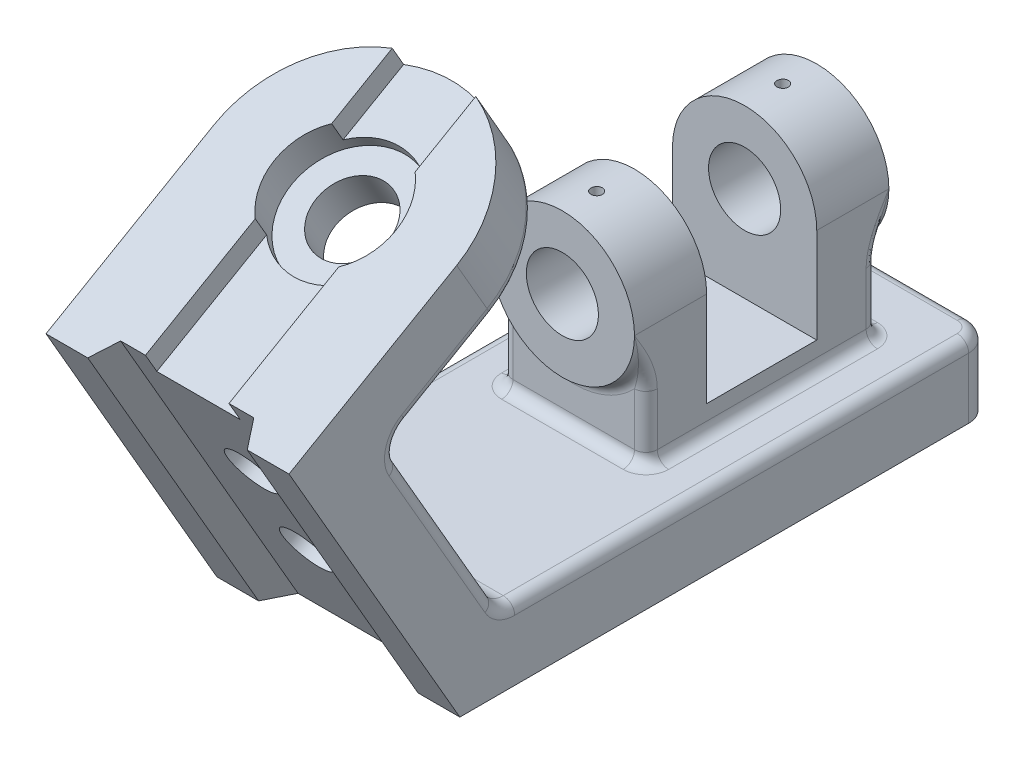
ISO-10303-21;
HEADER;
FILE_DESCRIPTION(('STEP AP214'),'2;1');
FILE_NAME('part.step','',(''),(''),'','','');
FILE_SCHEMA(('AUTOMOTIVE_DESIGN { 1 0 10303 214 1 1 1 1 }'));
ENDSEC;
DATA;
#1=APPLICATION_CONTEXT('core data for automotive mechanical design processes');
#2=APPLICATION_PROTOCOL_DEFINITION('international standard','automotive_design',2000,#1);
#3=PRODUCT_CONTEXT('',#1,'mechanical');
#4=PRODUCT('Part','Part','',(#3));
#5=PRODUCT_RELATED_PRODUCT_CATEGORY('part','',(#4));
#6=PRODUCT_DEFINITION_FORMATION('','',#4);
#7=PRODUCT_DEFINITION_CONTEXT('part definition',#1,'design');
#8=PRODUCT_DEFINITION('design','',#6,#7);
#9=PRODUCT_DEFINITION_SHAPE('','',#8);
#10=(LENGTH_UNIT() NAMED_UNIT(*) SI_UNIT(.MILLI.,.METRE.));
#11=(NAMED_UNIT(*) PLANE_ANGLE_UNIT() SI_UNIT($,.RADIAN.));
#12=(NAMED_UNIT(*) SI_UNIT($,.STERADIAN.) SOLID_ANGLE_UNIT());
#13=UNCERTAINTY_MEASURE_WITH_UNIT(LENGTH_MEASURE(1.E-05),#10,'distance_accuracy_value','');
#14=(GEOMETRIC_REPRESENTATION_CONTEXT(3) GLOBAL_UNCERTAINTY_ASSIGNED_CONTEXT((#13)) GLOBAL_UNIT_ASSIGNED_CONTEXT((#10,
#11,#12)) REPRESENTATION_CONTEXT('',''));
#15=CARTESIAN_POINT('',(0.,0.,0.));
#16=DIRECTION('',(0.,0.,1.));
#17=DIRECTION('',(1.,0.,0.));
#18=AXIS2_PLACEMENT_3D('',#15,#16,#17);
#19=CARTESIAN_POINT('',(0.,51.,-107.));
#20=DIRECTION('',(0.,0.,-1.));
#21=DIRECTION('',(-1.,0.,0.));
#22=AXIS2_PLACEMENT_3D('',#19,#20,#21);
#23=CYLINDRICAL_SURFACE('',#22,19.);
#24=CARTESIAN_POINT('',(0.,51.,-126.));
#25=DIRECTION('',(0.,0.,-1.));
#26=DIRECTION('',(0.,1.,0.));
#27=AXIS2_PLACEMENT_3D('',#24,#25,#26);
#28=CIRCLE('',#27,19.);
#29=CARTESIAN_POINT('',(-19.,51.,-126.));
#30=VERTEX_POINT('',#29);
#31=CARTESIAN_POINT('',(19.,51.,-126.));
#32=VERTEX_POINT('',#31);
#33=EDGE_CURVE('E1062',#30,#32,#28,.T.);
#34=ORIENTED_EDGE('',*,*,#33,.F.);
#35=DIRECTION('',(0.,0.,1.));
#36=VECTOR('',#35,1.);
#37=CARTESIAN_POINT('',(-19.,51.,-107.));
#38=LINE('',#37,#36);
#39=CARTESIAN_POINT('',(-19.,51.,-107.));
#40=VERTEX_POINT('',#39);
#41=EDGE_CURVE('E525',#40,#30,#38,.F.);
#42=ORIENTED_EDGE('',*,*,#41,.F.);
#43=CARTESIAN_POINT('',(0.,51.,-107.));
#44=DIRECTION('',(0.,0.,-1.));
#45=DIRECTION('',(-1.,0.,0.));
#46=AXIS2_PLACEMENT_3D('',#43,#44,#45);
#47=CIRCLE('',#46,19.);
#48=CARTESIAN_POINT('',(19.,51.,-107.));
#49=VERTEX_POINT('',#48);
#50=EDGE_CURVE('E529',#49,#40,#47,.F.);
#51=ORIENTED_EDGE('',*,*,#50,.F.);
#52=DIRECTION('',(0.,0.,-1.));
#53=VECTOR('',#52,1.);
#54=CARTESIAN_POINT('',(19.,51.,-154.486469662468));
#55=LINE('',#54,#53);
#56=EDGE_CURVE('E358',#32,#49,#55,.F.);
#57=ORIENTED_EDGE('',*,*,#56,.F.);
#58=EDGE_LOOP('',(#34,#42,#51,#57));
#59=FACE_BOUND('',#58,.T.);
#60=CARTESIAN_POINT('',(0.,70.,-118.5));
#61=CARTESIAN_POINT('',(0.0841151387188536,69.999999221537,-118.499996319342));
#62=CARTESIAN_POINT('',(0.168287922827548,69.9994354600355,-118.492900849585));
#63=CARTESIAN_POINT('',(0.334305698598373,69.997240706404,-118.464699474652));
#64=CARTESIAN_POINT('',(0.416147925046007,69.9956084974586,-118.443577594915));
#65=CARTESIAN_POINT('',(0.575076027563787,69.9914613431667,-118.387937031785));
#66=CARTESIAN_POINT('',(0.65216452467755,69.9889468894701,-118.353425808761));
#67=CARTESIAN_POINT('',(0.799435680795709,69.9833174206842,-118.271999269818));
#68=CARTESIAN_POINT('',(0.869619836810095,69.9802025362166,-118.225086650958));
#69=CARTESIAN_POINT('',(1.00127051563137,69.9737138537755,-118.120072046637));
#70=CARTESIAN_POINT('',(1.06271896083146,69.9703395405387,-118.061947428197));
#71=CARTESIAN_POINT('',(1.17499890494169,69.9637166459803,-117.93620640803));
#72=CARTESIAN_POINT('',(1.22582994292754,69.960468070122,-117.868589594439));
#73=CARTESIAN_POINT('',(1.31549242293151,69.9544588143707,-117.725675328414));
#74=CARTESIAN_POINT('',(1.3543081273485,69.951698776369,-117.650367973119));
#75=CARTESIAN_POINT('',(1.41873755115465,69.9469848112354,-117.49427942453));
#76=CARTESIAN_POINT('',(1.4443514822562,69.9450308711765,-117.413498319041));
#77=CARTESIAN_POINT('',(1.48159822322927,69.9421545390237,-117.24893533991));
#78=CARTESIAN_POINT('',(1.49326029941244,69.9412299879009,-117.165160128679));
#79=CARTESIAN_POINT('',(1.50236268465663,69.9405102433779,-116.996836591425));
#80=CARTESIAN_POINT('',(1.49980323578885,69.9407150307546,-116.912288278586));
#81=CARTESIAN_POINT('',(1.48055943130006,69.9422288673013,-116.745018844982));
#82=CARTESIAN_POINT('',(1.46390684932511,69.9435354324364,-116.662294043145));
#83=CARTESIAN_POINT('',(1.41699882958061,69.9471017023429,-116.500817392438));
#84=CARTESIAN_POINT('',(1.38674327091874,69.9493614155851,-116.422065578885));
#85=CARTESIAN_POINT('',(1.31345245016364,69.9545822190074,-116.27066892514));
#86=CARTESIAN_POINT('',(1.2704028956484,69.9575440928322,-116.198031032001));
#87=CARTESIAN_POINT('',(1.17275641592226,69.9638347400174,-116.061000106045));
#88=CARTESIAN_POINT('',(1.11815928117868,69.967163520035,-115.99660722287));
#89=CARTESIAN_POINT('',(0.998789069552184,69.9738239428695,-115.87770942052));
#90=CARTESIAN_POINT('',(0.933988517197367,69.9771555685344,-115.823232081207));
#91=CARTESIAN_POINT('',(0.796146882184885,69.9834375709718,-115.725924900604));
#92=CARTESIAN_POINT('',(0.723105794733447,69.9863879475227,-115.683095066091));
#93=CARTESIAN_POINT('',(0.570838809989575,69.991575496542,-115.610300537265));
#94=CARTESIAN_POINT('',(0.491612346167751,69.9938126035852,-115.580337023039));
#95=CARTESIAN_POINT('',(0.329231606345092,69.9973207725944,-115.534144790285));
#96=CARTESIAN_POINT('',(0.246077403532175,69.9985918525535,-115.51791581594));
#97=CARTESIAN_POINT('',(0.0784407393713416,70.0000224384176,-115.499687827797));
#98=CARTESIAN_POINT('',(-0.00603755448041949,70.0001849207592,-115.497650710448));
#99=CARTESIAN_POINT('',(-0.174134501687,69.9993879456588,-115.507764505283));
#100=CARTESIAN_POINT('',(-0.257753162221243,69.9984284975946,-115.519915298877));
#101=CARTESIAN_POINT('',(-0.421648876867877,69.9954975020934,-115.558028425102));
#102=CARTESIAN_POINT('',(-0.50193005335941,69.9935272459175,-115.583973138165));
#103=CARTESIAN_POINT('',(-0.656999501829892,69.9887960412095,-115.648919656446));
#104=CARTESIAN_POINT('',(-0.731787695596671,69.9860350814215,-115.687921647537));
#105=CARTESIAN_POINT('',(-0.873921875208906,69.9800247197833,-115.777971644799));
#106=CARTESIAN_POINT('',(-0.941251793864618,69.976774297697,-115.829044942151));
#107=CARTESIAN_POINT('',(-1.06639608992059,69.9701537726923,-115.941751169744));
#108=CARTESIAN_POINT('',(-1.1242103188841,69.9667836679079,-116.003384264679));
#109=CARTESIAN_POINT('',(-1.22881242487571,69.9602948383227,-116.135625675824));
#110=CARTESIAN_POINT('',(-1.27557547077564,69.9571766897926,-116.206253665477));
#111=CARTESIAN_POINT('',(-1.35657761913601,69.9515527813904,-116.354381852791));
#112=CARTESIAN_POINT('',(-1.39081683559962,69.9490470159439,-116.431881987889));
#113=CARTESIAN_POINT('',(-1.44575693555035,69.9449346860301,-116.591465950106));
#114=CARTESIAN_POINT('',(-1.46647311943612,69.9433271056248,-116.673544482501));
#115=CARTESIAN_POINT('',(-1.49382895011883,69.9411896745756,-116.840028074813));
#116=CARTESIAN_POINT('',(-1.50046883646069,69.9406598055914,-116.924433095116));
#117=CARTESIAN_POINT('',(-1.49948094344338,69.9407380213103,-117.092926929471));
#118=CARTESIAN_POINT('',(-1.49189218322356,69.9413429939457,-117.177015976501));
#119=CARTESIAN_POINT('',(-1.46274366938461,69.9436161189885,-117.34272143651));
#120=CARTESIAN_POINT('',(-1.44118389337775,69.9452842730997,-117.424337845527));
#121=CARTESIAN_POINT('',(-1.38471500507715,69.9494949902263,-117.582784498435));
#122=CARTESIAN_POINT('',(-1.34980648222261,69.9520375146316,-117.659614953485));
#123=CARTESIAN_POINT('',(-1.267635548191,69.9577105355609,-117.806330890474));
#124=CARTESIAN_POINT('',(-1.22037336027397,69.9608410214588,-117.876216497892));
#125=CARTESIAN_POINT('',(-1.11469031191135,69.9673474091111,-118.007258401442));
#126=CARTESIAN_POINT('',(-1.05624065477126,69.9707239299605,-118.068391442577));
#127=CARTESIAN_POINT('',(-0.929892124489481,69.977336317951,-118.180002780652));
#128=CARTESIAN_POINT('',(-0.861990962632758,69.9805721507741,-118.230478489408));
#129=CARTESIAN_POINT('',(-0.718548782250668,69.9865438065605,-118.319402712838));
#130=CARTESIAN_POINT('',(-0.642994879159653,69.989278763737,-118.357830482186));
#131=CARTESIAN_POINT('',(-0.486538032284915,69.9939300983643,-118.42140600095));
#132=CARTESIAN_POINT('',(-0.405641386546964,69.9958474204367,-118.446569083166));
#133=CARTESIAN_POINT('',(-0.270219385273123,69.998152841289,-118.47646148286));
#134=CARTESIAN_POINT('',(-0.216566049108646,69.9988423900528,-118.485276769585));
#135=CARTESIAN_POINT('',(-0.108616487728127,69.9997662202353,-118.497047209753));
#136=CARTESIAN_POINT('',(-0.0543202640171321,70.0000005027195,-118.500002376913));
#137=CARTESIAN_POINT('',(0.,70.,-118.5));
#138=B_SPLINE_CURVE_WITH_KNOTS('',3,(#60,#61,#62,#63,#64,#65,#66,#67,#68,#69,#70,#71,#72,#73,
#74,#75,#76,#77,#78,#79,#80,#81,#82,#83,#84,#85,#86,#87,#88,#89,#90,#91,#92,#93,#94,#95,#96,#97,
#98,#99,#100,#101,#102,#103,#104,#105,#106,#107,#108,#109,#110,#111,#112,#113,#114,#115,#116,
#117,#118,#119,#120,#121,#122,#123,#124,#125,#126,#127,#128,#129,#130,#131,#132,#133,#134,#135,
#136,#137),.UNSPECIFIED.,.T.,.F.,(4,2,2,2,2,2,2,2,2,2,2,2,2,2,2,2,2,2,2,2,2,2,2,2,2,2,2,2,2,2,2,
2,2,2,2,2,2,2,4),(0.,0.252147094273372,0.504581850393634,0.756876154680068,1.00911563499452,
1.26186972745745,1.51463479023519,1.7677295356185,2.02082022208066,2.27337907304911,
2.525933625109,2.77792029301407,3.02990920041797,3.28218067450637,3.53445672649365,
3.78742409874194,4.0403916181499,4.29338233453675,4.54636833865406,4.79867484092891,
5.05097923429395,5.30296211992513,5.55494859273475,5.80746776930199,6.05999088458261,
6.3130761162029,6.56615904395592,6.81895512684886,7.07174690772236,7.32384647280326,
7.57594644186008,7.82803528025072,8.08011956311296,8.33286165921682,8.58566506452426,
8.83890141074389,9.09184439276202,9.25467749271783,9.41751021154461),.UNSPECIFIED.);
#139=CARTESIAN_POINT('',(0.,70.,-118.5));
#140=VERTEX_POINT('',#139);
#141=EDGE_CURVE('E540',#140,#140,#138,.T.);
#142=ORIENTED_EDGE('',*,*,#141,.T.);
#143=EDGE_LOOP('',(#142));
#144=FACE_BOUND('',#143,.T.);
#145=ADVANCED_FACE('F35',(#59,#144),#23,.T.);
#146=CARTESIAN_POINT('',(0.,51.,-32.1299423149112));
#147=DIRECTION('',(0.,0.,-1.));
#148=DIRECTION('',(0.,1.,0.));
#149=AXIS2_PLACEMENT_3D('',#146,#147,#148);
#150=CYLINDRICAL_SURFACE('',#149,9.5);
#151=CARTESIAN_POINT('',(0.,51.,-107.));
#152=DIRECTION('',(0.,0.,-1.));
#153=DIRECTION('',(-1.,0.,0.));
#154=AXIS2_PLACEMENT_3D('',#151,#152,#153);
#155=CIRCLE('',#154,9.5);
#156=CARTESIAN_POINT('',(-9.5,51.,-107.));
#157=VERTEX_POINT('',#156);
#158=EDGE_CURVE('E1065',#157,#157,#155,.T.);
#159=ORIENTED_EDGE('',*,*,#158,.F.);
#160=EDGE_LOOP('',(#159));
#161=FACE_BOUND('',#160,.T.);
#162=CARTESIAN_POINT('',(0.,51.,-126.));
#163=DIRECTION('',(0.,0.,-1.));
#164=DIRECTION('',(0.,1.,0.));
#165=AXIS2_PLACEMENT_3D('',#162,#163,#164);
#166=CIRCLE('',#165,9.5);
#167=CARTESIAN_POINT('',(0.,60.5,-126.));
#168=VERTEX_POINT('',#167);
#169=EDGE_CURVE('E564',#168,#168,#166,.T.);
#170=ORIENTED_EDGE('',*,*,#169,.T.);
#171=EDGE_LOOP('',(#170));
#172=FACE_BOUND('',#171,.T.);
#173=CARTESIAN_POINT('',(0.,60.5,-115.5));
#174=CARTESIAN_POINT('',(-0.0836976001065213,60.4999986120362,-115.500003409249));
#175=CARTESIAN_POINT('',(-0.167442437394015,60.4988823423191,-115.507028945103));
#176=CARTESIAN_POINT('',(-0.332587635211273,60.4945367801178,-115.53493624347));
#177=CARTESIAN_POINT('',(-0.413985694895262,60.4913054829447,-115.555831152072));
#178=CARTESIAN_POINT('',(-0.57202376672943,60.4830926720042,-115.610834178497));
#179=CARTESIAN_POINT('',(-0.648667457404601,60.4781125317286,-115.644931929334));
#180=CARTESIAN_POINT('',(-0.795134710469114,60.4669510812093,-115.725346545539));
#181=CARTESIAN_POINT('',(-0.86495914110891,60.4607699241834,-115.77166185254));
#182=CARTESIAN_POINT('',(-0.996418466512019,60.4478332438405,-115.8756218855));
#183=CARTESIAN_POINT('',(-1.05798606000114,60.4410736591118,-115.933351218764));
#184=CARTESIAN_POINT('',(-1.17060304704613,60.4277734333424,-116.058318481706));
#185=CARTESIAN_POINT('',(-1.22165180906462,60.4212328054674,-116.125556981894));
#186=CARTESIAN_POINT('',(-1.31204764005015,60.4090716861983,-116.268090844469));
#187=CARTESIAN_POINT('',(-1.35132892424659,60.4034564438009,-116.343428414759));
#188=CARTESIAN_POINT('',(-1.41665421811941,60.3938377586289,-116.499735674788));
#189=CARTESIAN_POINT('',(-1.44269902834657,60.3898342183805,-116.580705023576));
#190=CARTESIAN_POINT('',(-1.4806016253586,60.3839324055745,-116.745266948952));
#191=CARTESIAN_POINT('',(-1.49257509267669,60.382016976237,-116.828832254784));
#192=CARTESIAN_POINT('',(-1.50235362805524,60.3804562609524,-116.996806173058));
#193=CARTESIAN_POINT('',(-1.50015959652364,60.3808108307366,-117.081214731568));
#194=CARTESIAN_POINT('',(-1.48175980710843,60.383734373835,-117.247657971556));
#195=CARTESIAN_POINT('',(-1.46568339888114,60.3862829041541,-117.329707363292));
#196=CARTESIAN_POINT('',(-1.4201779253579,60.3932752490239,-117.489929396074));
#197=CARTESIAN_POINT('',(-1.39074844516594,60.397719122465,-117.568101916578));
#198=CARTESIAN_POINT('',(-1.3192392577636,60.4080237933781,-117.718741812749));
#199=CARTESIAN_POINT('',(-1.27710525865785,60.4138906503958,-117.791182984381));
#200=CARTESIAN_POINT('',(-1.1814216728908,60.4263759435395,-117.92801605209));
#201=CARTESIAN_POINT('',(-1.12787125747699,60.4329944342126,-117.992407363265));
#202=CARTESIAN_POINT('',(-1.01016734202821,60.4463273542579,-118.112062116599));
#203=CARTESIAN_POINT('',(-0.945902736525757,60.4530420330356,-118.16721629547));
#204=CARTESIAN_POINT('',(-0.808972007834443,60.4657426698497,-118.265973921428));
#205=CARTESIAN_POINT('',(-0.736305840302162,60.4717286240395,-118.309577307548));
#206=CARTESIAN_POINT('',(-0.584536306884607,60.4823046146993,-118.38400321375));
#207=CARTESIAN_POINT('',(-0.50542845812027,60.4868936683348,-118.414816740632));
#208=CARTESIAN_POINT('',(-0.343072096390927,60.4941507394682,-118.462690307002));
#209=CARTESIAN_POINT('',(-0.259823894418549,60.496818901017,-118.479751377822));
#210=CARTESIAN_POINT('',(-0.0924923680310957,60.4999143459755,-118.499489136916));
#211=CARTESIAN_POINT('',(-0.00842716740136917,60.5003650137,-118.502315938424));
#212=CARTESIAN_POINT('',(0.158976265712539,60.4990385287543,-118.493904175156));
#213=CARTESIAN_POINT('',(0.242314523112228,60.4972614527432,-118.482666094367));
#214=CARTESIAN_POINT('',(0.405439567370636,60.4916936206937,-118.446568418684));
#215=CARTESIAN_POINT('',(0.485243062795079,60.487913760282,-118.421782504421));
#216=CARTESIAN_POINT('',(0.639561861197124,60.4787626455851,-118.359370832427));
#217=CARTESIAN_POINT('',(0.714076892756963,60.4733913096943,-118.321744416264));
#218=CARTESIAN_POINT('',(0.856359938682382,60.4615955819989,-118.23437150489));
#219=CARTESIAN_POINT('',(0.924069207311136,60.4551631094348,-118.184530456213));
#220=CARTESIAN_POINT('',(1.05021609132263,60.4419847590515,-118.074273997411));
#221=CARTESIAN_POINT('',(1.10865310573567,60.4352388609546,-118.013857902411));
#222=CARTESIAN_POINT('',(1.21514760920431,60.4221191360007,-117.883495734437));
#223=CARTESIAN_POINT('',(1.26310409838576,60.4157493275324,-117.813466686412));
#224=CARTESIAN_POINT('',(1.34657266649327,60.4041759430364,-117.666258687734));
#225=CARTESIAN_POINT('',(1.38208510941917,60.398972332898,-117.5890799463));
#226=CARTESIAN_POINT('',(1.43950349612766,60.3903501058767,-117.430055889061));
#227=CARTESIAN_POINT('',(1.46146126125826,60.3869246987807,-117.348229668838));
#228=CARTESIAN_POINT('',(1.49131110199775,60.3822291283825,-117.18199233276));
#229=CARTESIAN_POINT('',(1.49920426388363,60.3809587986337,-117.097581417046));
#230=CARTESIAN_POINT('',(1.5006729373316,60.3807238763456,-116.929578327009));
#231=CARTESIAN_POINT('',(1.49440732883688,60.3817336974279,-116.84598753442));
#232=CARTESIAN_POINT('',(1.46807821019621,60.3858894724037,-116.681064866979));
#233=CARTESIAN_POINT('',(1.44801473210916,60.389035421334,-116.599732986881));
#234=CARTESIAN_POINT('',(1.39471776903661,60.3970996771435,-116.441688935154));
#235=CARTESIAN_POINT('',(1.36149658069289,60.4020163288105,-116.364972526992));
#236=CARTESIAN_POINT('',(1.28284324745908,60.4130698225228,-116.218176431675));
#237=CARTESIAN_POINT('',(1.23741059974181,60.4192067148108,-116.148097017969));
#238=CARTESIAN_POINT('',(1.13505145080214,60.4320909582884,-116.015759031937));
#239=CARTESIAN_POINT('',(1.07800762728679,60.4388441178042,-115.953591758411));
#240=CARTESIAN_POINT('',(0.954293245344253,60.452152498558,-115.839656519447));
#241=CARTESIAN_POINT('',(0.887620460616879,60.4587076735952,-115.787890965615));
#242=CARTESIAN_POINT('',(0.746056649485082,60.4709278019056,-115.69594143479));
#243=CARTESIAN_POINT('',(0.671117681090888,60.4765870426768,-115.655830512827));
#244=CARTESIAN_POINT('',(0.515509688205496,60.4863218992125,-115.588826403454));
#245=CARTESIAN_POINT('',(0.434846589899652,60.4903991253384,-115.561919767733));
#246=CARTESIAN_POINT('',(0.294869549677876,60.4955986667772,-115.528070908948));
#247=CARTESIAN_POINT('',(0.236411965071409,60.4972405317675,-115.517560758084));
#248=CARTESIAN_POINT('',(0.118644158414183,60.4994416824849,-115.503524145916));
#249=CARTESIAN_POINT('',(0.0593339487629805,60.5000009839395,-115.499997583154));
#250=CARTESIAN_POINT('',(0.,60.5,-115.5));
#251=B_SPLINE_CURVE_WITH_KNOTS('',3,(#173,#174,#175,#176,#177,#178,#179,#180,#181,#182,#183,
#184,#185,#186,#187,#188,#189,#190,#191,#192,#193,#194,#195,#196,#197,#198,#199,#200,#201,#202,
#203,#204,#205,#206,#207,#208,#209,#210,#211,#212,#213,#214,#215,#216,#217,#218,#219,#220,#221,
#222,#223,#224,#225,#226,#227,#228,#229,#230,#231,#232,#233,#234,#235,#236,#237,#238,#239,#240,
#241,#242,#243,#244,#245,#246,#247,#248,#249,#250),.UNSPECIFIED.,.T.,.F.,(4,2,2,2,2,2,2,2,2,2,2,
2,2,2,2,2,2,2,2,2,2,2,2,2,2,2,2,2,2,2,2,2,2,2,2,2,2,2,4),(0.,0.250875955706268,
0.501990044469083,0.752907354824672,1.00379267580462,1.25661257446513,1.50944764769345,
1.76367086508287,2.0178787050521,2.26998174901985,2.52206877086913,2.7718319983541,
3.02160298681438,3.27245685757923,3.52332894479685,3.77698595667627,4.03064430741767,
4.28448071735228,4.53829808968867,4.78943303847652,5.04055934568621,5.29033328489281,
5.54012003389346,5.7919050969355,6.04370647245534,6.29783677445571,6.55195964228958,
6.80510484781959,7.0582305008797,7.30852987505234,7.55882866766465,7.80889409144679,
8.05896981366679,8.31171040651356,8.56450952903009,8.81886068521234,9.07295224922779,
9.25080295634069,9.42865107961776),.UNSPECIFIED.);
#252=CARTESIAN_POINT('',(0.,60.5,-115.5));
#253=VERTEX_POINT('',#252);
#254=EDGE_CURVE('E541',#253,#253,#251,.T.);
#255=ORIENTED_EDGE('',*,*,#254,.F.);
#256=EDGE_LOOP('',(#255));
#257=FACE_BOUND('',#256,.T.);
#258=ADVANCED_FACE('F573',(#161,#172,#257),#150,.F.);
#259=CARTESIAN_POINT('',(0.,51.,-78.));
#260=DIRECTION('',(0.,0.,-1.));
#261=DIRECTION('',(-1.,0.,0.));
#262=AXIS2_PLACEMENT_3D('',#259,#260,#261);
#263=CYLINDRICAL_SURFACE('',#262,19.);
#264=CARTESIAN_POINT('',(0.,51.,-59.));
#265=DIRECTION('',(0.,0.,1.));
#266=DIRECTION('',(1.,0.,0.));
#267=AXIS2_PLACEMENT_3D('',#264,#265,#266);
#268=CIRCLE('',#267,19.);
#269=CARTESIAN_POINT('',(19.,51.,-59.));
#270=VERTEX_POINT('',#269);
#271=CARTESIAN_POINT('',(-19.,51.,-59.));
#272=VERTEX_POINT('',#271);
#273=EDGE_CURVE('E383',#270,#272,#268,.T.);
#274=ORIENTED_EDGE('',*,*,#273,.F.);
#275=DIRECTION('',(0.,0.,-1.));
#276=VECTOR('',#275,1.);
#277=CARTESIAN_POINT('',(19.,51.,-154.486469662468));
#278=LINE('',#277,#276);
#279=CARTESIAN_POINT('',(19.,51.,-78.));
#280=VERTEX_POINT('',#279);
#281=EDGE_CURVE('E513',#280,#270,#278,.F.);
#282=ORIENTED_EDGE('',*,*,#281,.F.);
#283=CARTESIAN_POINT('',(0.,51.,-78.));
#284=DIRECTION('',(0.,0.,-1.));
#285=DIRECTION('',(-1.,0.,0.));
#286=AXIS2_PLACEMENT_3D('',#283,#284,#285);
#287=CIRCLE('',#286,19.);
#288=CARTESIAN_POINT('',(-19.,51.,-78.));
#289=VERTEX_POINT('',#288);
#290=EDGE_CURVE('E523',#289,#280,#287,.T.);
#291=ORIENTED_EDGE('',*,*,#290,.F.);
#292=DIRECTION('',(0.,0.,1.));
#293=VECTOR('',#292,1.);
#294=CARTESIAN_POINT('',(-19.,51.,-78.));
#295=LINE('',#294,#293);
#296=EDGE_CURVE('E520',#272,#289,#295,.F.);
#297=ORIENTED_EDGE('',*,*,#296,.F.);
#298=EDGE_LOOP('',(#274,#282,#291,#297));
#299=FACE_BOUND('',#298,.T.);
#300=CARTESIAN_POINT('',(0.,70.,-69.5));
#301=CARTESIAN_POINT('',(0.0841151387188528,69.999999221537,-69.4999963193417));
#302=CARTESIAN_POINT('',(0.168287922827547,69.9994354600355,-69.4929008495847));
#303=CARTESIAN_POINT('',(0.334305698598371,69.997240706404,-69.4646994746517));
#304=CARTESIAN_POINT('',(0.416147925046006,69.9956084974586,-69.4435775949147));
#305=CARTESIAN_POINT('',(0.575076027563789,69.9914613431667,-69.3879370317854));
#306=CARTESIAN_POINT('',(0.652164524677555,69.9889468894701,-69.3534258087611));
#307=CARTESIAN_POINT('',(0.799435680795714,69.9833174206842,-69.2719992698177));
#308=CARTESIAN_POINT('',(0.869619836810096,69.9802025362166,-69.2250866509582));
#309=CARTESIAN_POINT('',(1.00127051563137,69.9737138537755,-69.1200720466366));
#310=CARTESIAN_POINT('',(1.06271896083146,69.9703395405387,-69.0619474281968));
#311=CARTESIAN_POINT('',(1.1749989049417,69.9637166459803,-68.9362064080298));
#312=CARTESIAN_POINT('',(1.22582994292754,69.960468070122,-68.8685895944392));
#313=CARTESIAN_POINT('',(1.31549242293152,69.9544588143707,-68.7256753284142));
#314=CARTESIAN_POINT('',(1.3543081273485,69.951698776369,-68.6503679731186));
#315=CARTESIAN_POINT('',(1.41873755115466,69.9469848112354,-68.4942794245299));
#316=CARTESIAN_POINT('',(1.4443514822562,69.9450308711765,-68.4134983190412));
#317=CARTESIAN_POINT('',(1.48159822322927,69.9421545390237,-68.2489353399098));
#318=CARTESIAN_POINT('',(1.49326029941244,69.9412299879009,-68.1651601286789));
#319=CARTESIAN_POINT('',(1.50236268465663,69.9405102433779,-67.996836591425));
#320=CARTESIAN_POINT('',(1.49980323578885,69.9407150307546,-67.9122882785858));
#321=CARTESIAN_POINT('',(1.48055943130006,69.9422288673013,-67.7450188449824));
#322=CARTESIAN_POINT('',(1.46390684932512,69.9435354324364,-67.6622940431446));
#323=CARTESIAN_POINT('',(1.41699882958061,69.9471017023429,-67.5008173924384));
#324=CARTESIAN_POINT('',(1.38674327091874,69.9493614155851,-67.4220655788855));
#325=CARTESIAN_POINT('',(1.31345245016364,69.9545822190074,-67.2706689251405));
#326=CARTESIAN_POINT('',(1.2704028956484,69.9575440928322,-67.1980310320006));
#327=CARTESIAN_POINT('',(1.17275641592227,69.9638347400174,-67.0610001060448));
#328=CARTESIAN_POINT('',(1.11815928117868,69.967163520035,-66.9966072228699));
#329=CARTESIAN_POINT('',(0.998789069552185,69.9738239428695,-66.8777094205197));
#330=CARTESIAN_POINT('',(0.933988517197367,69.9771555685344,-66.8232320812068));
#331=CARTESIAN_POINT('',(0.796146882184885,69.9834375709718,-66.7259249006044));
#332=CARTESIAN_POINT('',(0.723105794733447,69.9863879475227,-66.6830950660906));
#333=CARTESIAN_POINT('',(0.570838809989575,69.991575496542,-66.6103005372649));
#334=CARTESIAN_POINT('',(0.491612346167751,69.9938126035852,-66.5803370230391));
#335=CARTESIAN_POINT('',(0.329231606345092,69.9973207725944,-66.5341447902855));
#336=CARTESIAN_POINT('',(0.246077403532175,69.9985918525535,-66.5179158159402));
#337=CARTESIAN_POINT('',(0.0784407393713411,70.0000224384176,-66.4996878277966));
#338=CARTESIAN_POINT('',(-0.00603755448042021,70.0001849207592,-66.4976507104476));
#339=CARTESIAN_POINT('',(-0.174134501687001,69.9993879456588,-66.507764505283));
#340=CARTESIAN_POINT('',(-0.257753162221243,69.9984284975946,-66.5199152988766));
#341=CARTESIAN_POINT('',(-0.421648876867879,69.9954975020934,-66.5580284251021));
#342=CARTESIAN_POINT('',(-0.501930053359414,69.9935272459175,-66.5839731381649));
#343=CARTESIAN_POINT('',(-0.656999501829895,69.9887960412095,-66.6489196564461));
#344=CARTESIAN_POINT('',(-0.731787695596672,69.9860350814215,-66.6879216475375));
#345=CARTESIAN_POINT('',(-0.873921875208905,69.9800247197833,-66.7779716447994));
#346=CARTESIAN_POINT('',(-0.941251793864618,69.976774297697,-66.8290449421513));
#347=CARTESIAN_POINT('',(-1.06639608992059,69.9701537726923,-66.9417511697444));
#348=CARTESIAN_POINT('',(-1.1242103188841,69.9667836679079,-67.0033842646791));
#349=CARTESIAN_POINT('',(-1.22881242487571,69.9602948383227,-67.1356256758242));
#350=CARTESIAN_POINT('',(-1.27557547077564,69.9571766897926,-67.2062536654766));
#351=CARTESIAN_POINT('',(-1.35657761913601,69.9515527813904,-67.3543818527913));
#352=CARTESIAN_POINT('',(-1.39081683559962,69.9490470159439,-67.4318819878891));
#353=CARTESIAN_POINT('',(-1.44575693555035,69.9449346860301,-67.5914659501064));
#354=CARTESIAN_POINT('',(-1.46647311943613,69.9433271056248,-67.6735444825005));
#355=CARTESIAN_POINT('',(-1.49382895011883,69.9411896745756,-67.8400280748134));
#356=CARTESIAN_POINT('',(-1.50046883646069,69.9406598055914,-67.9244330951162));
#357=CARTESIAN_POINT('',(-1.49948094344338,69.9407380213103,-68.0929269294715));
#358=CARTESIAN_POINT('',(-1.49189218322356,69.9413429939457,-68.1770159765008));
#359=CARTESIAN_POINT('',(-1.46274366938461,69.9436161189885,-68.3427214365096));
#360=CARTESIAN_POINT('',(-1.44118389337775,69.9452842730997,-68.4243378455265));
#361=CARTESIAN_POINT('',(-1.38471500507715,69.9494949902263,-68.5827844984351));
#362=CARTESIAN_POINT('',(-1.34980648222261,69.9520375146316,-68.6596149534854));
#363=CARTESIAN_POINT('',(-1.267635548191,69.9577105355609,-68.8063308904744));
#364=CARTESIAN_POINT('',(-1.22037336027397,69.9608410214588,-68.8762164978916));
#365=CARTESIAN_POINT('',(-1.11469031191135,69.9673474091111,-69.007258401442));
#366=CARTESIAN_POINT('',(-1.05624065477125,69.9707239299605,-69.0683914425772));
#367=CARTESIAN_POINT('',(-0.929892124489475,69.977336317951,-69.1800027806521));
#368=CARTESIAN_POINT('',(-0.861990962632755,69.9805721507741,-69.2304784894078));
#369=CARTESIAN_POINT('',(-0.718548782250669,69.9865438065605,-69.3194027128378));
#370=CARTESIAN_POINT('',(-0.642994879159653,69.989278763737,-69.3578304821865));
#371=CARTESIAN_POINT('',(-0.486538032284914,69.9939300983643,-69.4214060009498));
#372=CARTESIAN_POINT('',(-0.405641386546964,69.9958474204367,-69.4465690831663));
#373=CARTESIAN_POINT('',(-0.270219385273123,69.998152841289,-69.4764614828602));
#374=CARTESIAN_POINT('',(-0.216566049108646,69.9988423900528,-69.4852767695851));
#375=CARTESIAN_POINT('',(-0.108616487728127,69.9997662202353,-69.4970472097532));
#376=CARTESIAN_POINT('',(-0.0543202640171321,70.0000005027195,-69.5000023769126));
#377=CARTESIAN_POINT('',(0.,70.,-69.5));
#378=B_SPLINE_CURVE_WITH_KNOTS('',3,(#300,#301,#302,#303,#304,#305,#306,#307,#308,#309,#310,
#311,#312,#313,#314,#315,#316,#317,#318,#319,#320,#321,#322,#323,#324,#325,#326,#327,#328,#329,
#330,#331,#332,#333,#334,#335,#336,#337,#338,#339,#340,#341,#342,#343,#344,#345,#346,#347,#348,
#349,#350,#351,#352,#353,#354,#355,#356,#357,#358,#359,#360,#361,#362,#363,#364,#365,#366,#367,
#368,#369,#370,#371,#372,#373,#374,#375,#376,#377),.UNSPECIFIED.,.T.,.F.,(4,2,2,2,2,2,2,2,2,2,2,
2,2,2,2,2,2,2,2,2,2,2,2,2,2,2,2,2,2,2,2,2,2,2,2,2,2,2,4),(0.,0.252147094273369,
0.504581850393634,0.756876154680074,1.00911563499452,1.26186972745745,1.51463479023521,
1.76772953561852,2.02082022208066,2.27337907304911,2.525933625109,2.77792029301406,
3.02990920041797,3.28218067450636,3.53445672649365,3.78742409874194,4.0403916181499,
4.29338233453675,4.54636833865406,4.79867484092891,5.05097923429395,5.30296211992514,
5.55494859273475,5.80746776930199,6.05999088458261,6.3130761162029,6.56615904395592,
6.81895512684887,7.07174690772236,7.32384647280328,7.57594644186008,7.82803528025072,
8.08011956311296,8.33286165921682,8.58566506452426,8.83890141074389,9.09184439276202,
9.25467749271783,9.41751021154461),.UNSPECIFIED.);
#379=CARTESIAN_POINT('',(0.,70.,-69.5));
#380=VERTEX_POINT('',#379);
#381=EDGE_CURVE('E539',#380,#380,#378,.T.);
#382=ORIENTED_EDGE('',*,*,#381,.T.);
#383=EDGE_LOOP('',(#382));
#384=FACE_BOUND('',#383,.T.);
#385=ADVANCED_FACE('F569',(#299,#384),#263,.T.);
#386=CARTESIAN_POINT('',(0.,51.,-59.));
#387=DIRECTION('',(0.,0.,1.));
#388=DIRECTION('',(1.,0.,0.));
#389=AXIS2_PLACEMENT_3D('',#386,#387,#388);
#390=CIRCLE('',#389,9.5);
#391=CARTESIAN_POINT('',(9.5,51.,-59.));
#392=VERTEX_POINT('',#391);
#393=EDGE_CURVE('E1070',#392,#392,#390,.F.);
#394=ORIENTED_EDGE('',*,*,#393,.F.);
#395=EDGE_LOOP('',(#394));
#396=FACE_BOUND('',#395,.T.);
#397=CARTESIAN_POINT('',(0.,51.,-78.));
#398=DIRECTION('',(0.,0.,-1.));
#399=DIRECTION('',(-1.,0.,0.));
#400=AXIS2_PLACEMENT_3D('',#397,#398,#399);
#401=CIRCLE('',#400,9.5);
#402=CARTESIAN_POINT('',(-9.5,51.,-78.));
#403=VERTEX_POINT('',#402);
#404=EDGE_CURVE('E1068',#403,#403,#401,.T.);
#405=ORIENTED_EDGE('',*,*,#404,.T.);
#406=EDGE_LOOP('',(#405));
#407=FACE_BOUND('',#406,.T.);
#408=CARTESIAN_POINT('',(0.,60.5,-66.5));
#409=CARTESIAN_POINT('',(-0.0836976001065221,60.4999986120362,-66.5000034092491));
#410=CARTESIAN_POINT('',(-0.167442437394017,60.4988823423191,-66.5070289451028));
#411=CARTESIAN_POINT('',(-0.332587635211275,60.4945367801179,-66.5349362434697));
#412=CARTESIAN_POINT('',(-0.413985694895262,60.4913054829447,-66.5558311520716));
#413=CARTESIAN_POINT('',(-0.57202376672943,60.4830926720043,-66.610834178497));
#414=CARTESIAN_POINT('',(-0.648667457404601,60.4781125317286,-66.6449319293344));
#415=CARTESIAN_POINT('',(-0.795134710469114,60.4669510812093,-66.7253465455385));
#416=CARTESIAN_POINT('',(-0.86495914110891,60.4607699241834,-66.7716618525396));
#417=CARTESIAN_POINT('',(-0.996418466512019,60.4478332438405,-66.8756218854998));
#418=CARTESIAN_POINT('',(-1.05798606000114,60.4410736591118,-66.9333512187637));
#419=CARTESIAN_POINT('',(-1.17060304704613,60.4277734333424,-67.0583184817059));
#420=CARTESIAN_POINT('',(-1.22165180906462,60.4212328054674,-67.1255569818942));
#421=CARTESIAN_POINT('',(-1.31204764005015,60.4090716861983,-67.2680908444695));
#422=CARTESIAN_POINT('',(-1.35132892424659,60.4034564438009,-67.3434284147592));
#423=CARTESIAN_POINT('',(-1.41665421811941,60.3938377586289,-67.499735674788));
#424=CARTESIAN_POINT('',(-1.44269902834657,60.3898342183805,-67.5807050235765));
#425=CARTESIAN_POINT('',(-1.4806016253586,60.3839324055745,-67.7452669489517));
#426=CARTESIAN_POINT('',(-1.49257509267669,60.382016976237,-67.8288322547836));
#427=CARTESIAN_POINT('',(-1.50235362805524,60.3804562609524,-67.9968061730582));
#428=CARTESIAN_POINT('',(-1.50015959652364,60.3808108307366,-68.0812147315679));
#429=CARTESIAN_POINT('',(-1.48175980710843,60.383734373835,-68.2476579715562));
#430=CARTESIAN_POINT('',(-1.46568339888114,60.3862829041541,-68.3297073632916));
#431=CARTESIAN_POINT('',(-1.4201779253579,60.3932752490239,-68.4899293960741));
#432=CARTESIAN_POINT('',(-1.39074844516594,60.397719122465,-68.5681019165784));
#433=CARTESIAN_POINT('',(-1.3192392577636,60.4080237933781,-68.7187418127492));
#434=CARTESIAN_POINT('',(-1.27710525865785,60.4138906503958,-68.7911829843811));
#435=CARTESIAN_POINT('',(-1.1814216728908,60.4263759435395,-68.9280160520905));
#436=CARTESIAN_POINT('',(-1.12787125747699,60.4329944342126,-68.9924073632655));
#437=CARTESIAN_POINT('',(-1.01016734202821,60.4463273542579,-69.1120621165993));
#438=CARTESIAN_POINT('',(-0.945902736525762,60.4530420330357,-69.1672162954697));
#439=CARTESIAN_POINT('',(-0.808972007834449,60.4657426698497,-69.2659739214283));
#440=CARTESIAN_POINT('',(-0.736305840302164,60.4717286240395,-69.3095773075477));
#441=CARTESIAN_POINT('',(-0.584536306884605,60.4823046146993,-69.3840032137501));
#442=CARTESIAN_POINT('',(-0.505428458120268,60.4868936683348,-69.4148167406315));
#443=CARTESIAN_POINT('',(-0.343072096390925,60.4941507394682,-69.4626903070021));
#444=CARTESIAN_POINT('',(-0.259823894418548,60.4968189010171,-69.4797513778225));
#445=CARTESIAN_POINT('',(-0.092492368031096,60.4999143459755,-69.4994891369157));
#446=CARTESIAN_POINT('',(-0.00842716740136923,60.5003650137,-69.5023159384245));
#447=CARTESIAN_POINT('',(0.158976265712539,60.4990385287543,-69.4939041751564));
#448=CARTESIAN_POINT('',(0.242314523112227,60.4972614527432,-69.4826660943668));
#449=CARTESIAN_POINT('',(0.405439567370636,60.4916936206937,-69.4465684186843));
#450=CARTESIAN_POINT('',(0.485243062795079,60.487913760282,-69.4217825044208));
#451=CARTESIAN_POINT('',(0.639561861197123,60.4787626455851,-69.359370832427));
#452=CARTESIAN_POINT('',(0.714076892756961,60.4733913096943,-69.3217444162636));
#453=CARTESIAN_POINT('',(0.856359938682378,60.4615955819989,-69.2343715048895));
#454=CARTESIAN_POINT('',(0.924069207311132,60.4551631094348,-69.1845304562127));
#455=CARTESIAN_POINT('',(1.05021609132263,60.4419847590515,-69.074273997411));
#456=CARTESIAN_POINT('',(1.10865310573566,60.4352388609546,-69.0138579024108));
#457=CARTESIAN_POINT('',(1.21514760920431,60.4221191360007,-68.8834957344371));
#458=CARTESIAN_POINT('',(1.26310409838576,60.4157493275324,-68.813466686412));
#459=CARTESIAN_POINT('',(1.34657266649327,60.4041759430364,-68.6662586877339));
#460=CARTESIAN_POINT('',(1.38208510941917,60.398972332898,-68.5890799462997));
#461=CARTESIAN_POINT('',(1.43950349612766,60.3903501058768,-68.4300558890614));
#462=CARTESIAN_POINT('',(1.46146126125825,60.3869246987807,-68.3482296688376));
#463=CARTESIAN_POINT('',(1.49131110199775,60.3822291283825,-68.1819923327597));
#464=CARTESIAN_POINT('',(1.49920426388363,60.3809587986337,-68.0975814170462));
#465=CARTESIAN_POINT('',(1.5006729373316,60.3807238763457,-67.9295783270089));
#466=CARTESIAN_POINT('',(1.49440732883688,60.3817336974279,-67.8459875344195));
#467=CARTESIAN_POINT('',(1.46807821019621,60.3858894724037,-67.6810648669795));
#468=CARTESIAN_POINT('',(1.44801473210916,60.389035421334,-67.5997329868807));
#469=CARTESIAN_POINT('',(1.39471776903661,60.3970996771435,-67.4416889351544));
#470=CARTESIAN_POINT('',(1.36149658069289,60.4020163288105,-67.3649725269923));
#471=CARTESIAN_POINT('',(1.28284324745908,60.4130698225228,-67.2181764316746));
#472=CARTESIAN_POINT('',(1.23741059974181,60.4192067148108,-67.1480970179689));
#473=CARTESIAN_POINT('',(1.13505145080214,60.4320909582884,-67.0157590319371));
#474=CARTESIAN_POINT('',(1.0780076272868,60.4388441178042,-66.9535917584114));
#475=CARTESIAN_POINT('',(0.954293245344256,60.452152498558,-66.8396565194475));
#476=CARTESIAN_POINT('',(0.887620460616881,60.4587076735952,-66.787890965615));
#477=CARTESIAN_POINT('',(0.746056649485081,60.4709278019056,-66.6959414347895));
#478=CARTESIAN_POINT('',(0.671117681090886,60.4765870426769,-66.6558305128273));
#479=CARTESIAN_POINT('',(0.515509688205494,60.4863218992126,-66.5888264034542));
#480=CARTESIAN_POINT('',(0.43484658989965,60.4903991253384,-66.5619197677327));
#481=CARTESIAN_POINT('',(0.294869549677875,60.4955986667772,-66.5280709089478));
#482=CARTESIAN_POINT('',(0.236411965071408,60.4972405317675,-66.5175607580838));
#483=CARTESIAN_POINT('',(0.118644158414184,60.4994416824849,-66.5035241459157));
#484=CARTESIAN_POINT('',(0.0593339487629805,60.5000009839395,-66.499997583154));
#485=CARTESIAN_POINT('',(0.,60.5,-66.5));
#486=B_SPLINE_CURVE_WITH_KNOTS('',3,(#408,#409,#410,#411,#412,#413,#414,#415,#416,#417,#418,
#419,#420,#421,#422,#423,#424,#425,#426,#427,#428,#429,#430,#431,#432,#433,#434,#435,#436,#437,
#438,#439,#440,#441,#442,#443,#444,#445,#446,#447,#448,#449,#450,#451,#452,#453,#454,#455,#456,
#457,#458,#459,#460,#461,#462,#463,#464,#465,#466,#467,#468,#469,#470,#471,#472,#473,#474,#475,
#476,#477,#478,#479,#480,#481,#482,#483,#484,#485),.UNSPECIFIED.,.T.,.F.,(4,2,2,2,2,2,2,2,2,2,2,
2,2,2,2,2,2,2,2,2,2,2,2,2,2,2,2,2,2,2,2,2,2,2,2,2,2,2,4),(0.,0.25087595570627,0.501990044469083,
0.752907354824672,1.00379267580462,1.25661257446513,1.50944764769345,1.76367086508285,
2.0178787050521,2.26998174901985,2.52206877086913,2.77183199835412,3.02160298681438,
3.27245685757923,3.52332894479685,3.77698595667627,4.03064430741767,4.28448071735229,
4.53829808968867,4.78943303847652,5.04055934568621,5.29033328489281,5.54012003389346,
5.79190509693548,6.04370647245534,6.29783677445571,6.55195964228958,6.80510484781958,
7.0582305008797,7.30852987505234,7.55882866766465,7.80889409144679,8.05896981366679,
8.31171040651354,8.56450952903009,8.81886068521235,9.07295224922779,9.25080295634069,
9.42865107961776),.UNSPECIFIED.);
#487=CARTESIAN_POINT('',(0.,60.5,-66.5));
#488=VERTEX_POINT('',#487);
#489=EDGE_CURVE('E532',#488,#488,#486,.T.);
#490=ORIENTED_EDGE('',*,*,#489,.F.);
#491=EDGE_LOOP('',(#490));
#492=FACE_BOUND('',#491,.T.);
#493=ADVANCED_FACE('F546',(#396,#407,#492),#150,.F.);
#494=CARTESIAN_POINT('',(19.,44.5,-123.));
#495=DIRECTION('',(0.,0.,1.));
#496=DIRECTION('',(0.,-1.,0.));
#497=AXIS2_PLACEMENT_3D('',#494,#495,#496);
#498=PLANE('',#497);
#499=DIRECTION('',(0.,1.,0.));
#500=VECTOR('',#499,1.);
#501=CARTESIAN_POINT('',(16.,19.,-123.));
#502=LINE('',#501,#500);
#503=CARTESIAN_POINT('',(16.,35.9003311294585,-123.));
#504=VERTEX_POINT('',#503);
#505=CARTESIAN_POINT('',(16.,22.,-123.));
#506=VERTEX_POINT('',#505);
#507=EDGE_CURVE('E999',#504,#506,#502,.F.);
#508=ORIENTED_EDGE('',*,*,#507,.T.);
#509=DIRECTION('',(-1.,0.,0.));
#510=VECTOR('',#509,1.);
#511=CARTESIAN_POINT('',(19.,22.,-123.));
#512=LINE('',#511,#510);
#513=CARTESIAN_POINT('',(-16.,22.,-123.));
#514=VERTEX_POINT('',#513);
#515=EDGE_CURVE('E59',#506,#514,#512,.T.);
#516=ORIENTED_EDGE('',*,*,#515,.T.);
#517=DIRECTION('',(0.,1.,0.));
#518=VECTOR('',#517,1.);
#519=CARTESIAN_POINT('',(-16.,44.5,-123.));
#520=LINE('',#519,#518);
#521=CARTESIAN_POINT('',(-16.,35.9003311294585,-123.));
#522=VERTEX_POINT('',#521);
#523=EDGE_CURVE('E822',#514,#522,#520,.T.);
#524=ORIENTED_EDGE('',*,*,#523,.T.);
#525=CARTESIAN_POINT('',(0.,51.,-123.));
#526=DIRECTION('',(0.,0.,1.));
#527=DIRECTION('',(0.,-1.,0.));
#528=AXIS2_PLACEMENT_3D('',#525,#526,#527);
#529=CIRCLE('',#528,22.);
#530=EDGE_CURVE('E905',#522,#504,#529,.T.);
#531=ORIENTED_EDGE('',*,*,#530,.T.);
#532=EDGE_LOOP('',(#508,#516,#524,#531));
#533=FACE_BOUND('',#532,.T.);
#534=ADVANCED_FACE('F1006',(#533),#498,.F.);
#535=CARTESIAN_POINT('',(19.,44.5,-62.));
#536=DIRECTION('',(0.,0.,1.));
#537=DIRECTION('',(1.,0.,0.));
#538=AXIS2_PLACEMENT_3D('',#535,#536,#537);
#539=PLANE('',#538);
#540=DIRECTION('',(0.,1.,0.));
#541=VECTOR('',#540,1.);
#542=CARTESIAN_POINT('',(-16.,19.,-62.));
#543=LINE('',#542,#541);
#544=CARTESIAN_POINT('',(-16.,35.9003311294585,-62.));
#545=VERTEX_POINT('',#544);
#546=CARTESIAN_POINT('',(-16.,22.,-62.));
#547=VERTEX_POINT('',#546);
#548=EDGE_CURVE('E993',#545,#547,#543,.F.);
#549=ORIENTED_EDGE('',*,*,#548,.T.);
#550=DIRECTION('',(-1.,0.,0.));
#551=VECTOR('',#550,1.);
#552=CARTESIAN_POINT('',(16.,22.,-62.));
#553=LINE('',#552,#551);
#554=CARTESIAN_POINT('',(16.,22.,-62.));
#555=VERTEX_POINT('',#554);
#556=EDGE_CURVE('E801',#547,#555,#553,.F.);
#557=ORIENTED_EDGE('',*,*,#556,.T.);
#558=DIRECTION('',(0.,1.,0.));
#559=VECTOR('',#558,1.);
#560=CARTESIAN_POINT('',(16.,44.5,-62.));
#561=LINE('',#560,#559);
#562=CARTESIAN_POINT('',(16.,35.9003311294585,-62.));
#563=VERTEX_POINT('',#562);
#564=EDGE_CURVE('E991',#555,#563,#561,.T.);
#565=ORIENTED_EDGE('',*,*,#564,.T.);
#566=CARTESIAN_POINT('',(0.,51.,-62.));
#567=DIRECTION('',(0.,0.,1.));
#568=DIRECTION('',(1.,0.,0.));
#569=AXIS2_PLACEMENT_3D('',#566,#567,#568);
#570=CIRCLE('',#569,22.);
#571=EDGE_CURVE('E908',#563,#545,#570,.F.);
#572=ORIENTED_EDGE('',*,*,#571,.T.);
#573=EDGE_LOOP('',(#549,#557,#565,#572));
#574=FACE_BOUND('',#573,.T.);
#575=ADVANCED_FACE('F929',(#574),#539,.T.);
#576=CARTESIAN_POINT('',(32.,0.,0.));
#577=DIRECTION('',(0.,0.500000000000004,-0.866025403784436));
#578=DIRECTION('',(0.,0.866025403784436,0.500000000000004));
#579=AXIS2_PLACEMENT_3D('',#576,#577,#578);
#580=PLANE('',#579);
#581=DIRECTION('',(-1.,0.,0.));
#582=VECTOR('',#581,1.);
#583=CARTESIAN_POINT('',(32.,0.,0.));
#584=LINE('',#583,#582);
#585=CARTESIAN_POINT('',(-21.,0.,0.));
#586=VERTEX_POINT('',#585);
#587=CARTESIAN_POINT('',(-32.,0.,0.));
#588=VERTEX_POINT('',#587);
#589=EDGE_CURVE('E466',#586,#588,#584,.T.);
#590=ORIENTED_EDGE('',*,*,#589,.F.);
#591=DIRECTION('',(0.,0.866025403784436,0.500000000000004));
#592=VECTOR('',#591,1.);
#593=CARTESIAN_POINT('',(-21.,-60.621778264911,-35.0000000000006));
#594=LINE('',#593,#592);
#595=CARTESIAN_POINT('',(-21.,77.9422863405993,45.0000000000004));
#596=VERTEX_POINT('',#595);
#597=EDGE_CURVE('E402',#586,#596,#594,.T.);
#598=ORIENTED_EDGE('',*,*,#597,.T.);
#599=DIRECTION('',(-1.,0.,0.));
#600=VECTOR('',#599,1.);
#601=CARTESIAN_POINT('',(32.,77.9422863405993,45.0000000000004));
#602=LINE('',#601,#600);
#603=CARTESIAN_POINT('',(-32.,77.9422863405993,45.0000000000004));
#604=VERTEX_POINT('',#603);
#605=EDGE_CURVE('E477',#596,#604,#602,.T.);
#606=ORIENTED_EDGE('',*,*,#605,.T.);
#607=DIRECTION('',(0.,-0.866025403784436,-0.500000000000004));
#608=VECTOR('',#607,1.);
#609=CARTESIAN_POINT('',(-32.,0.,0.));
#610=LINE('',#609,#608);
#611=EDGE_CURVE('E462',#604,#588,#610,.T.);
#612=ORIENTED_EDGE('',*,*,#611,.T.);
#613=EDGE_LOOP('',(#590,#598,#606,#612));
#614=FACE_BOUND('',#613,.T.);
#615=ADVANCED_FACE('F1162',(#614),#580,.F.);
#616=CARTESIAN_POINT('',(32.,77.9422863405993,45.0000000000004));
#617=DIRECTION('',(0.,-0.866025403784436,-0.500000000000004));
#618=DIRECTION('',(0.,0.500000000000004,-0.866025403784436));
#619=AXIS2_PLACEMENT_3D('',#616,#617,#618);
#620=PLANE('',#619);
#621=DIRECTION('',(0.,0.500000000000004,-0.866025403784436));
#622=VECTOR('',#621,1.);
#623=CARTESIAN_POINT('',(11.,119.4422863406,-26.8801085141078));
#624=LINE('',#623,#622);
#625=CARTESIAN_POINT('',(11.,80.9422863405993,39.8038475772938));
#626=VERTEX_POINT('',#625);
#627=CARTESIAN_POINT('',(11.,97.6328113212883,10.8950103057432));
#628=VERTEX_POINT('',#627);
#629=EDGE_CURVE('E433',#626,#628,#624,.T.);
#630=ORIENTED_EDGE('',*,*,#629,.F.);
#631=DIRECTION('',(-1.,0.,0.));
#632=VECTOR('',#631,1.);
#633=CARTESIAN_POINT('',(-17.5358983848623,80.9422863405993,39.8038475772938));
#634=LINE('',#633,#632);
#635=CARTESIAN_POINT('',(17.5358983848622,80.9422863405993,39.8038475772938));
#636=VERTEX_POINT('',#635);
#637=EDGE_CURVE('E400',#636,#626,#634,.T.);
#638=ORIENTED_EDGE('',*,*,#637,.F.);
#639=DIRECTION('',(-0.500000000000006,0.433012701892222,-0.749999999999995));
#640=VECTOR('',#639,1.);
#641=CARTESIAN_POINT('',(21.,77.9422863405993,45.0000000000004));
#642=LINE('',#641,#640);
#643=CARTESIAN_POINT('',(21.,77.9422863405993,45.0000000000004));
#644=VERTEX_POINT('',#643);
#645=EDGE_CURVE('E396',#644,#636,#642,.T.);
#646=ORIENTED_EDGE('',*,*,#645,.F.);
#647=CARTESIAN_POINT('',(32.,77.9422863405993,45.0000000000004));
#648=VERTEX_POINT('',#647);
#649=EDGE_CURVE('E478',#648,#644,#602,.T.);
#650=ORIENTED_EDGE('',*,*,#649,.F.);
#651=DIRECTION('',(0.,-0.500000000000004,0.866025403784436));
#652=VECTOR('',#651,1.);
#653=CARTESIAN_POINT('',(32.,77.9422863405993,45.0000000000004));
#654=LINE('',#653,#652);
#655=CARTESIAN_POINT('',(32.,103.442286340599,0.832704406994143));
#656=VERTEX_POINT('',#655);
#657=EDGE_CURVE('E461',#656,#648,#654,.T.);
#658=ORIENTED_EDGE('',*,*,#657,.F.);
#659=CARTESIAN_POINT('',(0.,103.442286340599,0.832704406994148));
#660=DIRECTION('',(0.,-0.866025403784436,-0.500000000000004));
#661=DIRECTION('',(0.,0.500000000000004,-0.866025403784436));
#662=AXIS2_PLACEMENT_3D('',#659,#660,#661);
#663=CIRCLE('',#662,32.);
#664=CARTESIAN_POINT('',(11.,118.467265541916,-25.191322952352));
#665=VERTEX_POINT('',#664);
#666=EDGE_CURVE('E490',#656,#665,#663,.F.);
#667=ORIENTED_EDGE('',*,*,#666,.T.);
#668=CARTESIAN_POINT('',(11.,109.251761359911,-9.22960149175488));
#669=VERTEX_POINT('',#668);
#670=EDGE_CURVE('E425',#669,#665,#624,.T.);
#671=ORIENTED_EDGE('',*,*,#670,.F.);
#672=CARTESIAN_POINT('',(0.,103.442286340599,0.832704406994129));
#673=DIRECTION('',(0.,0.866025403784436,0.500000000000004));
#674=DIRECTION('',(0.,-0.500000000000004,0.866025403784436));
#675=AXIS2_PLACEMENT_3D('',#672,#673,#674);
#676=CIRCLE('',#675,16.);
#677=EDGE_CURVE('E451',#628,#669,#676,.T.);
#678=ORIENTED_EDGE('',*,*,#677,.F.);
#679=EDGE_LOOP('',(#630,#638,#646,#650,#658,#667,#671,#678));
#680=FACE_BOUND('',#679,.T.);
#681=ADVANCED_FACE('F1148',(#680),#620,.F.);
#682=CARTESIAN_POINT('',(0.,-35.1229612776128,-79.1679786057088));
#683=DIRECTION('',(0.,0.866025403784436,0.500000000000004));
#684=DIRECTION('',(0.,-0.500000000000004,0.866025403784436));
#685=AXIS2_PLACEMENT_3D('',#682,#683,#684);
#686=CYLINDRICAL_SURFACE('',#685,9.5);
#687=CARTESIAN_POINT('',(0.,86.9878036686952,-8.66729559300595));
#688=DIRECTION('',(0.,-0.866025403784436,-0.500000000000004));
#689=DIRECTION('',(0.,0.500000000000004,-0.866025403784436));
#690=AXIS2_PLACEMENT_3D('',#687,#688,#689);
#691=CIRCLE('',#690,9.5);
#692=CARTESIAN_POINT('',(0.,91.7378036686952,-16.8945369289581));
#693=VERTEX_POINT('',#692);
#694=EDGE_CURVE('E454',#693,#693,#691,.F.);
#695=ORIENTED_EDGE('',*,*,#694,.F.);
#696=EDGE_LOOP('',(#695));
#697=FACE_BOUND('',#696,.T.);
#698=CARTESIAN_POINT('',(0.,95.6480577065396,-3.66729559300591));
#699=DIRECTION('',(0.,0.866025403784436,0.500000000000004));
#700=DIRECTION('',(0.,-0.500000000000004,0.866025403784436));
#701=AXIS2_PLACEMENT_3D('',#698,#699,#700);
#702=CIRCLE('',#701,9.5);
#703=CARTESIAN_POINT('',(0.,90.8980577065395,4.55994574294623));
#704=VERTEX_POINT('',#703);
#705=EDGE_CURVE('E450',#704,#704,#702,.F.);
#706=ORIENTED_EDGE('',*,*,#705,.F.);
#707=EDGE_LOOP('',(#706));
#708=FACE_BOUND('',#707,.T.);
#709=ADVANCED_FACE('F1145',(#697,#708),#686,.F.);
#710=CARTESIAN_POINT('',(0.,86.9878036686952,-8.66729559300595));
#711=DIRECTION('',(0.,-0.866025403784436,-0.500000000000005));
#712=DIRECTION('',(0.,0.500000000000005,-0.866025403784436));
#713=AXIS2_PLACEMENT_3D('',#710,#711,#712);
#714=CYLINDRICAL_SURFACE('',#713,32.);
#715=DIRECTION('',(0.,0.866025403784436,0.500000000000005));
#716=VECTOR('',#715,1.);
#717=CARTESIAN_POINT('',(32.,86.9878036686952,-8.66729559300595));
#718=LINE('',#717,#716);
#719=CARTESIAN_POINT('',(32.,89.5858798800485,-7.16729559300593));
#720=VERTEX_POINT('',#719);
#721=EDGE_CURVE('E484',#720,#656,#718,.T.);
#722=ORIENTED_EDGE('',*,*,#721,.F.);
#723=CARTESIAN_POINT('',(0.,89.5858798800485,-7.16729559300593));
#724=DIRECTION('',(0.,-0.866025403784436,-0.500000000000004));
#725=DIRECTION('',(0.,0.500000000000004,-0.866025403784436));
#726=AXIS2_PLACEMENT_3D('',#723,#724,#725);
#727=CIRCLE('',#726,32.);
#728=CARTESIAN_POINT('',(-32.,89.5858798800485,-7.16729559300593));
#729=VERTEX_POINT('',#728);
#730=EDGE_CURVE('E1236',#720,#729,#727,.F.);
#731=ORIENTED_EDGE('',*,*,#730,.T.);
#732=DIRECTION('',(0.,-0.866025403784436,-0.500000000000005));
#733=VECTOR('',#732,1.);
#734=CARTESIAN_POINT('',(-32.,-35.1217782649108,-79.167295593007));
#735=LINE('',#734,#733);
#736=CARTESIAN_POINT('',(-32.,103.442286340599,0.832704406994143));
#737=VERTEX_POINT('',#736);
#738=EDGE_CURVE('E486',#737,#729,#735,.T.);
#739=ORIENTED_EDGE('',*,*,#738,.F.);
#740=CARTESIAN_POINT('',(-11.,118.467265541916,-25.191322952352));
#741=VERTEX_POINT('',#740);
#742=EDGE_CURVE('E489',#741,#737,#663,.F.);
#743=ORIENTED_EDGE('',*,*,#742,.F.);
#744=DIRECTION('',(0.,-0.866025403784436,-0.500000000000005));
#745=VECTOR('',#744,1.);
#746=CARTESIAN_POINT('',(-11.,102.012782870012,-34.6913229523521));
#747=LINE('',#746,#745);
#748=CARTESIAN_POINT('',(-11.,113.27111311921,-28.191322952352));
#749=VERTEX_POINT('',#748);
#750=EDGE_CURVE('E441',#749,#741,#747,.F.);
#751=ORIENTED_EDGE('',*,*,#750,.F.);
#752=CARTESIAN_POINT('',(0.,98.2461339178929,-2.16729559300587));
#753=DIRECTION('',(0.,0.866025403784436,0.500000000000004));
#754=DIRECTION('',(0.,-0.500000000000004,0.866025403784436));
#755=AXIS2_PLACEMENT_3D('',#752,#753,#754);
#756=CIRCLE('',#755,32.);
#757=CARTESIAN_POINT('',(11.,113.27111311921,-28.191322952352));
#758=VERTEX_POINT('',#757);
#759=EDGE_CURVE('E439',#749,#758,#756,.F.);
#760=ORIENTED_EDGE('',*,*,#759,.T.);
#761=DIRECTION('',(0.,-0.866025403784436,-0.500000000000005));
#762=VECTOR('',#761,1.);
#763=CARTESIAN_POINT('',(11.,102.012782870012,-34.6913229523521));
#764=LINE('',#763,#762);
#765=EDGE_CURVE('E443',#665,#758,#764,.T.);
#766=ORIENTED_EDGE('',*,*,#765,.F.);
#767=ORIENTED_EDGE('',*,*,#666,.F.);
#768=EDGE_LOOP('',(#722,#731,#739,#743,#751,#760,#766,#767));
#769=FACE_BOUND('',#768,.T.);
#770=ADVANCED_FACE('F575',(#769),#714,.T.);
#771=CARTESIAN_POINT('',(32.,0.,0.));
#772=DIRECTION('',(0.,1.,0.));
#773=DIRECTION('',(0.,0.,1.));
#774=AXIS2_PLACEMENT_3D('',#771,#772,#773);
#775=PLANE('',#774);
#776=DIRECTION('',(0.,0.,-1.));
#777=VECTOR('',#776,1.);
#778=CARTESIAN_POINT('',(-32.,0.,0.));
#779=LINE('',#778,#777);
#780=CARTESIAN_POINT('',(-32.,0.,-134.));
#781=VERTEX_POINT('',#780);
#782=EDGE_CURVE('E457',#588,#781,#779,.T.);
#783=ORIENTED_EDGE('',*,*,#782,.T.);
#784=CARTESIAN_POINT('',(-26.,0.,-134.));
#785=DIRECTION('',(0.,1.,0.));
#786=DIRECTION('',(0.,0.,1.));
#787=AXIS2_PLACEMENT_3D('',#784,#785,#786);
#788=CIRCLE('',#787,6.);
#789=CARTESIAN_POINT('',(-26.,0.,-140.));
#790=VERTEX_POINT('',#789);
#791=EDGE_CURVE('E1189',#781,#790,#788,.F.);
#792=ORIENTED_EDGE('',*,*,#791,.T.);
#793=DIRECTION('',(-1.,0.,0.));
#794=VECTOR('',#793,1.);
#795=CARTESIAN_POINT('',(32.,0.,-140.));
#796=LINE('',#795,#794);
#797=CARTESIAN_POINT('',(26.,0.,-140.));
#798=VERTEX_POINT('',#797);
#799=EDGE_CURVE('E481',#798,#790,#796,.T.);
#800=ORIENTED_EDGE('',*,*,#799,.F.);
#801=CARTESIAN_POINT('',(26.,0.,-134.));
#802=DIRECTION('',(0.,1.,0.));
#803=DIRECTION('',(0.,0.,1.));
#804=AXIS2_PLACEMENT_3D('',#801,#802,#803);
#805=CIRCLE('',#804,6.);
#806=CARTESIAN_POINT('',(32.,0.,-134.));
#807=VERTEX_POINT('',#806);
#808=EDGE_CURVE('E1197',#798,#807,#805,.F.);
#809=ORIENTED_EDGE('',*,*,#808,.T.);
#810=DIRECTION('',(0.,0.,-1.));
#811=VECTOR('',#810,1.);
#812=CARTESIAN_POINT('',(32.,0.,0.));
#813=LINE('',#812,#811);
#814=CARTESIAN_POINT('',(32.,0.,0.));
#815=VERTEX_POINT('',#814);
#816=EDGE_CURVE('E458',#815,#807,#813,.T.);
#817=ORIENTED_EDGE('',*,*,#816,.F.);
#818=CARTESIAN_POINT('',(21.,0.,0.));
#819=VERTEX_POINT('',#818);
#820=EDGE_CURVE('E474',#815,#819,#584,.T.);
#821=ORIENTED_EDGE('',*,*,#820,.T.);
#822=DIRECTION('',(-0.447213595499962,0.,-0.894427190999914));
#823=VECTOR('',#822,1.);
#824=CARTESIAN_POINT('',(23.2000000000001,0.,4.40000000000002));
#825=LINE('',#824,#823);
#826=CARTESIAN_POINT('',(17.5358983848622,0.,-6.92820323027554));
#827=VERTEX_POINT('',#826);
#828=EDGE_CURVE('E419',#819,#827,#825,.T.);
#829=ORIENTED_EDGE('',*,*,#828,.T.);
#830=DIRECTION('',(-1.,0.,0.));
#831=VECTOR('',#830,1.);
#832=CARTESIAN_POINT('',(32.,0.,-6.92820323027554));
#833=LINE('',#832,#831);
#834=CARTESIAN_POINT('',(-17.5358983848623,0.,-6.92820323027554));
#835=VERTEX_POINT('',#834);
#836=EDGE_CURVE('E416',#827,#835,#833,.T.);
#837=ORIENTED_EDGE('',*,*,#836,.T.);
#838=DIRECTION('',(-0.447213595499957,0.,0.894427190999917));
#839=VECTOR('',#838,1.);
#840=CARTESIAN_POINT('',(-10.4000000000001,0.,-21.2));
#841=LINE('',#840,#839);
#842=EDGE_CURVE('E422',#835,#586,#841,.T.);
#843=ORIENTED_EDGE('',*,*,#842,.T.);
#844=ORIENTED_EDGE('',*,*,#589,.T.);
#845=EDGE_LOOP('',(#783,#792,#800,#809,#817,#821,#829,#837,#843,#844));
#846=FACE_BOUND('',#845,.T.);
#847=ADVANCED_FACE('F1178',(#846),#775,.F.);
#848=CARTESIAN_POINT('',(32.,19.,-140.));
#849=DIRECTION('',(0.,0.,-1.));
#850=DIRECTION('',(-1.,0.,0.));
#851=AXIS2_PLACEMENT_3D('',#848,#849,#850);
#852=PLANE('',#851);
#853=DIRECTION('',(0.,-1.,0.));
#854=VECTOR('',#853,1.);
#855=CARTESIAN_POINT('',(-26.,19.,-140.));
#856=LINE('',#855,#854);
#857=CARTESIAN_POINT('',(-26.,16.,-140.));
#858=VERTEX_POINT('',#857);
#859=EDGE_CURVE('E889',#790,#858,#856,.F.);
#860=ORIENTED_EDGE('',*,*,#859,.T.);
#861=DIRECTION('',(-1.,0.,0.));
#862=VECTOR('',#861,1.);
#863=CARTESIAN_POINT('',(32.,16.,-140.));
#864=LINE('',#863,#862);
#865=CARTESIAN_POINT('',(26.,16.,-140.));
#866=VERTEX_POINT('',#865);
#867=EDGE_CURVE('E1001',#858,#866,#864,.F.);
#868=ORIENTED_EDGE('',*,*,#867,.T.);
#869=DIRECTION('',(0.,-1.,0.));
#870=VECTOR('',#869,1.);
#871=CARTESIAN_POINT('',(26.,0.,-140.));
#872=LINE('',#871,#870);
#873=EDGE_CURVE('E895',#866,#798,#872,.T.);
#874=ORIENTED_EDGE('',*,*,#873,.T.);
#875=ORIENTED_EDGE('',*,*,#799,.T.);
#876=EDGE_LOOP('',(#860,#868,#874,#875));
#877=FACE_BOUND('',#876,.T.);
#878=ADVANCED_FACE('F1176',(#877),#852,.T.);
#879=CARTESIAN_POINT('',(32.,19.,0.));
#880=DIRECTION('',(0.,1.,0.));
#881=DIRECTION('',(0.,0.,1.));
#882=AXIS2_PLACEMENT_3D('',#879,#880,#881);
#883=PLANE('',#882);
#884=DIRECTION('',(-1.,0.,0.));
#885=VECTOR('',#884,1.);
#886=CARTESIAN_POINT('',(-16.,19.,-59.));
#887=LINE('',#886,#885);
#888=CARTESIAN_POINT('',(16.,19.,-59.));
#889=VERTEX_POINT('',#888);
#890=CARTESIAN_POINT('',(-16.,19.,-59.));
#891=VERTEX_POINT('',#890);
#892=EDGE_CURVE('E809',#889,#891,#887,.T.);
#893=ORIENTED_EDGE('',*,*,#892,.T.);
#894=CARTESIAN_POINT('',(-16.,19.,-65.));
#895=DIRECTION('',(0.,1.,0.));
#896=DIRECTION('',(0.,0.,1.));
#897=AXIS2_PLACEMENT_3D('',#894,#895,#896);
#898=CIRCLE('',#897,6.);
#899=CARTESIAN_POINT('',(-22.,19.,-65.));
#900=VERTEX_POINT('',#899);
#901=EDGE_CURVE('E806',#891,#900,#898,.F.);
#902=ORIENTED_EDGE('',*,*,#901,.T.);
#903=DIRECTION('',(0.,0.,-1.));
#904=VECTOR('',#903,1.);
#905=CARTESIAN_POINT('',(-22.,19.,0.));
#906=LINE('',#905,#904);
#907=CARTESIAN_POINT('',(-22.,19.,-120.));
#908=VERTEX_POINT('',#907);
#909=EDGE_CURVE('E820',#900,#908,#906,.T.);
#910=ORIENTED_EDGE('',*,*,#909,.T.);
#911=CARTESIAN_POINT('',(-16.,19.,-120.));
#912=DIRECTION('',(0.,1.,0.));
#913=DIRECTION('',(0.,0.,1.));
#914=AXIS2_PLACEMENT_3D('',#911,#912,#913);
#915=CIRCLE('',#914,6.);
#916=CARTESIAN_POINT('',(-16.,19.,-126.));
#917=VERTEX_POINT('',#916);
#918=EDGE_CURVE('E818',#908,#917,#915,.F.);
#919=ORIENTED_EDGE('',*,*,#918,.T.);
#920=DIRECTION('',(-1.,0.,0.));
#921=VECTOR('',#920,1.);
#922=CARTESIAN_POINT('',(32.,19.,-126.));
#923=LINE('',#922,#921);
#924=CARTESIAN_POINT('',(16.,19.,-126.));
#925=VERTEX_POINT('',#924);
#926=EDGE_CURVE('E816',#917,#925,#923,.F.);
#927=ORIENTED_EDGE('',*,*,#926,.T.);
#928=CARTESIAN_POINT('',(16.,19.,-120.));
#929=DIRECTION('',(0.,1.,0.));
#930=DIRECTION('',(0.,0.,1.));
#931=AXIS2_PLACEMENT_3D('',#928,#929,#930);
#932=CIRCLE('',#931,6.);
#933=CARTESIAN_POINT('',(22.,19.,-120.));
#934=VERTEX_POINT('',#933);
#935=EDGE_CURVE('E814',#925,#934,#932,.F.);
#936=ORIENTED_EDGE('',*,*,#935,.T.);
#937=DIRECTION('',(0.,0.,-1.));
#938=VECTOR('',#937,1.);
#939=CARTESIAN_POINT('',(22.,19.,-65.));
#940=LINE('',#939,#938);
#941=CARTESIAN_POINT('',(22.,19.,-65.));
#942=VERTEX_POINT('',#941);
#943=EDGE_CURVE('E770',#934,#942,#940,.F.);
#944=ORIENTED_EDGE('',*,*,#943,.T.);
#945=CARTESIAN_POINT('',(16.,19.,-65.));
#946=DIRECTION('',(0.,1.,0.));
#947=DIRECTION('',(0.,0.,1.));
#948=AXIS2_PLACEMENT_3D('',#945,#946,#947);
#949=CIRCLE('',#948,6.);
#950=EDGE_CURVE('E811',#942,#889,#949,.F.);
#951=ORIENTED_EDGE('',*,*,#950,.T.);
#952=EDGE_LOOP('',(#893,#902,#910,#919,#927,#936,#944,#951));
#953=FACE_BOUND('',#952,.T.);
#954=CARTESIAN_POINT('',(-26.,19.,-134.));
#955=DIRECTION('',(0.,1.,0.));
#956=DIRECTION('',(0.,0.,1.));
#957=AXIS2_PLACEMENT_3D('',#954,#955,#956);
#958=CIRCLE('',#957,3.);
#959=CARTESIAN_POINT('',(-26.,19.,-137.));
#960=VERTEX_POINT('',#959);
#961=CARTESIAN_POINT('',(-29.,19.,-134.));
#962=VERTEX_POINT('',#961);
#963=EDGE_CURVE('E1249',#960,#962,#958,.T.);
#964=ORIENTED_EDGE('',*,*,#963,.T.);
#965=DIRECTION('',(0.,0.,-1.));
#966=VECTOR('',#965,1.);
#967=CARTESIAN_POINT('',(-29.,19.,0.));
#968=LINE('',#967,#966);
#969=CARTESIAN_POINT('',(-29.,19.,-14.4337567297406));
#970=VERTEX_POINT('',#969);
#971=EDGE_CURVE('E887',#962,#970,#968,.F.);
#972=ORIENTED_EDGE('',*,*,#971,.T.);
#973=DIRECTION('',(-1.,0.,0.));
#974=VECTOR('',#973,1.);
#975=CARTESIAN_POINT('',(32.,19.,-14.4337567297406));
#976=LINE('',#975,#974);
#977=CARTESIAN_POINT('',(29.,19.,-14.4337567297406));
#978=VERTEX_POINT('',#977);
#979=EDGE_CURVE('E878',#970,#978,#976,.F.);
#980=ORIENTED_EDGE('',*,*,#979,.T.);
#981=DIRECTION('',(0.,0.,-1.));
#982=VECTOR('',#981,1.);
#983=CARTESIAN_POINT('',(29.,19.,-134.));
#984=LINE('',#983,#982);
#985=CARTESIAN_POINT('',(29.,19.,-134.));
#986=VERTEX_POINT('',#985);
#987=EDGE_CURVE('E868',#978,#986,#984,.T.);
#988=ORIENTED_EDGE('',*,*,#987,.T.);
#989=CARTESIAN_POINT('',(26.,19.,-134.));
#990=DIRECTION('',(0.,1.,0.));
#991=DIRECTION('',(0.,0.,1.));
#992=AXIS2_PLACEMENT_3D('',#989,#990,#991);
#993=CIRCLE('',#992,3.);
#994=CARTESIAN_POINT('',(26.,19.,-137.));
#995=VERTEX_POINT('',#994);
#996=EDGE_CURVE('E873',#986,#995,#993,.T.);
#997=ORIENTED_EDGE('',*,*,#996,.T.);
#998=DIRECTION('',(-1.,0.,0.));
#999=VECTOR('',#998,1.);
#1000=CARTESIAN_POINT('',(32.,19.,-137.));
#1001=LINE('',#1000,#999);
#1002=EDGE_CURVE('E1247',#995,#960,#1001,.T.);
#1003=ORIENTED_EDGE('',*,*,#1002,.T.);
#1004=EDGE_LOOP('',(#964,#972,#980,#988,#997,#1003));
#1005=FACE_BOUND('',#1004,.T.);
#1006=ADVANCED_FACE('F885',(#953,#1005),#883,.T.);
#1007=CARTESIAN_POINT('',(32.,9.50000000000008,-16.4544826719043));
#1008=DIRECTION('',(0.,0.500000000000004,-0.866025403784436));
#1009=DIRECTION('',(0.,0.866025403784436,0.500000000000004));
#1010=AXIS2_PLACEMENT_3D('',#1007,#1008,#1009);
#1011=PLANE('',#1010);
#1012=CARTESIAN_POINT('',(0.,32.8826859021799,-2.95448267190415));
#1013=DIRECTION('',(0.,0.500000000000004,-0.866025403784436));
#1014=DIRECTION('',(0.,0.866025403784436,0.500000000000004));
#1015=AXIS2_PLACEMENT_3D('',#1012,#1013,#1014);
#1016=CIRCLE('',#1015,6.5);
#1017=CARTESIAN_POINT('',(0.,38.5118510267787,0.295517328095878));
#1018=VERTEX_POINT('',#1017);
#1019=EDGE_CURVE('E387',#1018,#1018,#1016,.T.);
#1020=ORIENTED_EDGE('',*,*,#1019,.F.);
#1021=EDGE_LOOP('',(#1020));
#1022=FACE_BOUND('',#1021,.T.);
#1023=CARTESIAN_POINT('',(0.,57.9974226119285,11.545517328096));
#1024=DIRECTION('',(0.,0.500000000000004,-0.866025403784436));
#1025=DIRECTION('',(0.,0.866025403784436,0.500000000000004));
#1026=AXIS2_PLACEMENT_3D('',#1023,#1024,#1025);
#1027=CIRCLE('',#1026,6.5);
#1028=CARTESIAN_POINT('',(0.,63.6265877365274,14.795517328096));
#1029=VERTEX_POINT('',#1028);
#1030=EDGE_CURVE('E391',#1029,#1029,#1027,.T.);
#1031=ORIENTED_EDGE('',*,*,#1030,.F.);
#1032=EDGE_LOOP('',(#1031));
#1033=FACE_BOUND('',#1032,.T.);
#1034=DIRECTION('',(-1.,0.,0.));
#1035=VECTOR('',#1034,1.);
#1036=CARTESIAN_POINT('',(32.,65.7916512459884,16.045517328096));
#1037=LINE('',#1036,#1035);
#1038=CARTESIAN_POINT('',(-29.,65.7916512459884,16.045517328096));
#1039=VERTEX_POINT('',#1038);
#1040=CARTESIAN_POINT('',(29.,65.7916512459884,16.045517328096));
#1041=VERTEX_POINT('',#1040);
#1042=EDGE_CURVE('E902',#1039,#1041,#1037,.F.);
#1043=ORIENTED_EDGE('',*,*,#1042,.T.);
#1044=DIRECTION('',(0.,-0.866025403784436,-0.500000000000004));
#1045=VECTOR('',#1044,1.);
#1046=CARTESIAN_POINT('',(29.,22.,-9.23760430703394));
#1047=LINE('',#1046,#1045);
#1048=CARTESIAN_POINT('',(29.,22.,-9.23760430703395));
#1049=VERTEX_POINT('',#1048);
#1050=EDGE_CURVE('E1224',#1041,#1049,#1047,.T.);
#1051=ORIENTED_EDGE('',*,*,#1050,.T.);
#1052=DIRECTION('',(-1.,0.,0.));
#1053=VECTOR('',#1052,1.);
#1054=CARTESIAN_POINT('',(-32.,22.,-9.23760430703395));
#1055=LINE('',#1054,#1053);
#1056=CARTESIAN_POINT('',(-29.,22.,-9.23760430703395));
#1057=VERTEX_POINT('',#1056);
#1058=EDGE_CURVE('E881',#1049,#1057,#1055,.T.);
#1059=ORIENTED_EDGE('',*,*,#1058,.T.);
#1060=DIRECTION('',(0.,-0.866025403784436,-0.500000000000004));
#1061=VECTOR('',#1060,1.);
#1062=CARTESIAN_POINT('',(-29.,9.50000000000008,-16.4544826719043));
#1063=LINE('',#1062,#1061);
#1064=EDGE_CURVE('E882',#1057,#1039,#1063,.F.);
#1065=ORIENTED_EDGE('',*,*,#1064,.T.);
#1066=EDGE_LOOP('',(#1043,#1051,#1059,#1065));
#1067=FACE_BOUND('',#1066,.T.);
#1068=ADVANCED_FACE('F1169',(#1022,#1033,#1067),#1011,.T.);
#1069=CARTESIAN_POINT('',(32.,61.487803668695,35.5000000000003));
#1070=DIRECTION('',(0.,-0.866025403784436,-0.500000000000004));
#1071=DIRECTION('',(0.,0.500000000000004,-0.866025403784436));
#1072=AXIS2_PLACEMENT_3D('',#1069,#1070,#1071);
#1073=PLANE('',#1072);
#1074=ORIENTED_EDGE('',*,*,#694,.T.);
#1075=EDGE_LOOP('',(#1074));
#1076=FACE_BOUND('',#1075,.T.);
#1077=CARTESIAN_POINT('',(0.,86.9878036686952,-8.66729559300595));
#1078=DIRECTION('',(0.,-0.866025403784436,-0.500000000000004));
#1079=DIRECTION('',(0.,0.500000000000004,-0.866025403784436));
#1080=AXIS2_PLACEMENT_3D('',#1077,#1078,#1079);
#1081=CIRCLE('',#1080,29.);
#1082=CARTESIAN_POINT('',(-29.,86.9878036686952,-8.66729559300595));
#1083=VERTEX_POINT('',#1082);
#1084=CARTESIAN_POINT('',(29.,86.9878036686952,-8.66729559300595));
#1085=VERTEX_POINT('',#1084);
#1086=EDGE_CURVE('E1232',#1083,#1085,#1081,.T.);
#1087=ORIENTED_EDGE('',*,*,#1086,.T.);
#1088=DIRECTION('',(0.,-0.500000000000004,0.866025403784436));
#1089=VECTOR('',#1088,1.);
#1090=CARTESIAN_POINT('',(29.,73.9878036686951,13.8493649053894));
#1091=LINE('',#1090,#1089);
#1092=CARTESIAN_POINT('',(29.,73.9878036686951,13.8493649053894));
#1093=VERTEX_POINT('',#1092);
#1094=EDGE_CURVE('E1234',#1085,#1093,#1091,.T.);
#1095=ORIENTED_EDGE('',*,*,#1094,.T.);
#1096=DIRECTION('',(-1.,0.,0.));
#1097=VECTOR('',#1096,1.);
#1098=CARTESIAN_POINT('',(-32.,73.9878036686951,13.8493649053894));
#1099=LINE('',#1098,#1097);
#1100=CARTESIAN_POINT('',(-29.,73.9878036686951,13.8493649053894));
#1101=VERTEX_POINT('',#1100);
#1102=EDGE_CURVE('E892',#1093,#1101,#1099,.T.);
#1103=ORIENTED_EDGE('',*,*,#1102,.T.);
#1104=DIRECTION('',(0.,-0.500000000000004,0.866025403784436));
#1105=VECTOR('',#1104,1.);
#1106=CARTESIAN_POINT('',(-29.,61.487803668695,35.5000000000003));
#1107=LINE('',#1106,#1105);
#1108=EDGE_CURVE('E1230',#1101,#1083,#1107,.F.);
#1109=ORIENTED_EDGE('',*,*,#1108,.T.);
#1110=EDGE_LOOP('',(#1087,#1095,#1103,#1109));
#1111=FACE_BOUND('',#1110,.T.);
#1112=ADVANCED_FACE('F1165',(#1076,#1111),#1073,.T.);
#1113=ORIENTED_EDGE('',*,*,#605,.F.);
#1114=DIRECTION('',(-0.5,-0.433012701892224,0.749999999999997));
#1115=VECTOR('',#1114,1.);
#1116=CARTESIAN_POINT('',(-21.,77.9422863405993,45.0000000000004));
#1117=LINE('',#1116,#1115);
#1118=CARTESIAN_POINT('',(-17.5358983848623,80.9422863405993,39.8038475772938));
#1119=VERTEX_POINT('',#1118);
#1120=EDGE_CURVE('E394',#1119,#596,#1117,.T.);
#1121=ORIENTED_EDGE('',*,*,#1120,.F.);
#1122=CARTESIAN_POINT('',(-11.,80.9422863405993,39.8038475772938));
#1123=VERTEX_POINT('',#1122);
#1124=EDGE_CURVE('E399',#1123,#1119,#634,.T.);
#1125=ORIENTED_EDGE('',*,*,#1124,.F.);
#1126=DIRECTION('',(0.,-0.500000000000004,0.866025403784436));
#1127=VECTOR('',#1126,1.);
#1128=CARTESIAN_POINT('',(-11.,119.4422863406,-26.8801085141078));
#1129=LINE('',#1128,#1127);
#1130=CARTESIAN_POINT('',(-11.,97.6328113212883,10.8950103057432));
#1131=VERTEX_POINT('',#1130);
#1132=EDGE_CURVE('E435',#1131,#1123,#1129,.T.);
#1133=ORIENTED_EDGE('',*,*,#1132,.F.);
#1134=CARTESIAN_POINT('',(-11.,109.251761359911,-9.22960149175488));
#1135=VERTEX_POINT('',#1134);
#1136=EDGE_CURVE('E446',#1135,#1131,#676,.T.);
#1137=ORIENTED_EDGE('',*,*,#1136,.F.);
#1138=EDGE_CURVE('E438',#741,#1135,#1129,.T.);
#1139=ORIENTED_EDGE('',*,*,#1138,.F.);
#1140=ORIENTED_EDGE('',*,*,#742,.T.);
#1141=DIRECTION('',(0.,-0.500000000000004,0.866025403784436));
#1142=VECTOR('',#1141,1.);
#1143=CARTESIAN_POINT('',(-32.,77.9422863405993,45.0000000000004));
#1144=LINE('',#1143,#1142);
#1145=EDGE_CURVE('E469',#737,#604,#1144,.T.);
#1146=ORIENTED_EDGE('',*,*,#1145,.T.);
#1147=EDGE_LOOP('',(#1113,#1121,#1125,#1133,#1137,#1139,#1140,#1146));
#1148=FACE_BOUND('',#1147,.T.);
#1149=ADVANCED_FACE('F1160',(#1148),#620,.F.);
#1150=ORIENTED_EDGE('',*,*,#649,.T.);
#1151=DIRECTION('',(0.,0.866025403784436,0.500000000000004));
#1152=VECTOR('',#1151,1.);
#1153=CARTESIAN_POINT('',(21.,-60.621778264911,-35.0000000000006));
#1154=LINE('',#1153,#1152);
#1155=EDGE_CURVE('E408',#819,#644,#1154,.T.);
#1156=ORIENTED_EDGE('',*,*,#1155,.F.);
#1157=ORIENTED_EDGE('',*,*,#820,.F.);
#1158=DIRECTION('',(0.,-0.866025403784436,-0.500000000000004));
#1159=VECTOR('',#1158,1.);
#1160=CARTESIAN_POINT('',(32.,0.,0.));
#1161=LINE('',#1160,#1159);
#1162=EDGE_CURVE('E464',#648,#815,#1161,.T.);
#1163=ORIENTED_EDGE('',*,*,#1162,.F.);
#1164=EDGE_LOOP('',(#1150,#1156,#1157,#1163));
#1165=FACE_BOUND('',#1164,.T.);
#1166=ADVANCED_FACE('F1153',(#1165),#580,.F.);
#1167=CARTESIAN_POINT('',(32.,0.,-140.));
#1168=DIRECTION('',(-1.,0.,0.));
#1169=DIRECTION('',(0.,0.,1.));
#1170=AXIS2_PLACEMENT_3D('',#1167,#1168,#1169);
#1171=PLANE('',#1170);
#1172=CARTESIAN_POINT('',(32.,68.7916512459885,10.8493649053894));
#1173=DIRECTION('',(-1.,0.,0.));
#1174=DIRECTION('',(0.,0.,1.));
#1175=AXIS2_PLACEMENT_3D('',#1172,#1173,#1174);
#1176=CIRCLE('',#1175,9.);
#1177=CARTESIAN_POINT('',(32.,64.2916512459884,18.6435935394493));
#1178=VERTEX_POINT('',#1177);
#1179=CARTESIAN_POINT('',(32.,76.5858798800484,15.3493649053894));
#1180=VERTEX_POINT('',#1179);
#1181=EDGE_CURVE('E1218',#1178,#1180,#1176,.T.);
#1182=ORIENTED_EDGE('',*,*,#1181,.T.);
#1183=DIRECTION('',(0.,-0.500000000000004,0.866025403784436));
#1184=VECTOR('',#1183,1.);
#1185=CARTESIAN_POINT('',(32.,89.5858798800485,-7.16729559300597));
#1186=LINE('',#1185,#1184);
#1187=EDGE_CURVE('E1220',#1180,#720,#1186,.F.);
#1188=ORIENTED_EDGE('',*,*,#1187,.T.);
#1189=ORIENTED_EDGE('',*,*,#721,.T.);
#1190=ORIENTED_EDGE('',*,*,#657,.T.);
#1191=ORIENTED_EDGE('',*,*,#1162,.T.);
#1192=ORIENTED_EDGE('',*,*,#816,.T.);
#1193=DIRECTION('',(0.,-1.,0.));
#1194=VECTOR('',#1193,1.);
#1195=CARTESIAN_POINT('',(32.,19.,-134.));
#1196=LINE('',#1195,#1194);
#1197=CARTESIAN_POINT('',(32.,16.,-134.));
#1198=VERTEX_POINT('',#1197);
#1199=EDGE_CURVE('E888',#807,#1198,#1196,.F.);
#1200=ORIENTED_EDGE('',*,*,#1199,.T.);
#1201=DIRECTION('',(0.,0.,-1.));
#1202=VECTOR('',#1201,1.);
#1203=CARTESIAN_POINT('',(32.,16.,-14.4337567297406));
#1204=LINE('',#1203,#1202);
#1205=CARTESIAN_POINT('',(32.,16.,-14.4337567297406));
#1206=VERTEX_POINT('',#1205);
#1207=EDGE_CURVE('E1209',#1198,#1206,#1204,.F.);
#1208=ORIENTED_EDGE('',*,*,#1207,.T.);
#1209=CARTESIAN_POINT('',(32.,25.,-14.4337567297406));
#1210=DIRECTION('',(-1.,0.,0.));
#1211=DIRECTION('',(0.,0.,1.));
#1212=AXIS2_PLACEMENT_3D('',#1209,#1210,#1211);
#1213=CIRCLE('',#1212,9.);
#1214=CARTESIAN_POINT('',(32.,20.5,-6.63952809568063));
#1215=VERTEX_POINT('',#1214);
#1216=EDGE_CURVE('E866',#1206,#1215,#1213,.T.);
#1217=ORIENTED_EDGE('',*,*,#1216,.T.);
#1218=DIRECTION('',(0.,-0.866025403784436,-0.500000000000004));
#1219=VECTOR('',#1218,1.);
#1220=CARTESIAN_POINT('',(32.,64.2916512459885,18.6435935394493));
#1221=LINE('',#1220,#1219);
#1222=EDGE_CURVE('E1211',#1215,#1178,#1221,.F.);
#1223=ORIENTED_EDGE('',*,*,#1222,.T.);
#1224=EDGE_LOOP('',(#1182,#1188,#1189,#1190,#1191,#1192,#1200,#1208,#1217,#1223));
#1225=FACE_BOUND('',#1224,.T.);
#1226=ADVANCED_FACE('F1150',(#1225),#1171,.F.);
#1227=CARTESIAN_POINT('',(-32.,0.,-140.));
#1228=DIRECTION('',(-1.,0.,0.));
#1229=DIRECTION('',(0.,0.,1.));
#1230=AXIS2_PLACEMENT_3D('',#1227,#1228,#1229);
#1231=PLANE('',#1230);
#1232=ORIENTED_EDGE('',*,*,#738,.T.);
#1233=DIRECTION('',(0.,-0.500000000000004,0.866025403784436));
#1234=VECTOR('',#1233,1.);
#1235=CARTESIAN_POINT('',(-32.,124.707658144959,-67.9999999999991));
#1236=LINE('',#1235,#1234);
#1237=CARTESIAN_POINT('',(-32.,76.5858798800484,15.3493649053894));
#1238=VERTEX_POINT('',#1237);
#1239=EDGE_CURVE('E874',#729,#1238,#1236,.T.);
#1240=ORIENTED_EDGE('',*,*,#1239,.T.);
#1241=CARTESIAN_POINT('',(-32.,68.7916512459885,10.8493649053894));
#1242=DIRECTION('',(-1.,0.,0.));
#1243=DIRECTION('',(0.,0.,1.));
#1244=AXIS2_PLACEMENT_3D('',#1241,#1242,#1243);
#1245=CIRCLE('',#1244,9.);
#1246=CARTESIAN_POINT('',(-32.,64.2916512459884,18.6435935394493));
#1247=VERTEX_POINT('',#1246);
#1248=EDGE_CURVE('E1243',#1238,#1247,#1245,.F.);
#1249=ORIENTED_EDGE('',*,*,#1248,.T.);
#1250=DIRECTION('',(0.,-0.866025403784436,-0.500000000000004));
#1251=VECTOR('',#1250,1.);
#1252=CARTESIAN_POINT('',(-32.,-52.621778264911,-48.8564064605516));
#1253=LINE('',#1252,#1251);
#1254=CARTESIAN_POINT('',(-32.,20.5,-6.63952809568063));
#1255=VERTEX_POINT('',#1254);
#1256=EDGE_CURVE('E1241',#1247,#1255,#1253,.T.);
#1257=ORIENTED_EDGE('',*,*,#1256,.T.);
#1258=CARTESIAN_POINT('',(-32.,25.,-14.4337567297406));
#1259=DIRECTION('',(-1.,0.,0.));
#1260=DIRECTION('',(0.,0.,1.));
#1261=AXIS2_PLACEMENT_3D('',#1258,#1259,#1260);
#1262=CIRCLE('',#1261,9.);
#1263=CARTESIAN_POINT('',(-32.,16.,-14.4337567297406));
#1264=VERTEX_POINT('',#1263);
#1265=EDGE_CURVE('E1239',#1255,#1264,#1262,.F.);
#1266=ORIENTED_EDGE('',*,*,#1265,.T.);
#1267=DIRECTION('',(0.,0.,-1.));
#1268=VECTOR('',#1267,1.);
#1269=CARTESIAN_POINT('',(-32.,16.,-140.));
#1270=LINE('',#1269,#1268);
#1271=CARTESIAN_POINT('',(-32.,16.,-134.));
#1272=VERTEX_POINT('',#1271);
#1273=EDGE_CURVE('E1195',#1264,#1272,#1270,.T.);
#1274=ORIENTED_EDGE('',*,*,#1273,.T.);
#1275=DIRECTION('',(0.,-1.,0.));
#1276=VECTOR('',#1275,1.);
#1277=CARTESIAN_POINT('',(-32.,0.,-134.));
#1278=LINE('',#1277,#1276);
#1279=EDGE_CURVE('E531',#1272,#781,#1278,.T.);
#1280=ORIENTED_EDGE('',*,*,#1279,.T.);
#1281=ORIENTED_EDGE('',*,*,#782,.F.);
#1282=ORIENTED_EDGE('',*,*,#611,.F.);
#1283=ORIENTED_EDGE('',*,*,#1145,.F.);
#1284=EDGE_LOOP('',(#1232,#1240,#1249,#1257,#1266,#1274,#1280,#1281,#1282,#1283));
#1285=FACE_BOUND('',#1284,.T.);
#1286=ADVANCED_FACE('F1140',(#1285),#1231,.T.);
#1287=CARTESIAN_POINT('',(0.,95.6480577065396,-3.66729559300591));
#1288=DIRECTION('',(0.,0.866025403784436,0.500000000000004));
#1289=DIRECTION('',(0.,-0.500000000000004,0.866025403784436));
#1290=AXIS2_PLACEMENT_3D('',#1287,#1288,#1289);
#1291=PLANE('',#1290);
#1292=CARTESIAN_POINT('',(0.,95.6480577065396,-3.66729559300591));
#1293=DIRECTION('',(0.,0.866025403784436,0.500000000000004));
#1294=DIRECTION('',(0.,-0.500000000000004,0.866025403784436));
#1295=AXIS2_PLACEMENT_3D('',#1292,#1293,#1294);
#1296=CIRCLE('',#1295,16.);
#1297=CARTESIAN_POINT('',(0.,87.6480577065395,10.1891108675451));
#1298=VERTEX_POINT('',#1297);
#1299=EDGE_CURVE('E447',#1298,#1298,#1296,.T.);
#1300=ORIENTED_EDGE('',*,*,#1299,.T.);
#1301=EDGE_LOOP('',(#1300));
#1302=FACE_BOUND('',#1301,.T.);
#1303=ORIENTED_EDGE('',*,*,#705,.T.);
#1304=EDGE_LOOP('',(#1303));
#1305=FACE_BOUND('',#1304,.T.);
#1306=ADVANCED_FACE('F1136',(#1302,#1305),#1291,.T.);
#1307=CARTESIAN_POINT('',(0.,95.6480577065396,-3.66729559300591));
#1308=DIRECTION('',(0.,0.866025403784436,0.500000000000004));
#1309=DIRECTION('',(0.,-0.500000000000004,0.866025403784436));
#1310=AXIS2_PLACEMENT_3D('',#1307,#1308,#1309);
#1311=CYLINDRICAL_SURFACE('',#1310,16.);
#1312=ORIENTED_EDGE('',*,*,#677,.T.);
#1313=DIRECTION('',(0.,0.866025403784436,0.500000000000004));
#1314=VECTOR('',#1313,1.);
#1315=CARTESIAN_POINT('',(11.,101.457532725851,-13.7296014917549));
#1316=LINE('',#1315,#1314);
#1317=CARTESIAN_POINT('',(11.,104.055608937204,-12.2296014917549));
#1318=VERTEX_POINT('',#1317);
#1319=EDGE_CURVE('E507',#669,#1318,#1316,.F.);
#1320=ORIENTED_EDGE('',*,*,#1319,.T.);
#1321=CARTESIAN_POINT('',(0.,98.2461339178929,-2.16729559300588));
#1322=DIRECTION('',(0.,0.866025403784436,0.500000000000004));
#1323=DIRECTION('',(0.,-0.500000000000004,0.866025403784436));
#1324=AXIS2_PLACEMENT_3D('',#1321,#1322,#1323);
#1325=CIRCLE('',#1324,16.);
#1326=CARTESIAN_POINT('',(-11.,104.055608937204,-12.2296014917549));
#1327=VERTEX_POINT('',#1326);
#1328=EDGE_CURVE('E498',#1327,#1318,#1325,.F.);
#1329=ORIENTED_EDGE('',*,*,#1328,.F.);
#1330=DIRECTION('',(0.,0.866025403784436,0.500000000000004));
#1331=VECTOR('',#1330,1.);
#1332=CARTESIAN_POINT('',(-11.,101.457532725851,-13.7296014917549));
#1333=LINE('',#1332,#1331);
#1334=EDGE_CURVE('E504',#1327,#1135,#1333,.T.);
#1335=ORIENTED_EDGE('',*,*,#1334,.T.);
#1336=ORIENTED_EDGE('',*,*,#1136,.T.);
#1337=DIRECTION('',(0.,0.866025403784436,0.500000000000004));
#1338=VECTOR('',#1337,1.);
#1339=CARTESIAN_POINT('',(-11.,89.8385826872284,6.39501030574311));
#1340=LINE('',#1339,#1338);
#1341=CARTESIAN_POINT('',(-11.,92.4366588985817,7.89501030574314));
#1342=VERTEX_POINT('',#1341);
#1343=EDGE_CURVE('E497',#1131,#1342,#1340,.F.);
#1344=ORIENTED_EDGE('',*,*,#1343,.T.);
#1345=CARTESIAN_POINT('',(11.,92.4366588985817,7.89501030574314));
#1346=VERTEX_POINT('',#1345);
#1347=EDGE_CURVE('E493',#1346,#1342,#1325,.F.);
#1348=ORIENTED_EDGE('',*,*,#1347,.F.);
#1349=DIRECTION('',(0.,0.866025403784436,0.500000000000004));
#1350=VECTOR('',#1349,1.);
#1351=CARTESIAN_POINT('',(11.,89.8385826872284,6.39501030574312));
#1352=LINE('',#1351,#1350);
#1353=EDGE_CURVE('E501',#1346,#628,#1352,.T.);
#1354=ORIENTED_EDGE('',*,*,#1353,.T.);
#1355=EDGE_LOOP('',(#1312,#1320,#1329,#1335,#1336,#1344,#1348,#1354));
#1356=FACE_BOUND('',#1355,.T.);
#1357=ORIENTED_EDGE('',*,*,#1299,.F.);
#1358=EDGE_LOOP('',(#1357));
#1359=FACE_BOUND('',#1358,.T.);
#1360=ADVANCED_FACE('F1139',(#1356,#1359),#1311,.F.);
#1361=CARTESIAN_POINT('',(11.,72.7461339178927,42.0000000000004));
#1362=DIRECTION('',(0.,0.866025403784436,0.500000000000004));
#1363=DIRECTION('',(0.,-0.500000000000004,0.866025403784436));
#1364=AXIS2_PLACEMENT_3D('',#1361,#1362,#1363);
#1365=PLANE('',#1364);
#1366=DIRECTION('',(-1.,0.,0.));
#1367=VECTOR('',#1366,1.);
#1368=CARTESIAN_POINT('',(11.,75.7461339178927,36.8038475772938));
#1369=LINE('',#1368,#1367);
#1370=CARTESIAN_POINT('',(11.,75.7461339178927,36.8038475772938));
#1371=VERTEX_POINT('',#1370);
#1372=CARTESIAN_POINT('',(-11.,75.7461339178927,36.8038475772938));
#1373=VERTEX_POINT('',#1372);
#1374=EDGE_CURVE('E405',#1371,#1373,#1369,.T.);
#1375=ORIENTED_EDGE('',*,*,#1374,.F.);
#1376=DIRECTION('',(0.,0.500000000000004,-0.866025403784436));
#1377=VECTOR('',#1376,1.);
#1378=CARTESIAN_POINT('',(11.,114.246133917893,-29.8801085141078));
#1379=LINE('',#1378,#1377);
#1380=EDGE_CURVE('E426',#1371,#1346,#1379,.T.);
#1381=ORIENTED_EDGE('',*,*,#1380,.T.);
#1382=ORIENTED_EDGE('',*,*,#1347,.T.);
#1383=DIRECTION('',(0.,-0.500000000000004,0.866025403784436));
#1384=VECTOR('',#1383,1.);
#1385=CARTESIAN_POINT('',(-11.,114.246133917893,-29.8801085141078));
#1386=LINE('',#1385,#1384);
#1387=EDGE_CURVE('E428',#1342,#1373,#1386,.T.);
#1388=ORIENTED_EDGE('',*,*,#1387,.T.);
#1389=EDGE_LOOP('',(#1375,#1381,#1382,#1388));
#1390=FACE_BOUND('',#1389,.T.);
#1391=ADVANCED_FACE('F1126',(#1390),#1365,.T.);
#1392=CARTESIAN_POINT('',(-11.,114.246133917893,-29.8801085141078));
#1393=DIRECTION('',(-1.,0.,0.));
#1394=DIRECTION('',(0.,0.,1.));
#1395=AXIS2_PLACEMENT_3D('',#1392,#1393,#1394);
#1396=PLANE('',#1395);
#1397=ORIENTED_EDGE('',*,*,#1132,.T.);
#1398=DIRECTION('',(0.,-0.866025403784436,-0.500000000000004));
#1399=VECTOR('',#1398,1.);
#1400=CARTESIAN_POINT('',(-11.,75.7461339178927,36.8038475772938));
#1401=LINE('',#1400,#1399);
#1402=EDGE_CURVE('E413',#1123,#1373,#1401,.T.);
#1403=ORIENTED_EDGE('',*,*,#1402,.T.);
#1404=ORIENTED_EDGE('',*,*,#1387,.F.);
#1405=ORIENTED_EDGE('',*,*,#1343,.F.);
#1406=EDGE_LOOP('',(#1397,#1403,#1404,#1405));
#1407=FACE_BOUND('',#1406,.T.);
#1408=ADVANCED_FACE('F1127',(#1407),#1396,.F.);
#1409=CARTESIAN_POINT('',(11.,114.246133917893,-29.8801085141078));
#1410=DIRECTION('',(1.,0.,0.));
#1411=DIRECTION('',(0.,0.,-1.));
#1412=AXIS2_PLACEMENT_3D('',#1409,#1410,#1411);
#1413=PLANE('',#1412);
#1414=ORIENTED_EDGE('',*,*,#1380,.F.);
#1415=DIRECTION('',(0.,0.866025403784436,0.500000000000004));
#1416=VECTOR('',#1415,1.);
#1417=CARTESIAN_POINT('',(11.,75.7461339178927,36.8038475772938));
#1418=LINE('',#1417,#1416);
#1419=EDGE_CURVE('E510',#1371,#626,#1418,.T.);
#1420=ORIENTED_EDGE('',*,*,#1419,.T.);
#1421=ORIENTED_EDGE('',*,*,#629,.T.);
#1422=ORIENTED_EDGE('',*,*,#1353,.F.);
#1423=EDGE_LOOP('',(#1414,#1420,#1421,#1422));
#1424=FACE_BOUND('',#1423,.T.);
#1425=ADVANCED_FACE('F1130',(#1424),#1413,.F.);
#1426=ORIENTED_EDGE('',*,*,#765,.T.);
#1427=EDGE_CURVE('E429',#1318,#758,#1379,.T.);
#1428=ORIENTED_EDGE('',*,*,#1427,.F.);
#1429=ORIENTED_EDGE('',*,*,#1319,.F.);
#1430=ORIENTED_EDGE('',*,*,#670,.T.);
#1431=EDGE_LOOP('',(#1426,#1428,#1429,#1430));
#1432=FACE_BOUND('',#1431,.T.);
#1433=ADVANCED_FACE('F1132',(#1432),#1413,.F.);
#1434=ORIENTED_EDGE('',*,*,#750,.T.);
#1435=ORIENTED_EDGE('',*,*,#1138,.T.);
#1436=ORIENTED_EDGE('',*,*,#1334,.F.);
#1437=EDGE_CURVE('E432',#749,#1327,#1386,.T.);
#1438=ORIENTED_EDGE('',*,*,#1437,.F.);
#1439=EDGE_LOOP('',(#1434,#1435,#1436,#1438));
#1440=FACE_BOUND('',#1439,.T.);
#1441=ADVANCED_FACE('F1124',(#1440),#1396,.F.);
#1442=ORIENTED_EDGE('',*,*,#1437,.T.);
#1443=ORIENTED_EDGE('',*,*,#1328,.T.);
#1444=ORIENTED_EDGE('',*,*,#1427,.T.);
#1445=ORIENTED_EDGE('',*,*,#759,.F.);
#1446=EDGE_LOOP('',(#1442,#1443,#1444,#1445));
#1447=FACE_BOUND('',#1446,.T.);
#1448=ADVANCED_FACE('F1120',(#1447),#1365,.T.);
#1449=CARTESIAN_POINT('',(-21.,-60.621778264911,-35.0000000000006));
#1450=DIRECTION('',(-0.866025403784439,0.250000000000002,-0.433012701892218));
#1451=DIRECTION('',(-0.447213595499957,0.,0.894427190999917));
#1452=AXIS2_PLACEMENT_3D('',#1449,#1450,#1451);
#1453=PLANE('',#1452);
#1454=DIRECTION('',(0.,0.866025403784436,0.500000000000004));
#1455=VECTOR('',#1454,1.);
#1456=CARTESIAN_POINT('',(-17.5358983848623,-57.621778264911,-40.1961524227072));
#1457=LINE('',#1456,#1455);
#1458=EDGE_CURVE('E403',#835,#1119,#1457,.T.);
#1459=ORIENTED_EDGE('',*,*,#1458,.T.);
#1460=ORIENTED_EDGE('',*,*,#1120,.T.);
#1461=ORIENTED_EDGE('',*,*,#597,.F.);
#1462=ORIENTED_EDGE('',*,*,#842,.F.);
#1463=EDGE_LOOP('',(#1459,#1460,#1461,#1462));
#1464=FACE_BOUND('',#1463,.T.);
#1465=ADVANCED_FACE('F1116',(#1464),#1453,.F.);
#1466=CARTESIAN_POINT('',(21.,-60.621778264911,-35.0000000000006));
#1467=DIRECTION('',(0.866025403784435,0.250000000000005,-0.433012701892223));
#1468=DIRECTION('',(-0.447213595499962,0.,-0.894427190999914));
#1469=AXIS2_PLACEMENT_3D('',#1466,#1467,#1468);
#1470=PLANE('',#1469);
#1471=ORIENTED_EDGE('',*,*,#1155,.T.);
#1472=ORIENTED_EDGE('',*,*,#645,.T.);
#1473=DIRECTION('',(0.,0.866025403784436,0.500000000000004));
#1474=VECTOR('',#1473,1.);
#1475=CARTESIAN_POINT('',(17.5358983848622,-57.621778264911,-40.1961524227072));
#1476=LINE('',#1475,#1474);
#1477=EDGE_CURVE('E406',#827,#636,#1476,.T.);
#1478=ORIENTED_EDGE('',*,*,#1477,.F.);
#1479=ORIENTED_EDGE('',*,*,#828,.F.);
#1480=EDGE_LOOP('',(#1471,#1472,#1478,#1479));
#1481=FACE_BOUND('',#1480,.T.);
#1482=ADVANCED_FACE('F1112',(#1481),#1470,.F.);
#1483=CARTESIAN_POINT('',(-17.5358983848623,-57.621778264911,-40.1961524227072));
#1484=DIRECTION('',(0.,0.500000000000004,-0.866025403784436));
#1485=DIRECTION('',(0.,0.866025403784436,0.500000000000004));
#1486=AXIS2_PLACEMENT_3D('',#1483,#1484,#1485);
#1487=PLANE('',#1486);
#1488=CARTESIAN_POINT('',(0.,26.3826859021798,8.30384757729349));
#1489=DIRECTION('',(0.,0.500000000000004,-0.866025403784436));
#1490=DIRECTION('',(0.,0.866025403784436,0.500000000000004));
#1491=AXIS2_PLACEMENT_3D('',#1488,#1489,#1490);
#1492=CIRCLE('',#1491,6.5);
#1493=CARTESIAN_POINT('',(0.,32.0118510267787,11.5538475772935));
#1494=VERTEX_POINT('',#1493);
#1495=EDGE_CURVE('E370',#1494,#1494,#1492,.T.);
#1496=ORIENTED_EDGE('',*,*,#1495,.T.);
#1497=EDGE_LOOP('',(#1496));
#1498=FACE_BOUND('',#1497,.T.);
#1499=CARTESIAN_POINT('',(0.,51.4974226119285,22.8038475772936));
#1500=DIRECTION('',(0.,0.500000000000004,-0.866025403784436));
#1501=DIRECTION('',(0.,0.866025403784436,0.500000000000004));
#1502=AXIS2_PLACEMENT_3D('',#1499,#1500,#1501);
#1503=CIRCLE('',#1502,6.5);
#1504=CARTESIAN_POINT('',(0.,57.1265877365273,26.0538475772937));
#1505=VERTEX_POINT('',#1504);
#1506=EDGE_CURVE('E390',#1505,#1505,#1503,.T.);
#1507=ORIENTED_EDGE('',*,*,#1506,.T.);
#1508=EDGE_LOOP('',(#1507));
#1509=FACE_BOUND('',#1508,.T.);
#1510=ORIENTED_EDGE('',*,*,#1477,.T.);
#1511=ORIENTED_EDGE('',*,*,#637,.T.);
#1512=ORIENTED_EDGE('',*,*,#1419,.F.);
#1513=ORIENTED_EDGE('',*,*,#1374,.T.);
#1514=ORIENTED_EDGE('',*,*,#1402,.F.);
#1515=ORIENTED_EDGE('',*,*,#1124,.T.);
#1516=ORIENTED_EDGE('',*,*,#1458,.F.);
#1517=ORIENTED_EDGE('',*,*,#836,.F.);
#1518=EDGE_LOOP('',(#1510,#1511,#1512,#1513,#1514,#1515,#1516,#1517));
#1519=FACE_BOUND('',#1518,.T.);
#1520=ADVANCED_FACE('F1108',(#1498,#1509,#1519),#1487,.F.);
#1521=CARTESIAN_POINT('',(0.,138.736017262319,-128.297830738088));
#1522=DIRECTION('',(0.,-0.500000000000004,0.866025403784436));
#1523=DIRECTION('',(0.,-0.866025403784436,-0.500000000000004));
#1524=AXIS2_PLACEMENT_3D('',#1521,#1522,#1523);
#1525=CYLINDRICAL_SURFACE('',#1524,6.5);
#1526=ORIENTED_EDGE('',*,*,#1030,.T.);
#1527=EDGE_LOOP('',(#1526));
#1528=FACE_BOUND('',#1527,.T.);
#1529=ORIENTED_EDGE('',*,*,#1506,.F.);
#1530=EDGE_LOOP('',(#1529));
#1531=FACE_BOUND('',#1530,.T.);
#1532=ADVANCED_FACE('F1104',(#1528,#1531),#1525,.F.);
#1533=CARTESIAN_POINT('',(0.,113.62128055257,-142.797830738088));
#1534=DIRECTION('',(0.,-0.500000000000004,0.866025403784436));
#1535=DIRECTION('',(0.,-0.866025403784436,-0.500000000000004));
#1536=AXIS2_PLACEMENT_3D('',#1533,#1534,#1535);
#1537=CYLINDRICAL_SURFACE('',#1536,6.5);
#1538=ORIENTED_EDGE('',*,*,#1019,.T.);
#1539=EDGE_LOOP('',(#1538));
#1540=FACE_BOUND('',#1539,.T.);
#1541=ORIENTED_EDGE('',*,*,#1495,.F.);
#1542=EDGE_LOOP('',(#1541));
#1543=FACE_BOUND('',#1542,.T.);
#1544=ADVANCED_FACE('F1098',(#1540,#1543),#1537,.F.);
#1545=CARTESIAN_POINT('',(19.,44.5,-107.));
#1546=DIRECTION('',(0.,0.,-1.));
#1547=DIRECTION('',(-1.,0.,0.));
#1548=AXIS2_PLACEMENT_3D('',#1545,#1546,#1547);
#1549=PLANE('',#1548);
#1550=ORIENTED_EDGE('',*,*,#158,.T.);
#1551=EDGE_LOOP('',(#1550));
#1552=FACE_BOUND('',#1551,.T.);
#1553=DIRECTION('',(0.,-1.,0.));
#1554=VECTOR('',#1553,1.);
#1555=CARTESIAN_POINT('',(19.,44.5,-107.));
#1556=LINE('',#1555,#1554);
#1557=CARTESIAN_POINT('',(19.,26.,-107.));
#1558=VERTEX_POINT('',#1557);
#1559=EDGE_CURVE('E349',#49,#1558,#1556,.T.);
#1560=ORIENTED_EDGE('',*,*,#1559,.F.);
#1561=ORIENTED_EDGE('',*,*,#50,.T.);
#1562=DIRECTION('',(0.,-1.,0.));
#1563=VECTOR('',#1562,1.);
#1564=CARTESIAN_POINT('',(-19.,44.5,-107.));
#1565=LINE('',#1564,#1563);
#1566=CARTESIAN_POINT('',(-19.,26.,-107.));
#1567=VERTEX_POINT('',#1566);
#1568=EDGE_CURVE('E366',#40,#1567,#1565,.T.);
#1569=ORIENTED_EDGE('',*,*,#1568,.T.);
#1570=DIRECTION('',(-1.,0.,0.));
#1571=VECTOR('',#1570,1.);
#1572=CARTESIAN_POINT('',(19.,26.,-107.));
#1573=LINE('',#1572,#1571);
#1574=EDGE_CURVE('E363',#1558,#1567,#1573,.T.);
#1575=ORIENTED_EDGE('',*,*,#1574,.F.);
#1576=EDGE_LOOP('',(#1560,#1561,#1569,#1575));
#1577=FACE_BOUND('',#1576,.T.);
#1578=ADVANCED_FACE('F364',(#1552,#1577),#1549,.F.);
#1579=CARTESIAN_POINT('',(19.,26.,-154.486469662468));
#1580=DIRECTION('',(0.,1.,0.));
#1581=DIRECTION('',(0.,0.,1.));
#1582=AXIS2_PLACEMENT_3D('',#1579,#1580,#1581);
#1583=PLANE('',#1582);
#1584=DIRECTION('',(0.,0.,-1.));
#1585=VECTOR('',#1584,1.);
#1586=CARTESIAN_POINT('',(-19.,26.,-154.486469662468));
#1587=LINE('',#1586,#1585);
#1588=CARTESIAN_POINT('',(-19.,26.,-78.));
#1589=VERTEX_POINT('',#1588);
#1590=EDGE_CURVE('E382',#1589,#1567,#1587,.T.);
#1591=ORIENTED_EDGE('',*,*,#1590,.F.);
#1592=DIRECTION('',(-1.,0.,0.));
#1593=VECTOR('',#1592,1.);
#1594=CARTESIAN_POINT('',(19.,26.,-78.));
#1595=LINE('',#1594,#1593);
#1596=CARTESIAN_POINT('',(19.,26.,-78.));
#1597=VERTEX_POINT('',#1596);
#1598=EDGE_CURVE('E371',#1597,#1589,#1595,.T.);
#1599=ORIENTED_EDGE('',*,*,#1598,.F.);
#1600=DIRECTION('',(0.,0.,-1.));
#1601=VECTOR('',#1600,1.);
#1602=CARTESIAN_POINT('',(19.,26.,-154.486469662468));
#1603=LINE('',#1602,#1601);
#1604=EDGE_CURVE('E355',#1597,#1558,#1603,.T.);
#1605=ORIENTED_EDGE('',*,*,#1604,.T.);
#1606=ORIENTED_EDGE('',*,*,#1574,.T.);
#1607=EDGE_LOOP('',(#1591,#1599,#1605,#1606));
#1608=FACE_BOUND('',#1607,.T.);
#1609=ADVANCED_FACE('F374',(#1608),#1583,.T.);
#1610=CARTESIAN_POINT('',(19.,44.5,-78.));
#1611=DIRECTION('',(0.,0.,-1.));
#1612=DIRECTION('',(-1.,0.,0.));
#1613=AXIS2_PLACEMENT_3D('',#1610,#1611,#1612);
#1614=PLANE('',#1613);
#1615=ORIENTED_EDGE('',*,*,#404,.F.);
#1616=EDGE_LOOP('',(#1615));
#1617=FACE_BOUND('',#1616,.T.);
#1618=DIRECTION('',(0.,-1.,0.));
#1619=VECTOR('',#1618,1.);
#1620=CARTESIAN_POINT('',(-19.,44.5,-78.));
#1621=LINE('',#1620,#1619);
#1622=EDGE_CURVE('E360',#289,#1589,#1621,.T.);
#1623=ORIENTED_EDGE('',*,*,#1622,.F.);
#1624=ORIENTED_EDGE('',*,*,#290,.T.);
#1625=DIRECTION('',(0.,-1.,0.));
#1626=VECTOR('',#1625,1.);
#1627=CARTESIAN_POINT('',(19.,44.5,-78.));
#1628=LINE('',#1627,#1626);
#1629=EDGE_CURVE('E376',#280,#1597,#1628,.T.);
#1630=ORIENTED_EDGE('',*,*,#1629,.T.);
#1631=ORIENTED_EDGE('',*,*,#1598,.T.);
#1632=EDGE_LOOP('',(#1623,#1624,#1630,#1631));
#1633=FACE_BOUND('',#1632,.T.);
#1634=ADVANCED_FACE('F1086',(#1617,#1633),#1614,.T.);
#1635=CARTESIAN_POINT('',(19.,44.5,-154.486469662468));
#1636=DIRECTION('',(1.,0.,0.));
#1637=DIRECTION('',(0.,0.,-1.));
#1638=AXIS2_PLACEMENT_3D('',#1635,#1636,#1637);
#1639=PLANE('',#1638);
#1640=DIRECTION('',(0.,1.,0.));
#1641=VECTOR('',#1640,1.);
#1642=CARTESIAN_POINT('',(19.,44.5,-65.));
#1643=LINE('',#1642,#1641);
#1644=CARTESIAN_POINT('',(19.,35.9003311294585,-65.));
#1645=VERTEX_POINT('',#1644);
#1646=CARTESIAN_POINT('',(19.,22.,-65.));
#1647=VERTEX_POINT('',#1646);
#1648=EDGE_CURVE('E1015',#1645,#1647,#1643,.F.);
#1649=ORIENTED_EDGE('',*,*,#1648,.T.);
#1650=DIRECTION('',(0.,0.,-1.));
#1651=VECTOR('',#1650,1.);
#1652=CARTESIAN_POINT('',(19.,22.,-120.));
#1653=LINE('',#1652,#1651);
#1654=CARTESIAN_POINT('',(19.,22.,-120.));
#1655=VERTEX_POINT('',#1654);
#1656=EDGE_CURVE('E768',#1647,#1655,#1653,.T.);
#1657=ORIENTED_EDGE('',*,*,#1656,.T.);
#1658=DIRECTION('',(0.,1.,0.));
#1659=VECTOR('',#1658,1.);
#1660=CARTESIAN_POINT('',(19.,39.9094634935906,-120.));
#1661=LINE('',#1660,#1659);
#1662=CARTESIAN_POINT('',(19.,35.9003311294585,-120.));
#1663=VERTEX_POINT('',#1662);
#1664=EDGE_CURVE('E1026',#1655,#1663,#1661,.T.);
#1665=ORIENTED_EDGE('',*,*,#1664,.T.);
#1666=CARTESIAN_POINT('',(15.2854396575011,33.7086627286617,-123.200713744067));
#1667=CARTESIAN_POINT('',(19.,33.961393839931,-124.07593219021));
#1668=CARTESIAN_POINT('',(19.,32.9003311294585,-120.401427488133));
#1669=CARTESIAN_POINT('',(15.3406618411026,33.8796987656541,-123.165430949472));
#1670=CARTESIAN_POINT('',(19.,34.0822965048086,-123.964181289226));
#1671=CARTESIAN_POINT('',(19.,33.1447664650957,-120.330861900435));
#1672=CARTESIAN_POINT('',(15.3972803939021,34.0543122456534,-123.135209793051));
#1673=CARTESIAN_POINT('',(19.,34.2165936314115,-123.855430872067));
#1674=CARTESIAN_POINT('',(19.,33.3919188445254,-120.27041958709));
#1675=CARTESIAN_POINT('',(15.5128947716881,34.4098217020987,-123.084287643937));
#1676=CARTESIAN_POINT('',(19.,34.5065632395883,-123.649487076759));
#1677=CARTESIAN_POINT('',(19.,33.8898141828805,-120.16857528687));
#1678=CARTESIAN_POINT('',(15.5718875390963,34.590709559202,-123.063574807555));
#1679=CARTESIAN_POINT('',(19.,34.6616864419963,-123.552036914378));
#1680=CARTESIAN_POINT('',(19.,34.1405522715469,-120.127149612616));
#1681=CARTESIAN_POINT('',(15.7510167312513,35.1390687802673,-123.014956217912));
#1682=CARTESIAN_POINT('',(19.,35.1467189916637,-123.284144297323));
#1683=CARTESIAN_POINT('',(19.,34.8921133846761,-120.029912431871));
#1684=CARTESIAN_POINT('',(15.8742355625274,35.5151070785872,-123.000005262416));
#1685=CARTESIAN_POINT('',(19.,35.5069081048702,-123.128498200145));
#1686=CARTESIAN_POINT('',(19.,35.3964058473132,-120.000010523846));
#1687=CARTESIAN_POINT('',(16.1038916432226,36.2185574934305,-122.999995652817));
#1688=CARTESIAN_POINT('',(19.,36.2131020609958,-122.897844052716));
#1689=CARTESIAN_POINT('',(19.,36.3166143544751,-119.999991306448));
#1690=CARTESIAN_POINT('',(16.2095204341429,36.5430523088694,-123.010190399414));
#1691=CARTESIAN_POINT('',(19.,36.5475041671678,-122.812635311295));
#1692=CARTESIAN_POINT('',(19.,36.7326470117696,-120.020380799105));
#1693=CARTESIAN_POINT('',(16.4227257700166,37.2037675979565,-123.048377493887));
#1694=CARTESIAN_POINT('',(19.,37.240362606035,-122.681646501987));
#1695=CARTESIAN_POINT('',(19.,37.561575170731,-120.096754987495));
#1696=CARTESIAN_POINT('',(16.5303031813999,37.5399933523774,-123.076377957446));
#1697=CARTESIAN_POINT('',(19.,37.5984192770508,-122.634590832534));
#1698=CARTESIAN_POINT('',(19.,37.9744691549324,-120.152755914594));
#1699=CARTESIAN_POINT('',(16.7461501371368,38.2249093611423,-123.147990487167));
#1700=CARTESIAN_POINT('',(19.,38.3321374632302,-122.577449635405));
#1701=CARTESIAN_POINT('',(19.,38.7967871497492,-120.295980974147));
#1702=CARTESIAN_POINT('',(16.854420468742,38.5736531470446,-123.191679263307));
#1703=CARTESIAN_POINT('',(19.,38.7079291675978,-122.566428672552));
#1704=CARTESIAN_POINT('',(19.,39.2061838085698,-120.383358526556));
#1705=CARTESIAN_POINT('',(17.0692775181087,39.2815181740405,-123.292456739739));
#1706=CARTESIAN_POINT('',(19.,39.4693236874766,-122.578415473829));
#1707=CARTESIAN_POINT('',(19.,40.0181589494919,-120.584913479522));
#1708=CARTESIAN_POINT('',(17.1758645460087,39.6406374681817,-123.349542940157));
#1709=CARTESIAN_POINT('',(19.,39.8552274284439,-122.600527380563));
#1710=CARTESIAN_POINT('',(19.,40.42073868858,-120.699085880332));
#1711=CARTESIAN_POINT('',(17.3997502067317,40.4186227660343,-123.483724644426));
#1712=CARTESIAN_POINT('',(19.,40.6840477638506,-122.679894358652));
#1713=CARTESIAN_POINT('',(19.,41.2729584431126,-120.967449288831));
#1714=CARTESIAN_POINT('',(17.5165309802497,40.8389653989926,-123.562486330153));
#1715=CARTESIAN_POINT('',(19.,41.1298658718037,-122.740771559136));
#1716=CARTESIAN_POINT('',(19.,41.7215415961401,-121.124972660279));
#1717=CARTESIAN_POINT('',(17.742642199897,41.6923977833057,-123.732271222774));
#1718=CARTESIAN_POINT('',(19.,42.0240203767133,-122.895875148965));
#1719=CARTESIAN_POINT('',(19.,42.6094003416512,-121.46454244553));
#1720=CARTESIAN_POINT('',(17.8519700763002,42.1254918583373,-123.823298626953));
#1721=CARTESIAN_POINT('',(19.,42.4734033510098,-122.989508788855));
#1722=CARTESIAN_POINT('',(19.,43.0486726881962,-121.646597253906));
#1723=CARTESIAN_POINT('',(18.0603719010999,43.0042382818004,-124.015474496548));
#1724=CARTESIAN_POINT('',(19.,43.3722743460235,-123.204591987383));
#1725=CARTESIAN_POINT('',(19.,43.9189288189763,-122.030948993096));
#1726=CARTESIAN_POINT('',(18.1594314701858,43.4499071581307,-124.116636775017));
#1727=CARTESIAN_POINT('',(19.,43.8230044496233,-123.325802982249));
#1728=CARTESIAN_POINT('',(19.,44.3499003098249,-122.233273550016));
#1729=CARTESIAN_POINT('',(18.3442845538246,44.3521650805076,-124.326946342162));
#1730=CARTESIAN_POINT('',(19.,44.7222362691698,-123.590552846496));
#1731=CARTESIAN_POINT('',(19.,45.2038685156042,-122.653892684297));
#1732=CARTESIAN_POINT('',(18.4300793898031,44.8087530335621,-124.436092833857));
#1733=CARTESIAN_POINT('',(19.,45.1720961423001,-123.734091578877));
#1734=CARTESIAN_POINT('',(19.,45.6268660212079,-122.872185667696));
#1735=CARTESIAN_POINT('',(18.5859155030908,45.7320776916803,-124.66071084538));
#1736=CARTESIAN_POINT('',(19.,46.0694439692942,-124.038624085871));
#1737=CARTESIAN_POINT('',(19.,46.4667835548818,-123.321421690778));
#1738=CARTESIAN_POINT('',(18.6559353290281,46.1988272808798,-124.776190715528));
#1739=CARTESIAN_POINT('',(19.,46.5183884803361,-124.19988128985));
#1740=CARTESIAN_POINT('',(19.,46.8836945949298,-123.552381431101));
#1741=CARTESIAN_POINT('',(18.7778310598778,47.1400019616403,-125.011669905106));
#1742=CARTESIAN_POINT('',(19.,47.4131543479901,-124.534899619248));
#1743=CARTESIAN_POINT('',(19.,47.7123626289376,-124.023339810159));
#1744=CARTESIAN_POINT('',(18.8297065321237,47.614427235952,-125.131669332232));
#1745=CARTESIAN_POINT('',(19.,47.860489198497,-124.709083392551));
#1746=CARTESIAN_POINT('',(19.,48.1241194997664,-124.263338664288));
#1747=CARTESIAN_POINT('',(18.9135576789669,48.5683791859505,-125.374554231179));
#1748=CARTESIAN_POINT('',(19.,48.7520493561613,-125.065308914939));
#1749=CARTESIAN_POINT('',(19.,48.9438694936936,-124.749108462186));
#1750=CARTESIAN_POINT('',(18.9455449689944,49.0479027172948,-125.497437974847));
#1751=CARTESIAN_POINT('',(19.,49.1978245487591,-125.247900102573));
#1752=CARTESIAN_POINT('',(19.,49.3518646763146,-124.994875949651));
#1753=CARTESIAN_POINT('',(18.9885724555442,50.0097355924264,-125.744675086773));
#1754=CARTESIAN_POINT('',(19.,50.0870802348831,-125.616696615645));
#1755=CARTESIAN_POINT('',(19.,50.1660537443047,-125.489350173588));
#1756=CARTESIAN_POINT('',(18.9996129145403,50.4920449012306,-125.869028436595));
#1757=CARTESIAN_POINT('',(19.,50.5321321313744,-125.803537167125));
#1758=CARTESIAN_POINT('',(19.,50.5722476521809,-125.738056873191));
#1759=CARTESIAN_POINT('',(18.9999966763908,50.9829202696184,-125.995596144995));
#1760=CARTESIAN_POINT('',(19.,50.9842686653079,-125.993394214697));
#1761=CARTESIAN_POINT('',(19.,50.9856170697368,-125.99119228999));
#1762=CARTESIAN_POINT('',(19.0000000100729,50.9914601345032,-125.997798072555));
#1763=CARTESIAN_POINT('',(19.,50.9921343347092,-125.99669710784));
#1764=CARTESIAN_POINT('',(19.,50.9928085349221,-125.99559614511));
#1765=CARTESIAN_POINT('',(19.,51.,-126.));
#1766=CARTESIAN_POINT('',(19.,51.,-126.));
#1767=CARTESIAN_POINT('',(19.,51.,-126.));
#1768=(BOUNDED_SURFACE() B_SPLINE_SURFACE(3,2,((#1666,#1667,#1668),(#1669,#1670,#1671),(#1672,
#1673,#1674),(#1675,#1676,#1677),(#1678,#1679,#1680),(#1681,#1682,#1683),(#1684,#1685,#1686),
(#1687,#1688,#1689),(#1690,#1691,#1692),(#1693,#1694,#1695),(#1696,#1697,#1698),(#1699,#1700,
#1701),(#1702,#1703,#1704),(#1705,#1706,#1707),(#1708,#1709,#1710),(#1711,#1712,#1713),(#1714,
#1715,#1716),(#1717,#1718,#1719),(#1720,#1721,#1722),(#1723,#1724,#1725),(#1726,#1727,#1728),
(#1729,#1730,#1731),(#1732,#1733,#1734),(#1735,#1736,#1737),(#1738,#1739,#1740),(#1741,#1742,
#1743),(#1744,#1745,#1746),(#1747,#1748,#1749),(#1750,#1751,#1752),(#1753,#1754,#1755),(#1756,
#1757,#1758),(#1759,#1760,#1761),(#1762,#1763,#1764),(#1765,#1766,#1767)),.UNSPECIFIED.,.F.,.F.,
.F.) B_SPLINE_SURFACE_WITH_KNOTS((4,2,2,2,2,2,2,2,2,2,2,2,2,2,2,2,4),(3,3),(0.,
0.762714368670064,1.52447609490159,3.03529603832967,4.28335605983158,5.53198534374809,
6.78680500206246,8.04139070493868,9.46681972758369,10.8927377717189,12.3206263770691,
13.7483726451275,15.1780488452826,16.6077591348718,18.0366336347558,19.4654902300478,
19.4907884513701),(0.,1.),
.UNSPECIFIED.) GEOMETRIC_REPRESENTATION_ITEM() RATIONAL_B_SPLINE_SURFACE(((1.,0.617176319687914,
1.),(1.,0.624633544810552,1.),(1.,0.632142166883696,1.),(1.,0.647203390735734,1.),(1.,
0.654755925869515,1.),(1.,0.677293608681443,1.),(1.,0.692284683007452,1.),(1.,0.719351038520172,
1.),(1.,0.731479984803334,1.),(1.,0.755378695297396,1.),(1.,0.767148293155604,1.),(1.,
0.790248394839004,1.),(1.,0.801576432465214,1.),(1.,0.823610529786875,1.),(1.,0.834316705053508,
1.),(1.,0.856405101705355,1.),(1.,0.867680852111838,1.),(1.,0.889131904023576,1.),(1.,
0.89930682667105,1.),(1.,0.918415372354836,1.),(1.,0.927347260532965,1.),(1.,0.943812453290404,
1.),(1.,0.951345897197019,1.),(1.,0.964899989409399,1.),(1.,0.970918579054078,1.),(1.,
0.981325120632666,1.),(1.,0.985713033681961,1.),(1.,0.992776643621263,1.),(1.,0.995453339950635,
1.),(1.,0.999048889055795,1.),(1.,0.99996776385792,1.),(1.,0.999999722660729,1.),(1.,
1.00000000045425,1.),(1.,1.,1.))) REPRESENTATION_ITEM('') SURFACE());
#1769=CARTESIAN_POINT('',(19.,32.9003311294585,-120.401427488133));
#1770=CARTESIAN_POINT('',(19.,33.1447664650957,-120.330861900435));
#1771=CARTESIAN_POINT('',(19.,33.3919188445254,-120.27041958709));
#1772=CARTESIAN_POINT('',(19.,33.8898141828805,-120.16857528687));
#1773=CARTESIAN_POINT('',(19.,34.1405522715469,-120.127149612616));
#1774=CARTESIAN_POINT('',(19.,34.8921133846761,-120.029912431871));
#1775=CARTESIAN_POINT('',(19.,35.3964058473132,-120.000010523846));
#1776=CARTESIAN_POINT('',(19.,36.3166143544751,-119.999991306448));
#1777=CARTESIAN_POINT('',(19.,36.7326470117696,-120.020380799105));
#1778=CARTESIAN_POINT('',(19.,37.561575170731,-120.096754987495));
#1779=CARTESIAN_POINT('',(19.,37.9744691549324,-120.152755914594));
#1780=CARTESIAN_POINT('',(19.,38.7967871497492,-120.295980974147));
#1781=CARTESIAN_POINT('',(19.,39.2061838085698,-120.383358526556));
#1782=CARTESIAN_POINT('',(19.,40.0181589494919,-120.584913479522));
#1783=CARTESIAN_POINT('',(19.,40.42073868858,-120.699085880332));
#1784=CARTESIAN_POINT('',(19.,41.2729584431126,-120.967449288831));
#1785=CARTESIAN_POINT('',(19.,41.7215415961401,-121.124972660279));
#1786=CARTESIAN_POINT('',(19.,42.6094003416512,-121.46454244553));
#1787=CARTESIAN_POINT('',(19.,43.0486726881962,-121.646597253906));
#1788=CARTESIAN_POINT('',(19.,43.9189288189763,-122.030948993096));
#1789=CARTESIAN_POINT('',(19.,44.3499003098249,-122.233273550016));
#1790=CARTESIAN_POINT('',(19.,45.2038685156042,-122.653892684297));
#1791=CARTESIAN_POINT('',(19.,45.6268660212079,-122.872185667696));
#1792=CARTESIAN_POINT('',(19.,46.4667835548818,-123.321421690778));
#1793=CARTESIAN_POINT('',(19.,46.8836945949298,-123.552381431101));
#1794=CARTESIAN_POINT('',(19.,47.7123626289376,-124.023339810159));
#1795=CARTESIAN_POINT('',(19.,48.1241194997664,-124.263338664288));
#1796=CARTESIAN_POINT('',(19.,48.9438694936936,-124.749108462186));
#1797=CARTESIAN_POINT('',(19.,49.3518646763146,-124.994875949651));
#1798=CARTESIAN_POINT('',(19.,50.1660537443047,-125.489350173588));
#1799=CARTESIAN_POINT('',(19.,50.572247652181,-125.738056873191));
#1800=CARTESIAN_POINT('',(19.,50.9856170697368,-125.99119228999));
#1801=CARTESIAN_POINT('',(19.,50.9928085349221,-125.99559614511));
#1802=CARTESIAN_POINT('',(19.,51.,-126.));
#1803=B_SPLINE_CURVE_WITH_KNOTS('',3,(#1769,#1770,#1771,#1772,#1773,#1774,#1775,#1776,#1777,
#1778,#1779,#1780,#1781,#1782,#1783,#1784,#1785,#1786,#1787,#1788,#1789,#1790,#1791,#1792,#1793,
#1794,#1795,#1796,#1797,#1798,#1799,#1800,#1801,#1802),.UNSPECIFIED.,.F.,.F.,(4,2,2,2,2,2,2,2,2,
2,2,2,2,2,2,2,4),(0.,0.762714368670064,1.52447609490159,3.03529603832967,4.28335605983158,
5.53198534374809,6.78680500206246,8.04139070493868,9.46681972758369,10.8927377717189,
12.3206263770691,13.7483726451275,15.1780488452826,16.6077591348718,18.0366336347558,
19.4654902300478,19.4907884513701),.UNSPECIFIED.);
#1804=EDGE_CURVE('E1028',#1663,#32,#1803,.T.);
#1805=ORIENTED_EDGE('',*,*,#1804,.T.);
#1806=ORIENTED_EDGE('',*,*,#56,.T.);
#1807=ORIENTED_EDGE('',*,*,#1559,.T.);
#1808=ORIENTED_EDGE('',*,*,#1604,.F.);
#1809=ORIENTED_EDGE('',*,*,#1629,.F.);
#1810=ORIENTED_EDGE('',*,*,#281,.T.);
#1811=CARTESIAN_POINT('',(19.,32.9003311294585,-64.5985725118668));
#1812=CARTESIAN_POINT('',(19.,33.961393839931,-60.9240678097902));
#1813=CARTESIAN_POINT('',(15.2854396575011,33.7086627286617,-61.7992862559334));
#1814=CARTESIAN_POINT('',(19.,33.1447664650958,-64.6691380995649));
#1815=CARTESIAN_POINT('',(19.,34.0822965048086,-61.035818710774));
#1816=CARTESIAN_POINT('',(15.3406618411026,33.8796987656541,-61.834569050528));
#1817=CARTESIAN_POINT('',(19.,33.3919188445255,-64.7295804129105));
#1818=CARTESIAN_POINT('',(19.,34.2165936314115,-61.1445691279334));
#1819=CARTESIAN_POINT('',(15.3972803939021,34.0543122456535,-61.8647902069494));
#1820=CARTESIAN_POINT('',(19.,33.8898141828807,-64.8314247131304));
#1821=CARTESIAN_POINT('',(19.,34.5065632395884,-61.3505129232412));
#1822=CARTESIAN_POINT('',(15.5128947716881,34.4098217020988,-61.9157123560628));
#1823=CARTESIAN_POINT('',(19.,34.1405522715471,-64.8728503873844));
#1824=CARTESIAN_POINT('',(19.,34.6616864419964,-61.4479630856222));
#1825=CARTESIAN_POINT('',(15.5718875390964,34.5907095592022,-61.9364251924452));
#1826=CARTESIAN_POINT('',(19.,34.8921133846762,-64.9700875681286));
#1827=CARTESIAN_POINT('',(19.,35.1467189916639,-61.7158557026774));
#1828=CARTESIAN_POINT('',(15.7510167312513,35.1390687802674,-61.9850437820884));
#1829=CARTESIAN_POINT('',(19.,35.3964058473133,-64.9999894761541));
#1830=CARTESIAN_POINT('',(19.,35.5069081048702,-61.8715017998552));
#1831=CARTESIAN_POINT('',(15.8742355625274,35.5151070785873,-61.9999947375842));
#1832=CARTESIAN_POINT('',(19.,36.316614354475,-65.0000086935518));
#1833=CARTESIAN_POINT('',(19.,36.2131020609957,-62.102155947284));
#1834=CARTESIAN_POINT('',(16.1038916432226,36.2185574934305,-62.000004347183));
#1835=CARTESIAN_POINT('',(19.,36.7326470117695,-64.9796192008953));
#1836=CARTESIAN_POINT('',(19.,36.5475041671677,-62.1873646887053));
#1837=CARTESIAN_POINT('',(16.2095204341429,36.5430523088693,-61.9898096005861));
#1838=CARTESIAN_POINT('',(19.,37.5615751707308,-64.9032450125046));
#1839=CARTESIAN_POINT('',(19.,37.2403626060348,-62.3183534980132));
#1840=CARTESIAN_POINT('',(16.4227257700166,37.2037675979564,-61.9516225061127));
#1841=CARTESIAN_POINT('',(19.,37.9744691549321,-64.8472440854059));
#1842=CARTESIAN_POINT('',(19.,37.5984192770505,-62.3654091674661));
#1843=CARTESIAN_POINT('',(16.5303031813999,37.5399933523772,-61.9236220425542));
#1844=CARTESIAN_POINT('',(19.,38.796787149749,-64.7040190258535));
#1845=CARTESIAN_POINT('',(19.,38.33213746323,-62.4225503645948));
#1846=CARTESIAN_POINT('',(16.7461501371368,38.2249093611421,-61.8520095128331));
#1847=CARTESIAN_POINT('',(19.,39.2061838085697,-64.6166414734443));
#1848=CARTESIAN_POINT('',(19.,38.7079291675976,-62.4335713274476));
#1849=CARTESIAN_POINT('',(16.854420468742,38.5736531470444,-61.8083207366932));
#1850=CARTESIAN_POINT('',(19.,40.0181589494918,-64.4150865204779));
#1851=CARTESIAN_POINT('',(19.,39.4693236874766,-62.4215845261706));
#1852=CARTESIAN_POINT('',(17.0692775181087,39.2815181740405,-61.7075432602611));
#1853=CARTESIAN_POINT('',(19.,40.42073868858,-64.3009141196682));
#1854=CARTESIAN_POINT('',(19.,39.8552274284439,-62.3994726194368));
#1855=CARTESIAN_POINT('',(17.1758645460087,39.6406374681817,-61.6504570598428));
#1856=CARTESIAN_POINT('',(19.,41.2729584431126,-64.0325507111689));
#1857=CARTESIAN_POINT('',(19.,40.6840477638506,-62.3201056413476));
#1858=CARTESIAN_POINT('',(17.3997502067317,40.4186227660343,-61.5162753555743));
#1859=CARTESIAN_POINT('',(19.,41.7215415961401,-63.8750273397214));
#1860=CARTESIAN_POINT('',(19.,41.1298658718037,-62.2592284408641));
#1861=CARTESIAN_POINT('',(17.5165309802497,40.8389653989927,-61.4375136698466));
#1862=CARTESIAN_POINT('',(19.,42.6094003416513,-63.53545755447));
#1863=CARTESIAN_POINT('',(19.,42.0240203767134,-62.1041248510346));
#1864=CARTESIAN_POINT('',(17.7426421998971,41.6923977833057,-61.2677287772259));
#1865=CARTESIAN_POINT('',(19.,43.0486726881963,-63.3534027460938));
#1866=CARTESIAN_POINT('',(19.,42.4734033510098,-62.0104912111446));
#1867=CARTESIAN_POINT('',(17.8519700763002,42.1254918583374,-61.1767013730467));
#1868=CARTESIAN_POINT('',(19.,43.9189288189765,-62.9690510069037));
#1869=CARTESIAN_POINT('',(19.,43.3722743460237,-61.7954080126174));
#1870=CARTESIAN_POINT('',(18.0603719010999,43.0042382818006,-60.984525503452));
#1871=CARTESIAN_POINT('',(19.,44.3499003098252,-62.7667264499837));
#1872=CARTESIAN_POINT('',(19.,43.8230044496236,-61.6741970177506));
#1873=CARTESIAN_POINT('',(18.1594314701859,43.4499071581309,-60.8833632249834));
#1874=CARTESIAN_POINT('',(19.,45.2038685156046,-62.3461073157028));
#1875=CARTESIAN_POINT('',(19.,44.7222362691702,-61.4094471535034));
#1876=CARTESIAN_POINT('',(18.3442845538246,44.352165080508,-60.6730536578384));
#1877=CARTESIAN_POINT('',(19.,45.6268660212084,-62.1278143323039));
#1878=CARTESIAN_POINT('',(19.,45.1720961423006,-61.2659084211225));
#1879=CARTESIAN_POINT('',(18.4300793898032,44.8087530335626,-60.5639071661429));
#1880=CARTESIAN_POINT('',(19.,46.4667835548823,-61.6785783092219));
#1881=CARTESIAN_POINT('',(19.,46.0694439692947,-60.9613759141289));
#1882=CARTESIAN_POINT('',(18.5859155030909,45.7320776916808,-60.3392891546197));
#1883=CARTESIAN_POINT('',(19.,46.8836945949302,-61.4476185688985));
#1884=CARTESIAN_POINT('',(19.,46.5183884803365,-60.8001187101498));
#1885=CARTESIAN_POINT('',(18.6559353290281,46.1988272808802,-60.2238092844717));
#1886=CARTESIAN_POINT('',(19.,47.712362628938,-60.9766601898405));
#1887=CARTESIAN_POINT('',(19.,47.4131543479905,-60.4651003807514));
#1888=CARTESIAN_POINT('',(18.7778310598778,47.1400019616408,-59.9883300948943));
#1889=CARTESIAN_POINT('',(19.,48.1241194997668,-60.7366613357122));
#1890=CARTESIAN_POINT('',(19.,47.8604891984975,-60.2909166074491));
#1891=CARTESIAN_POINT('',(18.8297065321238,47.6144272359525,-59.8683306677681));
#1892=CARTESIAN_POINT('',(19.,48.9438694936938,-60.2508915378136));
#1893=CARTESIAN_POINT('',(19.,48.7520493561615,-59.9346910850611));
#1894=CARTESIAN_POINT('',(18.9135576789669,48.5683791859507,-59.625445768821));
#1895=CARTESIAN_POINT('',(19.,49.3518646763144,-60.005124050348));
#1896=CARTESIAN_POINT('',(19.,49.1978245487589,-59.7520998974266));
#1897=CARTESIAN_POINT('',(18.9455449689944,49.0479027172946,-59.5025620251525));
#1898=CARTESIAN_POINT('',(19.,50.1660537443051,-59.5106498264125));
#1899=CARTESIAN_POINT('',(19.,50.0870802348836,-59.3833033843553));
#1900=CARTESIAN_POINT('',(18.9885724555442,50.0097355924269,-59.2553249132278));
#1901=CARTESIAN_POINT('',(19.,50.5722476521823,-59.2619431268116));
#1902=CARTESIAN_POINT('',(19.,50.5321321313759,-59.1964628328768));
#1903=CARTESIAN_POINT('',(18.9996129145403,50.4920449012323,-59.1309715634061));
#1904=CARTESIAN_POINT('',(19.,50.9856170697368,-59.0088077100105));
#1905=CARTESIAN_POINT('',(19.,50.9842686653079,-59.0066057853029));
#1906=CARTESIAN_POINT('',(18.9999966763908,50.9829202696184,-59.0044038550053));
#1907=CARTESIAN_POINT('',(19.,50.9928085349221,-59.0044038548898));
#1908=CARTESIAN_POINT('',(19.,50.9921343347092,-59.0033028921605));
#1909=CARTESIAN_POINT('',(19.0000000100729,50.9914601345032,-59.0022019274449));
#1910=CARTESIAN_POINT('',(19.,51.,-59.));
#1911=CARTESIAN_POINT('',(19.,51.,-59.));
#1912=CARTESIAN_POINT('',(19.,51.,-59.));
#1913=(BOUNDED_SURFACE() B_SPLINE_SURFACE(3,2,((#1811,#1812,#1813),(#1814,#1815,#1816),(#1817,
#1818,#1819),(#1820,#1821,#1822),(#1823,#1824,#1825),(#1826,#1827,#1828),(#1829,#1830,#1831),
(#1832,#1833,#1834),(#1835,#1836,#1837),(#1838,#1839,#1840),(#1841,#1842,#1843),(#1844,#1845,
#1846),(#1847,#1848,#1849),(#1850,#1851,#1852),(#1853,#1854,#1855),(#1856,#1857,#1858),(#1859,
#1860,#1861),(#1862,#1863,#1864),(#1865,#1866,#1867),(#1868,#1869,#1870),(#1871,#1872,#1873),
(#1874,#1875,#1876),(#1877,#1878,#1879),(#1880,#1881,#1882),(#1883,#1884,#1885),(#1886,#1887,
#1888),(#1889,#1890,#1891),(#1892,#1893,#1894),(#1895,#1896,#1897),(#1898,#1899,#1900),(#1901,
#1902,#1903),(#1904,#1905,#1906),(#1907,#1908,#1909),(#1910,#1911,#1912)),.UNSPECIFIED.,.F.,.F.,
.F.) B_SPLINE_SURFACE_WITH_KNOTS((4,2,2,2,2,2,2,2,2,2,2,2,2,2,2,2,4),(3,3),(0.,
0.762714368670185,1.52447609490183,3.03529603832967,4.28335605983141,5.53198534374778,
6.78680500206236,8.04139070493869,9.46681972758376,10.892737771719,12.3206263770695,
13.7483726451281,15.1780488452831,16.6077591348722,18.036633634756,19.4654902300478,
19.4907884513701),(0.,1.),
.UNSPECIFIED.) GEOMETRIC_REPRESENTATION_ITEM() RATIONAL_B_SPLINE_SURFACE(((1.,0.617176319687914,
1.),(1.,0.624633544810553,1.),(1.,0.632142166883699,1.),(1.,0.647203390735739,1.),(1.,
0.654755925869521,1.),(1.,0.677293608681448,1.),(1.,0.692284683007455,1.),(1.,0.71935103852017,
1.),(1.,0.731479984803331,1.),(1.,0.75537869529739,1.),(1.,0.767148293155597,1.),(1.,
0.790248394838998,1.),(1.,0.801576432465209,1.),(1.,0.823610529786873,1.),(1.,0.834316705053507,
1.),(1.,0.856405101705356,1.),(1.,0.867680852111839,1.),(1.,0.889131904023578,1.),(1.,
0.899306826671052,1.),(1.,0.91841537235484,1.),(1.,0.92734726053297,1.),(1.,0.943812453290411,
1.),(1.,0.951345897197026,1.),(1.,0.964899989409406,1.),(1.,0.970918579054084,1.),(1.,
0.98132512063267,1.),(1.,0.985713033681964,1.),(1.,0.992776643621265,1.),(1.,0.995453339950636,
1.),(1.,0.999048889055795,1.),(1.,0.99996776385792,1.),(1.,0.999999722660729,1.),(1.,
1.00000000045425,1.),(1.,1.,1.))) REPRESENTATION_ITEM('') SURFACE());
#1914=CARTESIAN_POINT('',(19.,32.9003311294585,-64.5985725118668));
#1915=CARTESIAN_POINT('',(19.,33.1447664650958,-64.6691380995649));
#1916=CARTESIAN_POINT('',(19.,33.3919188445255,-64.7295804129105));
#1917=CARTESIAN_POINT('',(19.,33.8898141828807,-64.8314247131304));
#1918=CARTESIAN_POINT('',(19.,34.1405522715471,-64.8728503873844));
#1919=CARTESIAN_POINT('',(19.,34.8921133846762,-64.9700875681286));
#1920=CARTESIAN_POINT('',(19.,35.3964058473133,-64.9999894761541));
#1921=CARTESIAN_POINT('',(19.,36.316614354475,-65.0000086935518));
#1922=CARTESIAN_POINT('',(19.,36.7326470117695,-64.9796192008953));
#1923=CARTESIAN_POINT('',(19.,37.5615751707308,-64.9032450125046));
#1924=CARTESIAN_POINT('',(19.,37.9744691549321,-64.8472440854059));
#1925=CARTESIAN_POINT('',(19.,38.796787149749,-64.7040190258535));
#1926=CARTESIAN_POINT('',(19.,39.2061838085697,-64.6166414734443));
#1927=CARTESIAN_POINT('',(19.,40.0181589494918,-64.4150865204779));
#1928=CARTESIAN_POINT('',(19.,40.42073868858,-64.3009141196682));
#1929=CARTESIAN_POINT('',(19.,41.2729584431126,-64.0325507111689));
#1930=CARTESIAN_POINT('',(19.,41.7215415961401,-63.8750273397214));
#1931=CARTESIAN_POINT('',(19.,42.6094003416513,-63.53545755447));
#1932=CARTESIAN_POINT('',(19.,43.0486726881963,-63.3534027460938));
#1933=CARTESIAN_POINT('',(19.,43.9189288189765,-62.9690510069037));
#1934=CARTESIAN_POINT('',(19.,44.3499003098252,-62.7667264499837));
#1935=CARTESIAN_POINT('',(19.,45.2038685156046,-62.3461073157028));
#1936=CARTESIAN_POINT('',(19.,45.6268660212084,-62.1278143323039));
#1937=CARTESIAN_POINT('',(19.,46.4667835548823,-61.6785783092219));
#1938=CARTESIAN_POINT('',(19.,46.8836945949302,-61.4476185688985));
#1939=CARTESIAN_POINT('',(19.,47.712362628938,-60.9766601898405));
#1940=CARTESIAN_POINT('',(19.,48.1241194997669,-60.7366613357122));
#1941=CARTESIAN_POINT('',(19.,48.9438694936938,-60.2508915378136));
#1942=CARTESIAN_POINT('',(19.,49.3518646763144,-60.005124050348));
#1943=CARTESIAN_POINT('',(19.,50.1660537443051,-59.5106498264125));
#1944=CARTESIAN_POINT('',(19.,50.5722476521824,-59.2619431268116));
#1945=CARTESIAN_POINT('',(19.,50.9856170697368,-59.0088077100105));
#1946=CARTESIAN_POINT('',(19.,50.9928085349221,-59.0044038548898));
#1947=CARTESIAN_POINT('',(19.,51.,-59.));
#1948=B_SPLINE_CURVE_WITH_KNOTS('',3,(#1914,#1915,#1916,#1917,#1918,#1919,#1920,#1921,#1922,
#1923,#1924,#1925,#1926,#1927,#1928,#1929,#1930,#1931,#1932,#1933,#1934,#1935,#1936,#1937,#1938,
#1939,#1940,#1941,#1942,#1943,#1944,#1945,#1946,#1947),.UNSPECIFIED.,.F.,.F.,(4,2,2,2,2,2,2,2,2,
2,2,2,2,2,2,2,4),(0.,0.762714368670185,1.52447609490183,3.03529603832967,4.28335605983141,
5.53198534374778,6.78680500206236,8.04139070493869,9.46681972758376,10.892737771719,
12.3206263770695,13.7483726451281,15.1780488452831,16.6077591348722,18.036633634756,
19.4654902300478,19.4907884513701),.UNSPECIFIED.);
#1949=EDGE_CURVE('E1022',#270,#1645,#1948,.F.);
#1950=ORIENTED_EDGE('',*,*,#1949,.T.);
#1951=EDGE_LOOP('',(#1649,#1657,#1665,#1805,#1806,#1807,#1808,#1809,#1810,#1950));
#1952=FACE_BOUND('',#1951,.T.);
#1953=ADVANCED_FACE('F352',(#1952),#1639,.T.);
#1954=CARTESIAN_POINT('',(-19.,44.5,-154.486469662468));
#1955=DIRECTION('',(1.,0.,0.));
#1956=DIRECTION('',(0.,0.,-1.));
#1957=AXIS2_PLACEMENT_3D('',#1954,#1955,#1956);
#1958=PLANE('',#1957);
#1959=DIRECTION('',(0.,1.,0.));
#1960=VECTOR('',#1959,1.);
#1961=CARTESIAN_POINT('',(-19.,44.5,-120.));
#1962=LINE('',#1961,#1960);
#1963=CARTESIAN_POINT('',(-19.,35.9003311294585,-120.));
#1964=VERTEX_POINT('',#1963);
#1965=CARTESIAN_POINT('',(-19.,22.,-120.));
#1966=VERTEX_POINT('',#1965);
#1967=EDGE_CURVE('E911',#1964,#1966,#1962,.F.);
#1968=ORIENTED_EDGE('',*,*,#1967,.T.);
#1969=DIRECTION('',(0.,0.,-1.));
#1970=VECTOR('',#1969,1.);
#1971=CARTESIAN_POINT('',(-19.,22.,-154.486469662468));
#1972=LINE('',#1971,#1970);
#1973=CARTESIAN_POINT('',(-19.,22.,-65.));
#1974=VERTEX_POINT('',#1973);
#1975=EDGE_CURVE('E11',#1966,#1974,#1972,.F.);
#1976=ORIENTED_EDGE('',*,*,#1975,.T.);
#1977=DIRECTION('',(0.,1.,0.));
#1978=VECTOR('',#1977,1.);
#1979=CARTESIAN_POINT('',(-19.,39.9094634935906,-65.));
#1980=LINE('',#1979,#1978);
#1981=CARTESIAN_POINT('',(-19.,35.9003311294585,-65.));
#1982=VERTEX_POINT('',#1981);
#1983=EDGE_CURVE('E919',#1974,#1982,#1980,.T.);
#1984=ORIENTED_EDGE('',*,*,#1983,.T.);
#1985=CARTESIAN_POINT('',(-15.2854396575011,33.7086627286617,-61.7992862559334));
#1986=CARTESIAN_POINT('',(-19.,33.961393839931,-60.9240678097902));
#1987=CARTESIAN_POINT('',(-19.,32.9003311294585,-64.5985725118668));
#1988=CARTESIAN_POINT('',(-15.3406618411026,33.8796987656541,-61.834569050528));
#1989=CARTESIAN_POINT('',(-19.,34.0822965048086,-61.035818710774));
#1990=CARTESIAN_POINT('',(-19.,33.1447664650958,-64.6691380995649));
#1991=CARTESIAN_POINT('',(-15.3972803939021,34.0543122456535,-61.8647902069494));
#1992=CARTESIAN_POINT('',(-19.,34.2165936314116,-61.1445691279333));
#1993=CARTESIAN_POINT('',(-19.,33.3919188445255,-64.7295804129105));
#1994=CARTESIAN_POINT('',(-15.5128947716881,34.4098217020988,-61.9157123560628));
#1995=CARTESIAN_POINT('',(-19.,34.5065632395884,-61.3505129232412));
#1996=CARTESIAN_POINT('',(-19.,33.8898141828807,-64.8314247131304));
#1997=CARTESIAN_POINT('',(-15.5718875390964,34.5907095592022,-61.9364251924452));
#1998=CARTESIAN_POINT('',(-19.,34.6616864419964,-61.4479630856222));
#1999=CARTESIAN_POINT('',(-19.,34.1405522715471,-64.8728503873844));
#2000=CARTESIAN_POINT('',(-15.7510167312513,35.1390687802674,-61.9850437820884));
#2001=CARTESIAN_POINT('',(-19.,35.1467189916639,-61.7158557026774));
#2002=CARTESIAN_POINT('',(-19.,34.8921133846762,-64.9700875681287));
#2003=CARTESIAN_POINT('',(-15.8742355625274,35.5151070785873,-61.9999947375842));
#2004=CARTESIAN_POINT('',(-19.,35.5069081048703,-61.8715017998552));
#2005=CARTESIAN_POINT('',(-19.,35.3964058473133,-64.9999894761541));
#2006=CARTESIAN_POINT('',(-16.1038916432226,36.2185574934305,-62.000004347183));
#2007=CARTESIAN_POINT('',(-19.,36.2131020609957,-62.102155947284));
#2008=CARTESIAN_POINT('',(-19.,36.3166143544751,-65.0000086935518));
#2009=CARTESIAN_POINT('',(-16.2095204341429,36.5430523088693,-61.9898096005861));
#2010=CARTESIAN_POINT('',(-19.,36.5475041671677,-62.1873646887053));
#2011=CARTESIAN_POINT('',(-19.,36.7326470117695,-64.9796192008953));
#2012=CARTESIAN_POINT('',(-16.4227257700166,37.2037675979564,-61.9516225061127));
#2013=CARTESIAN_POINT('',(-19.,37.2403626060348,-62.3183534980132));
#2014=CARTESIAN_POINT('',(-19.,37.5615751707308,-64.9032450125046));
#2015=CARTESIAN_POINT('',(-16.5303031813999,37.5399933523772,-61.9236220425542));
#2016=CARTESIAN_POINT('',(-19.,37.5984192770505,-62.3654091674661));
#2017=CARTESIAN_POINT('',(-19.,37.9744691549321,-64.8472440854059));
#2018=CARTESIAN_POINT('',(-16.7461501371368,38.2249093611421,-61.8520095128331));
#2019=CARTESIAN_POINT('',(-19.,38.33213746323,-62.4225503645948));
#2020=CARTESIAN_POINT('',(-19.,38.796787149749,-64.7040190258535));
#2021=CARTESIAN_POINT('',(-16.854420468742,38.5736531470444,-61.8083207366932));
#2022=CARTESIAN_POINT('',(-19.,38.7079291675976,-62.4335713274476));
#2023=CARTESIAN_POINT('',(-19.,39.2061838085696,-64.6166414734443));
#2024=CARTESIAN_POINT('',(-17.0692775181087,39.2815181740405,-61.7075432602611));
#2025=CARTESIAN_POINT('',(-19.,39.4693236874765,-62.4215845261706));
#2026=CARTESIAN_POINT('',(-19.,40.0181589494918,-64.4150865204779));
#2027=CARTESIAN_POINT('',(-17.1758645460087,39.6406374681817,-61.6504570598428));
#2028=CARTESIAN_POINT('',(-19.,39.8552274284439,-62.3994726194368));
#2029=CARTESIAN_POINT('',(-19.,40.42073868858,-64.3009141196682));
#2030=CARTESIAN_POINT('',(-17.3997502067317,40.4186227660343,-61.5162753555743));
#2031=CARTESIAN_POINT('',(-19.,40.6840477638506,-62.3201056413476));
#2032=CARTESIAN_POINT('',(-19.,41.2729584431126,-64.032550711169));
#2033=CARTESIAN_POINT('',(-17.5165309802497,40.8389653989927,-61.4375136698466));
#2034=CARTESIAN_POINT('',(-19.,41.1298658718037,-62.2592284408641));
#2035=CARTESIAN_POINT('',(-19.,41.7215415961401,-63.8750273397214));
#2036=CARTESIAN_POINT('',(-17.7426421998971,41.6923977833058,-61.2677287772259));
#2037=CARTESIAN_POINT('',(-19.,42.0240203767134,-62.1041248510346));
#2038=CARTESIAN_POINT('',(-19.,42.6094003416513,-63.53545755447));
#2039=CARTESIAN_POINT('',(-17.8519700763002,42.1254918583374,-61.1767013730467));
#2040=CARTESIAN_POINT('',(-19.,42.4734033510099,-62.0104912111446));
#2041=CARTESIAN_POINT('',(-19.,43.0486726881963,-63.3534027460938));
#2042=CARTESIAN_POINT('',(-18.0603719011,43.0042382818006,-60.984525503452));
#2043=CARTESIAN_POINT('',(-19.,43.3722743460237,-61.7954080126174));
#2044=CARTESIAN_POINT('',(-19.,43.9189288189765,-62.9690510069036));
#2045=CARTESIAN_POINT('',(-18.1594314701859,43.449907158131,-60.8833632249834));
#2046=CARTESIAN_POINT('',(-19.,43.8230044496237,-61.6741970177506));
#2047=CARTESIAN_POINT('',(-19.,44.3499003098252,-62.7667264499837));
#2048=CARTESIAN_POINT('',(-18.3442845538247,44.3521650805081,-60.6730536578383));
#2049=CARTESIAN_POINT('',(-19.,44.7222362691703,-61.4094471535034));
#2050=CARTESIAN_POINT('',(-19.,45.2038685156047,-62.3461073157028));
#2051=CARTESIAN_POINT('',(-18.4300793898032,44.8087530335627,-60.5639071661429));
#2052=CARTESIAN_POINT('',(-19.,45.1720961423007,-61.2659084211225));
#2053=CARTESIAN_POINT('',(-19.,45.6268660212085,-62.1278143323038));
#2054=CARTESIAN_POINT('',(-18.5859155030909,45.7320776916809,-60.3392891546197));
#2055=CARTESIAN_POINT('',(-19.,46.0694439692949,-60.9613759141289));
#2056=CARTESIAN_POINT('',(-19.,46.4667835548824,-61.6785783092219));
#2057=CARTESIAN_POINT('',(-18.6559353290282,46.1988272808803,-60.2238092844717));
#2058=CARTESIAN_POINT('',(-19.,46.5183884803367,-60.8001187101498));
#2059=CARTESIAN_POINT('',(-19.,46.8836945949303,-61.4476185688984));
#2060=CARTESIAN_POINT('',(-18.7778310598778,47.1400019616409,-59.9883300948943));
#2061=CARTESIAN_POINT('',(-19.,47.4131543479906,-60.4651003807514));
#2062=CARTESIAN_POINT('',(-19.,47.7123626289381,-60.9766601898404));
#2063=CARTESIAN_POINT('',(-18.8297065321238,47.6144272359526,-59.8683306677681));
#2064=CARTESIAN_POINT('',(-19.,47.8604891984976,-60.290916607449));
#2065=CARTESIAN_POINT('',(-19.,48.1241194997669,-60.7366613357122));
#2066=CARTESIAN_POINT('',(-18.913557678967,48.5683791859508,-59.6254457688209));
#2067=CARTESIAN_POINT('',(-19.,48.7520493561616,-59.934691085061));
#2068=CARTESIAN_POINT('',(-19.,48.9438694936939,-60.2508915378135));
#2069=CARTESIAN_POINT('',(-18.9455449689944,49.0479027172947,-59.5025620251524));
#2070=CARTESIAN_POINT('',(-19.,49.197824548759,-59.7520998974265));
#2071=CARTESIAN_POINT('',(-19.,49.3518646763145,-60.0051240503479));
#2072=CARTESIAN_POINT('',(-18.9885724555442,50.009735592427,-59.2553249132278));
#2073=CARTESIAN_POINT('',(-19.,50.0870802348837,-59.3833033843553));
#2074=CARTESIAN_POINT('',(-19.,50.1660537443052,-59.5106498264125));
#2075=CARTESIAN_POINT('',(-18.9996129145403,50.4920449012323,-59.1309715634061));
#2076=CARTESIAN_POINT('',(-19.,50.532132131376,-59.1964628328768));
#2077=CARTESIAN_POINT('',(-19.,50.5722476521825,-59.2619431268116));
#2078=CARTESIAN_POINT('',(-18.9999966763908,50.9829202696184,-59.0044038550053));
#2079=CARTESIAN_POINT('',(-19.,50.9842686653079,-59.0066057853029));
#2080=CARTESIAN_POINT('',(-19.,50.9856170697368,-59.0088077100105));
#2081=CARTESIAN_POINT('',(-19.0000000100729,50.9914601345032,-59.0022019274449));
#2082=CARTESIAN_POINT('',(-19.,50.9921343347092,-59.0033028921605));
#2083=CARTESIAN_POINT('',(-19.,50.9928085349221,-59.0044038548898));
#2084=CARTESIAN_POINT('',(-19.,51.,-59.));
#2085=CARTESIAN_POINT('',(-19.,51.,-59.));
#2086=CARTESIAN_POINT('',(-19.,51.,-59.));
#2087=(BOUNDED_SURFACE() B_SPLINE_SURFACE(3,2,((#1985,#1986,#1987),(#1988,#1989,#1990),(#1991,
#1992,#1993),(#1994,#1995,#1996),(#1997,#1998,#1999),(#2000,#2001,#2002),(#2003,#2004,#2005),
(#2006,#2007,#2008),(#2009,#2010,#2011),(#2012,#2013,#2014),(#2015,#2016,#2017),(#2018,#2019,
#2020),(#2021,#2022,#2023),(#2024,#2025,#2026),(#2027,#2028,#2029),(#2030,#2031,#2032),(#2033,
#2034,#2035),(#2036,#2037,#2038),(#2039,#2040,#2041),(#2042,#2043,#2044),(#2045,#2046,#2047),
(#2048,#2049,#2050),(#2051,#2052,#2053),(#2054,#2055,#2056),(#2057,#2058,#2059),(#2060,#2061,
#2062),(#2063,#2064,#2065),(#2066,#2067,#2068),(#2069,#2070,#2071),(#2072,#2073,#2074),(#2075,
#2076,#2077),(#2078,#2079,#2080),(#2081,#2082,#2083),(#2084,#2085,#2086)),.UNSPECIFIED.,.F.,.F.,
.F.) B_SPLINE_SURFACE_WITH_KNOTS((4,2,2,2,2,2,2,2,2,2,2,2,2,2,2,2,4),(3,3),(0.,
0.762714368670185,1.52447609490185,3.03529603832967,4.2833560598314,5.53198534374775,
6.78680500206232,8.04139070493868,9.46681972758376,10.8927377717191,12.3206263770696,
13.7483726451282,15.1780488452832,16.6077591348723,18.036633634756,19.4654902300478,
19.4907884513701),(0.,1.),
.UNSPECIFIED.) GEOMETRIC_REPRESENTATION_ITEM() RATIONAL_B_SPLINE_SURFACE(((1.,0.617176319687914,
1.),(1.,0.624633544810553,1.),(1.,0.632142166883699,1.),(1.,0.64720339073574,1.),(1.,
0.654755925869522,1.),(1.,0.677293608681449,1.),(1.,0.692284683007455,1.),(1.,0.71935103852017,
1.),(1.,0.731479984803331,1.),(1.,0.75537869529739,1.),(1.,0.767148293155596,1.),(1.,
0.790248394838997,1.),(1.,0.801576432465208,1.),(1.,0.823610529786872,1.),(1.,0.834316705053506,
1.),(1.,0.856405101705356,1.),(1.,0.867680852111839,1.),(1.,0.889131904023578,1.),(1.,
0.899306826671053,1.),(1.,0.918415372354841,1.),(1.,0.927347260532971,1.),(1.,0.943812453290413,
1.),(1.,0.951345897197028,1.),(1.,0.964899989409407,1.),(1.,0.970918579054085,1.),(1.,
0.981325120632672,1.),(1.,0.985713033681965,1.),(1.,0.992776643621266,1.),(1.,0.995453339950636,
1.),(1.,0.999048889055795,1.),(1.,0.99996776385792,1.),(1.,0.999999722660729,1.),(1.,
1.00000000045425,1.),(1.,1.,1.))) REPRESENTATION_ITEM('') SURFACE());
#2088=CARTESIAN_POINT('',(-19.,32.9003311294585,-64.5985725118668));
#2089=CARTESIAN_POINT('',(-19.,33.1447664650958,-64.6691380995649));
#2090=CARTESIAN_POINT('',(-19.,33.3919188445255,-64.7295804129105));
#2091=CARTESIAN_POINT('',(-19.,33.8898141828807,-64.8314247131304));
#2092=CARTESIAN_POINT('',(-19.,34.1405522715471,-64.8728503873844));
#2093=CARTESIAN_POINT('',(-19.,34.8921133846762,-64.9700875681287));
#2094=CARTESIAN_POINT('',(-19.,35.3964058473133,-64.9999894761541));
#2095=CARTESIAN_POINT('',(-19.,36.3166143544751,-65.0000086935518));
#2096=CARTESIAN_POINT('',(-19.,36.7326470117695,-64.9796192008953));
#2097=CARTESIAN_POINT('',(-19.,37.5615751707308,-64.9032450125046));
#2098=CARTESIAN_POINT('',(-19.,37.9744691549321,-64.8472440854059));
#2099=CARTESIAN_POINT('',(-19.,38.796787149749,-64.7040190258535));
#2100=CARTESIAN_POINT('',(-19.,39.2061838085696,-64.6166414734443));
#2101=CARTESIAN_POINT('',(-19.,40.0181589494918,-64.4150865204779));
#2102=CARTESIAN_POINT('',(-19.,40.42073868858,-64.3009141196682));
#2103=CARTESIAN_POINT('',(-19.,41.2729584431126,-64.0325507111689));
#2104=CARTESIAN_POINT('',(-19.,41.7215415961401,-63.8750273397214));
#2105=CARTESIAN_POINT('',(-19.,42.6094003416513,-63.53545755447));
#2106=CARTESIAN_POINT('',(-19.,43.0486726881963,-63.3534027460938));
#2107=CARTESIAN_POINT('',(-19.,43.9189288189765,-62.9690510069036));
#2108=CARTESIAN_POINT('',(-19.,44.3499003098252,-62.7667264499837));
#2109=CARTESIAN_POINT('',(-19.,45.2038685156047,-62.3461073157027));
#2110=CARTESIAN_POINT('',(-19.,45.6268660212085,-62.1278143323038));
#2111=CARTESIAN_POINT('',(-19.,46.4667835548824,-61.6785783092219));
#2112=CARTESIAN_POINT('',(-19.,46.8836945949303,-61.4476185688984));
#2113=CARTESIAN_POINT('',(-19.,47.7123626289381,-60.9766601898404));
#2114=CARTESIAN_POINT('',(-19.,48.1241194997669,-60.7366613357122));
#2115=CARTESIAN_POINT('',(-19.,48.9438694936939,-60.2508915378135));
#2116=CARTESIAN_POINT('',(-19.,49.3518646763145,-60.0051240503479));
#2117=CARTESIAN_POINT('',(-19.,50.1660537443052,-59.5106498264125));
#2118=CARTESIAN_POINT('',(-19.,50.5722476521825,-59.2619431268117));
#2119=CARTESIAN_POINT('',(-19.,50.9856170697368,-59.0088077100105));
#2120=CARTESIAN_POINT('',(-19.,50.9928085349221,-59.0044038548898));
#2121=CARTESIAN_POINT('',(-19.,51.,-59.));
#2122=B_SPLINE_CURVE_WITH_KNOTS('',3,(#2088,#2089,#2090,#2091,#2092,#2093,#2094,#2095,#2096,
#2097,#2098,#2099,#2100,#2101,#2102,#2103,#2104,#2105,#2106,#2107,#2108,#2109,#2110,#2111,#2112,
#2113,#2114,#2115,#2116,#2117,#2118,#2119,#2120,#2121),.UNSPECIFIED.,.F.,.F.,(4,2,2,2,2,2,2,2,2,
2,2,2,2,2,2,2,4),(0.,0.762714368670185,1.52447609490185,3.03529603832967,4.2833560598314,
5.53198534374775,6.78680500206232,8.04139070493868,9.46681972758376,10.8927377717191,
12.3206263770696,13.7483726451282,15.1780488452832,16.6077591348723,18.036633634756,
19.4654902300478,19.4907884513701),.UNSPECIFIED.);
#2123=EDGE_CURVE('E933',#1982,#272,#2122,.T.);
#2124=ORIENTED_EDGE('',*,*,#2123,.T.);
#2125=ORIENTED_EDGE('',*,*,#296,.T.);
#2126=ORIENTED_EDGE('',*,*,#1622,.T.);
#2127=ORIENTED_EDGE('',*,*,#1590,.T.);
#2128=ORIENTED_EDGE('',*,*,#1568,.F.);
#2129=ORIENTED_EDGE('',*,*,#41,.T.);
#2130=CARTESIAN_POINT('',(-19.,32.9003311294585,-120.401427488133));
#2131=CARTESIAN_POINT('',(-19.,33.961393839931,-124.07593219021));
#2132=CARTESIAN_POINT('',(-15.2854396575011,33.7086627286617,-123.200713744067));
#2133=CARTESIAN_POINT('',(-19.,33.1447664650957,-120.330861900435));
#2134=CARTESIAN_POINT('',(-19.,34.0822965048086,-123.964181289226));
#2135=CARTESIAN_POINT('',(-15.3406618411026,33.8796987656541,-123.165430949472));
#2136=CARTESIAN_POINT('',(-19.,33.3919188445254,-120.27041958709));
#2137=CARTESIAN_POINT('',(-19.,34.2165936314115,-123.855430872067));
#2138=CARTESIAN_POINT('',(-15.3972803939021,34.0543122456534,-123.135209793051));
#2139=CARTESIAN_POINT('',(-19.,33.8898141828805,-120.16857528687));
#2140=CARTESIAN_POINT('',(-19.,34.5065632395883,-123.649487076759));
#2141=CARTESIAN_POINT('',(-15.5128947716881,34.4098217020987,-123.084287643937));
#2142=CARTESIAN_POINT('',(-19.,34.1405522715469,-120.127149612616));
#2143=CARTESIAN_POINT('',(-19.,34.6616864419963,-123.552036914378));
#2144=CARTESIAN_POINT('',(-15.5718875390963,34.590709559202,-123.063574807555));
#2145=CARTESIAN_POINT('',(-19.,34.8921133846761,-120.029912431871));
#2146=CARTESIAN_POINT('',(-19.,35.1467189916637,-123.284144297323));
#2147=CARTESIAN_POINT('',(-15.7510167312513,35.1390687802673,-123.014956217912));
#2148=CARTESIAN_POINT('',(-19.,35.3964058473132,-120.000010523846));
#2149=CARTESIAN_POINT('',(-19.,35.5069081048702,-123.128498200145));
#2150=CARTESIAN_POINT('',(-15.8742355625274,35.5151070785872,-123.000005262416));
#2151=CARTESIAN_POINT('',(-19.,36.3166143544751,-119.999991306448));
#2152=CARTESIAN_POINT('',(-19.,36.2131020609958,-122.897844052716));
#2153=CARTESIAN_POINT('',(-16.1038916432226,36.2185574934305,-122.999995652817));
#2154=CARTESIAN_POINT('',(-19.,36.7326470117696,-120.020380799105));
#2155=CARTESIAN_POINT('',(-19.,36.5475041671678,-122.812635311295));
#2156=CARTESIAN_POINT('',(-16.2095204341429,36.5430523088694,-123.010190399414));
#2157=CARTESIAN_POINT('',(-19.,37.561575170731,-120.096754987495));
#2158=CARTESIAN_POINT('',(-19.,37.240362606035,-122.681646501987));
#2159=CARTESIAN_POINT('',(-16.4227257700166,37.2037675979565,-123.048377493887));
#2160=CARTESIAN_POINT('',(-19.,37.9744691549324,-120.152755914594));
#2161=CARTESIAN_POINT('',(-19.,37.5984192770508,-122.634590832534));
#2162=CARTESIAN_POINT('',(-16.5303031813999,37.5399933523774,-123.076377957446));
#2163=CARTESIAN_POINT('',(-19.,38.7967871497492,-120.295980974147));
#2164=CARTESIAN_POINT('',(-19.,38.3321374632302,-122.577449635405));
#2165=CARTESIAN_POINT('',(-16.7461501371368,38.2249093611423,-123.147990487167));
#2166=CARTESIAN_POINT('',(-19.,39.2061838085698,-120.383358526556));
#2167=CARTESIAN_POINT('',(-19.,38.7079291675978,-122.566428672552));
#2168=CARTESIAN_POINT('',(-16.854420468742,38.5736531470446,-123.191679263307));
#2169=CARTESIAN_POINT('',(-19.,40.0181589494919,-120.584913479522));
#2170=CARTESIAN_POINT('',(-19.,39.4693236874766,-122.578415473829));
#2171=CARTESIAN_POINT('',(-17.0692775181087,39.2815181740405,-123.292456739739));
#2172=CARTESIAN_POINT('',(-19.,40.42073868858,-120.699085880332));
#2173=CARTESIAN_POINT('',(-19.,39.8552274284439,-122.600527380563));
#2174=CARTESIAN_POINT('',(-17.1758645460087,39.6406374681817,-123.349542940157));
#2175=CARTESIAN_POINT('',(-19.,41.2729584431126,-120.967449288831));
#2176=CARTESIAN_POINT('',(-19.,40.6840477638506,-122.679894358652));
#2177=CARTESIAN_POINT('',(-17.3997502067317,40.4186227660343,-123.483724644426));
#2178=CARTESIAN_POINT('',(-19.,41.7215415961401,-121.124972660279));
#2179=CARTESIAN_POINT('',(-19.,41.1298658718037,-122.740771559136));
#2180=CARTESIAN_POINT('',(-17.5165309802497,40.8389653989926,-123.562486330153));
#2181=CARTESIAN_POINT('',(-19.,42.6094003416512,-121.46454244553));
#2182=CARTESIAN_POINT('',(-19.,42.0240203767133,-122.895875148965));
#2183=CARTESIAN_POINT('',(-17.742642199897,41.6923977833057,-123.732271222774));
#2184=CARTESIAN_POINT('',(-19.,43.0486726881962,-121.646597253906));
#2185=CARTESIAN_POINT('',(-19.,42.4734033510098,-122.989508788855));
#2186=CARTESIAN_POINT('',(-17.8519700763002,42.1254918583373,-123.823298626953));
#2187=CARTESIAN_POINT('',(-19.,43.9189288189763,-122.030948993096));
#2188=CARTESIAN_POINT('',(-19.,43.3722743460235,-123.204591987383));
#2189=CARTESIAN_POINT('',(-18.0603719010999,43.0042382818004,-124.015474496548));
#2190=CARTESIAN_POINT('',(-19.,44.3499003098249,-122.233273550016));
#2191=CARTESIAN_POINT('',(-19.,43.8230044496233,-123.325802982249));
#2192=CARTESIAN_POINT('',(-18.1594314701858,43.4499071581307,-124.116636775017));
#2193=CARTESIAN_POINT('',(-19.,45.2038685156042,-122.653892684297));
#2194=CARTESIAN_POINT('',(-19.,44.7222362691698,-123.590552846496));
#2195=CARTESIAN_POINT('',(-18.3442845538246,44.3521650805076,-124.326946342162));
#2196=CARTESIAN_POINT('',(-19.,45.6268660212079,-122.872185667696));
#2197=CARTESIAN_POINT('',(-19.,45.1720961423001,-123.734091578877));
#2198=CARTESIAN_POINT('',(-18.4300793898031,44.8087530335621,-124.436092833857));
#2199=CARTESIAN_POINT('',(-19.,46.4667835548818,-123.321421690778));
#2200=CARTESIAN_POINT('',(-19.,46.0694439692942,-124.038624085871));
#2201=CARTESIAN_POINT('',(-18.5859155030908,45.7320776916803,-124.66071084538));
#2202=CARTESIAN_POINT('',(-19.,46.8836945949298,-123.552381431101));
#2203=CARTESIAN_POINT('',(-19.,46.5183884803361,-124.19988128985));
#2204=CARTESIAN_POINT('',(-18.6559353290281,46.1988272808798,-124.776190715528));
#2205=CARTESIAN_POINT('',(-19.,47.7123626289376,-124.023339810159));
#2206=CARTESIAN_POINT('',(-19.,47.4131543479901,-124.534899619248));
#2207=CARTESIAN_POINT('',(-18.7778310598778,47.1400019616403,-125.011669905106));
#2208=CARTESIAN_POINT('',(-19.,48.1241194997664,-124.263338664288));
#2209=CARTESIAN_POINT('',(-19.,47.860489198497,-124.709083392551));
#2210=CARTESIAN_POINT('',(-18.8297065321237,47.614427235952,-125.131669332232));
#2211=CARTESIAN_POINT('',(-19.,48.9438694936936,-124.749108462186));
#2212=CARTESIAN_POINT('',(-19.,48.7520493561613,-125.065308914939));
#2213=CARTESIAN_POINT('',(-18.9135576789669,48.5683791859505,-125.374554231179));
#2214=CARTESIAN_POINT('',(-19.,49.3518646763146,-124.994875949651));
#2215=CARTESIAN_POINT('',(-19.,49.1978245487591,-125.247900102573));
#2216=CARTESIAN_POINT('',(-18.9455449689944,49.0479027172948,-125.497437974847));
#2217=CARTESIAN_POINT('',(-19.,50.1660537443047,-125.489350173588));
#2218=CARTESIAN_POINT('',(-19.,50.0870802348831,-125.616696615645));
#2219=CARTESIAN_POINT('',(-18.9885724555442,50.0097355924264,-125.744675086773));
#2220=CARTESIAN_POINT('',(-19.,50.5722476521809,-125.738056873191));
#2221=CARTESIAN_POINT('',(-19.,50.5321321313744,-125.803537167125));
#2222=CARTESIAN_POINT('',(-18.9996129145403,50.4920449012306,-125.869028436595));
#2223=CARTESIAN_POINT('',(-19.,50.9856170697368,-125.99119228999));
#2224=CARTESIAN_POINT('',(-19.,50.9842686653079,-125.993394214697));
#2225=CARTESIAN_POINT('',(-18.9999966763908,50.9829202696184,-125.995596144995));
#2226=CARTESIAN_POINT('',(-19.,50.9928085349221,-125.99559614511));
#2227=CARTESIAN_POINT('',(-19.,50.9921343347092,-125.99669710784));
#2228=CARTESIAN_POINT('',(-19.0000000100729,50.9914601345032,-125.997798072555));
#2229=CARTESIAN_POINT('',(-19.,51.,-126.));
#2230=CARTESIAN_POINT('',(-19.,51.,-126.));
#2231=CARTESIAN_POINT('',(-19.,51.,-126.));
#2232=(BOUNDED_SURFACE() B_SPLINE_SURFACE(3,2,((#2130,#2131,#2132),(#2133,#2134,#2135),(#2136,
#2137,#2138),(#2139,#2140,#2141),(#2142,#2143,#2144),(#2145,#2146,#2147),(#2148,#2149,#2150),
(#2151,#2152,#2153),(#2154,#2155,#2156),(#2157,#2158,#2159),(#2160,#2161,#2162),(#2163,#2164,
#2165),(#2166,#2167,#2168),(#2169,#2170,#2171),(#2172,#2173,#2174),(#2175,#2176,#2177),(#2178,
#2179,#2180),(#2181,#2182,#2183),(#2184,#2185,#2186),(#2187,#2188,#2189),(#2190,#2191,#2192),
(#2193,#2194,#2195),(#2196,#2197,#2198),(#2199,#2200,#2201),(#2202,#2203,#2204),(#2205,#2206,
#2207),(#2208,#2209,#2210),(#2211,#2212,#2213),(#2214,#2215,#2216),(#2217,#2218,#2219),(#2220,
#2221,#2222),(#2223,#2224,#2225),(#2226,#2227,#2228),(#2229,#2230,#2231)),.UNSPECIFIED.,.F.,.F.,
.F.) B_SPLINE_SURFACE_WITH_KNOTS((4,2,2,2,2,2,2,2,2,2,2,2,2,2,2,2,4),(3,3),(0.,
0.762714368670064,1.52447609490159,3.03529603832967,4.28335605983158,5.53198534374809,
6.78680500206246,8.04139070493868,9.46681972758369,10.8927377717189,12.3206263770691,
13.7483726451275,15.1780488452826,16.6077591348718,18.0366336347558,19.4654902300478,
19.4907884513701),(0.,1.),
.UNSPECIFIED.) GEOMETRIC_REPRESENTATION_ITEM() RATIONAL_B_SPLINE_SURFACE(((1.,0.617176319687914,
1.),(1.,0.624633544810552,1.),(1.,0.632142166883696,1.),(1.,0.647203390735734,1.),(1.,
0.654755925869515,1.),(1.,0.677293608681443,1.),(1.,0.692284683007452,1.),(1.,0.719351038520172,
1.),(1.,0.731479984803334,1.),(1.,0.755378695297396,1.),(1.,0.767148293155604,1.),(1.,
0.790248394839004,1.),(1.,0.801576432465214,1.),(1.,0.823610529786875,1.),(1.,0.834316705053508,
1.),(1.,0.856405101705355,1.),(1.,0.867680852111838,1.),(1.,0.889131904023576,1.),(1.,
0.89930682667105,1.),(1.,0.918415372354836,1.),(1.,0.927347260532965,1.),(1.,0.943812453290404,
1.),(1.,0.951345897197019,1.),(1.,0.964899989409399,1.),(1.,0.970918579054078,1.),(1.,
0.981325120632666,1.),(1.,0.985713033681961,1.),(1.,0.992776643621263,1.),(1.,0.995453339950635,
1.),(1.,0.999048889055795,1.),(1.,0.99996776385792,1.),(1.,0.999999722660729,1.),(1.,
1.00000000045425,1.),(1.,1.,1.))) REPRESENTATION_ITEM('') SURFACE());
#2233=CARTESIAN_POINT('',(-19.,32.9003311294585,-120.401427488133));
#2234=CARTESIAN_POINT('',(-19.,33.1447664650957,-120.330861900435));
#2235=CARTESIAN_POINT('',(-19.,33.3919188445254,-120.27041958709));
#2236=CARTESIAN_POINT('',(-19.,33.8898141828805,-120.16857528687));
#2237=CARTESIAN_POINT('',(-19.,34.1405522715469,-120.127149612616));
#2238=CARTESIAN_POINT('',(-19.,34.8921133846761,-120.029912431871));
#2239=CARTESIAN_POINT('',(-19.,35.3964058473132,-120.000010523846));
#2240=CARTESIAN_POINT('',(-19.,36.3166143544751,-119.999991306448));
#2241=CARTESIAN_POINT('',(-19.,36.7326470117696,-120.020380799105));
#2242=CARTESIAN_POINT('',(-19.,37.561575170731,-120.096754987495));
#2243=CARTESIAN_POINT('',(-19.,37.9744691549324,-120.152755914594));
#2244=CARTESIAN_POINT('',(-19.,38.7967871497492,-120.295980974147));
#2245=CARTESIAN_POINT('',(-19.,39.2061838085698,-120.383358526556));
#2246=CARTESIAN_POINT('',(-19.,40.0181589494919,-120.584913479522));
#2247=CARTESIAN_POINT('',(-19.,40.42073868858,-120.699085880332));
#2248=CARTESIAN_POINT('',(-19.,41.2729584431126,-120.967449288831));
#2249=CARTESIAN_POINT('',(-19.,41.7215415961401,-121.124972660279));
#2250=CARTESIAN_POINT('',(-19.,42.6094003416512,-121.46454244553));
#2251=CARTESIAN_POINT('',(-19.,43.0486726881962,-121.646597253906));
#2252=CARTESIAN_POINT('',(-19.,43.9189288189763,-122.030948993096));
#2253=CARTESIAN_POINT('',(-19.,44.3499003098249,-122.233273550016));
#2254=CARTESIAN_POINT('',(-19.,45.2038685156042,-122.653892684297));
#2255=CARTESIAN_POINT('',(-19.,45.6268660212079,-122.872185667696));
#2256=CARTESIAN_POINT('',(-19.,46.4667835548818,-123.321421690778));
#2257=CARTESIAN_POINT('',(-19.,46.8836945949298,-123.552381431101));
#2258=CARTESIAN_POINT('',(-19.,47.7123626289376,-124.023339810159));
#2259=CARTESIAN_POINT('',(-19.,48.1241194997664,-124.263338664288));
#2260=CARTESIAN_POINT('',(-19.,48.9438694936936,-124.749108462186));
#2261=CARTESIAN_POINT('',(-19.,49.3518646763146,-124.994875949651));
#2262=CARTESIAN_POINT('',(-19.,50.1660537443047,-125.489350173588));
#2263=CARTESIAN_POINT('',(-19.,50.572247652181,-125.738056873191));
#2264=CARTESIAN_POINT('',(-19.,50.9856170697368,-125.99119228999));
#2265=CARTESIAN_POINT('',(-19.,50.9928085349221,-125.99559614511));
#2266=CARTESIAN_POINT('',(-19.,51.,-126.));
#2267=B_SPLINE_CURVE_WITH_KNOTS('',3,(#2233,#2234,#2235,#2236,#2237,#2238,#2239,#2240,#2241,
#2242,#2243,#2244,#2245,#2246,#2247,#2248,#2249,#2250,#2251,#2252,#2253,#2254,#2255,#2256,#2257,
#2258,#2259,#2260,#2261,#2262,#2263,#2264,#2265,#2266),.UNSPECIFIED.,.F.,.F.,(4,2,2,2,2,2,2,2,2,
2,2,2,2,2,2,2,4),(0.,0.762714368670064,1.52447609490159,3.03529603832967,4.28335605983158,
5.53198534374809,6.78680500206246,8.04139070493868,9.46681972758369,10.8927377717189,
12.3206263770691,13.7483726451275,15.1780488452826,16.6077591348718,18.0366336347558,
19.4654902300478,19.4907884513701),.UNSPECIFIED.);
#2268=EDGE_CURVE('E913',#30,#1964,#2267,.F.);
#2269=ORIENTED_EDGE('',*,*,#2268,.T.);
#2270=EDGE_LOOP('',(#1968,#1976,#1984,#2124,#2125,#2126,#2127,#2128,#2129,#2269));
#2271=FACE_BOUND('',#2270,.T.);
#2272=ADVANCED_FACE('F923',(#2271),#1958,.F.);
#2273=CARTESIAN_POINT('',(0.,51.,-59.));
#2274=DIRECTION('',(0.,0.,1.));
#2275=DIRECTION('',(1.,0.,0.));
#2276=AXIS2_PLACEMENT_3D('',#2273,#2274,#2275);
#2277=PLANE('',#2276);
#2278=ORIENTED_EDGE('',*,*,#393,.T.);
#2279=EDGE_LOOP('',(#2278));
#2280=FACE_BOUND('',#2279,.T.);
#2281=ORIENTED_EDGE('',*,*,#273,.T.);
#2282=EDGE_CURVE('E1059',#272,#270,#268,.T.);
#2283=ORIENTED_EDGE('',*,*,#2282,.T.);
#2284=EDGE_LOOP('',(#2281,#2283));
#2285=FACE_BOUND('',#2284,.T.);
#2286=ADVANCED_FACE('F927',(#2280,#2285),#2277,.T.);
#2287=CARTESIAN_POINT('',(0.,51.,-126.));
#2288=DIRECTION('',(0.,0.,-1.));
#2289=DIRECTION('',(0.,1.,0.));
#2290=AXIS2_PLACEMENT_3D('',#2287,#2288,#2289);
#2291=PLANE('',#2290);
#2292=ORIENTED_EDGE('',*,*,#169,.F.);
#2293=EDGE_LOOP('',(#2292));
#2294=FACE_BOUND('',#2293,.T.);
#2295=EDGE_CURVE('E1060',#32,#30,#28,.T.);
#2296=ORIENTED_EDGE('',*,*,#2295,.T.);
#2297=ORIENTED_EDGE('',*,*,#33,.T.);
#2298=EDGE_LOOP('',(#2296,#2297));
#2299=FACE_BOUND('',#2298,.T.);
#2300=ADVANCED_FACE('F553',(#2294,#2299),#2291,.T.);
#2301=CARTESIAN_POINT('',(0.,118.467265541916,-68.));
#2302=DIRECTION('',(0.,-1.,0.));
#2303=DIRECTION('',(0.,0.,-1.));
#2304=AXIS2_PLACEMENT_3D('',#2301,#2302,#2303);
#2305=CYLINDRICAL_SURFACE('',#2304,1.5);
#2306=ORIENTED_EDGE('',*,*,#381,.F.);
#2307=EDGE_LOOP('',(#2306));
#2308=FACE_BOUND('',#2307,.T.);
#2309=ORIENTED_EDGE('',*,*,#489,.T.);
#2310=EDGE_LOOP('',(#2309));
#2311=FACE_BOUND('',#2310,.T.);
#2312=ADVANCED_FACE('F549',(#2308,#2311),#2305,.F.);
#2313=CARTESIAN_POINT('',(0.,118.467265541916,-117.));
#2314=DIRECTION('',(0.,-1.,0.));
#2315=DIRECTION('',(0.,0.,-1.));
#2316=AXIS2_PLACEMENT_3D('',#2313,#2314,#2315);
#2317=CYLINDRICAL_SURFACE('',#2316,1.5);
#2318=ORIENTED_EDGE('',*,*,#141,.F.);
#2319=EDGE_LOOP('',(#2318));
#2320=FACE_BOUND('',#2319,.T.);
#2321=ORIENTED_EDGE('',*,*,#254,.T.);
#2322=EDGE_LOOP('',(#2321));
#2323=FACE_BOUND('',#2322,.T.);
#2324=ADVANCED_FACE('F552',(#2320,#2323),#2317,.F.);
#2325=CARTESIAN_POINT('',(-26.,0.,-134.));
#2326=DIRECTION('',(0.,-1.,0.));
#2327=DIRECTION('',(0.,0.,-1.));
#2328=AXIS2_PLACEMENT_3D('',#2325,#2326,#2327);
#2329=CYLINDRICAL_SURFACE('',#2328,6.);
#2330=ORIENTED_EDGE('',*,*,#1279,.F.);
#2331=CARTESIAN_POINT('',(-26.,16.,-134.));
#2332=DIRECTION('',(0.,1.,0.));
#2333=DIRECTION('',(0.,0.,1.));
#2334=AXIS2_PLACEMENT_3D('',#2331,#2332,#2333);
#2335=CIRCLE('',#2334,6.);
#2336=EDGE_CURVE('E1252',#1272,#858,#2335,.F.);
#2337=ORIENTED_EDGE('',*,*,#2336,.T.);
#2338=ORIENTED_EDGE('',*,*,#859,.F.);
#2339=ORIENTED_EDGE('',*,*,#791,.F.);
#2340=EDGE_LOOP('',(#2330,#2337,#2338,#2339));
#2341=FACE_BOUND('',#2340,.T.);
#2342=ADVANCED_FACE('F581',(#2341),#2329,.T.);
#2343=CARTESIAN_POINT('',(26.,19.,-134.));
#2344=DIRECTION('',(0.,1.,0.));
#2345=DIRECTION('',(0.,0.,1.));
#2346=AXIS2_PLACEMENT_3D('',#2343,#2344,#2345);
#2347=CYLINDRICAL_SURFACE('',#2346,6.);
#2348=ORIENTED_EDGE('',*,*,#873,.F.);
#2349=CARTESIAN_POINT('',(26.,16.,-134.));
#2350=DIRECTION('',(0.,1.,0.));
#2351=DIRECTION('',(0.,0.,1.));
#2352=AXIS2_PLACEMENT_3D('',#2349,#2350,#2351);
#2353=CIRCLE('',#2352,6.);
#2354=EDGE_CURVE('E997',#866,#1198,#2353,.F.);
#2355=ORIENTED_EDGE('',*,*,#2354,.T.);
#2356=ORIENTED_EDGE('',*,*,#1199,.F.);
#2357=ORIENTED_EDGE('',*,*,#808,.F.);
#2358=EDGE_LOOP('',(#2348,#2355,#2356,#2357));
#2359=FACE_BOUND('',#2358,.T.);
#2360=ADVANCED_FACE('F584',(#2359),#2347,.T.);
#2361=CARTESIAN_POINT('',(32.,68.7916512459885,10.8493649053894));
#2362=DIRECTION('',(1.,0.,0.));
#2363=DIRECTION('',(0.,0.,-1.));
#2364=AXIS2_PLACEMENT_3D('',#2361,#2362,#2363);
#2365=CYLINDRICAL_SURFACE('',#2364,6.);
#2366=ORIENTED_EDGE('',*,*,#1102,.F.);
#2367=CARTESIAN_POINT('',(29.,68.7916512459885,10.8493649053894));
#2368=DIRECTION('',(-1.,0.,0.));
#2369=DIRECTION('',(0.,0.,1.));
#2370=AXIS2_PLACEMENT_3D('',#2367,#2368,#2369);
#2371=CIRCLE('',#2370,6.);
#2372=EDGE_CURVE('E1228',#1093,#1041,#2371,.F.);
#2373=ORIENTED_EDGE('',*,*,#2372,.T.);
#2374=ORIENTED_EDGE('',*,*,#1042,.F.);
#2375=CARTESIAN_POINT('',(-29.,68.7916512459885,10.8493649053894));
#2376=DIRECTION('',(-1.,0.,0.));
#2377=DIRECTION('',(0.,0.,1.));
#2378=AXIS2_PLACEMENT_3D('',#2375,#2376,#2377);
#2379=CIRCLE('',#2378,6.);
#2380=EDGE_CURVE('E1226',#1039,#1101,#2379,.T.);
#2381=ORIENTED_EDGE('',*,*,#2380,.T.);
#2382=EDGE_LOOP('',(#2366,#2373,#2374,#2381));
#2383=FACE_BOUND('',#2382,.T.);
#2384=ADVANCED_FACE('F588',(#2383),#2365,.F.);
#2385=CARTESIAN_POINT('',(32.,25.,-14.4337567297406));
#2386=DIRECTION('',(1.,0.,0.));
#2387=DIRECTION('',(0.,0.,-1.));
#2388=AXIS2_PLACEMENT_3D('',#2385,#2386,#2387);
#2389=CYLINDRICAL_SURFACE('',#2388,6.);
#2390=ORIENTED_EDGE('',*,*,#1058,.F.);
#2391=CARTESIAN_POINT('',(29.,25.,-14.4337567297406));
#2392=DIRECTION('',(-1.,0.,0.));
#2393=DIRECTION('',(0.,0.,1.));
#2394=AXIS2_PLACEMENT_3D('',#2391,#2392,#2393);
#2395=CIRCLE('',#2394,6.);
#2396=EDGE_CURVE('E863',#1049,#978,#2395,.F.);
#2397=ORIENTED_EDGE('',*,*,#2396,.T.);
#2398=ORIENTED_EDGE('',*,*,#979,.F.);
#2399=CARTESIAN_POINT('',(-29.,25.,-14.4337567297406));
#2400=DIRECTION('',(-1.,0.,0.));
#2401=DIRECTION('',(0.,0.,1.));
#2402=AXIS2_PLACEMENT_3D('',#2399,#2400,#2401);
#2403=CIRCLE('',#2402,6.);
#2404=EDGE_CURVE('E883',#970,#1057,#2403,.T.);
#2405=ORIENTED_EDGE('',*,*,#2404,.T.);
#2406=EDGE_LOOP('',(#2390,#2397,#2398,#2405));
#2407=FACE_BOUND('',#2406,.T.);
#2408=ADVANCED_FACE('F592',(#2407),#2389,.F.);
#2409=CARTESIAN_POINT('',(0.,51.,-126.));
#2410=DIRECTION('',(0.,0.,1.));
#2411=DIRECTION('',(0.,-1.,0.));
#2412=AXIS2_PLACEMENT_3D('',#2409,#2410,#2411);
#2413=TOROIDAL_SURFACE('',#2412,22.,3.);
#2414=ORIENTED_EDGE('',*,*,#530,.F.);
#2415=CARTESIAN_POINT('',(-15.2854396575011,33.7086627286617,-123.200713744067));
#2416=CARTESIAN_POINT('',(-15.3406618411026,33.8796987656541,-123.165430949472));
#2417=CARTESIAN_POINT('',(-15.3972803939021,34.0543122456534,-123.135209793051));
#2418=CARTESIAN_POINT('',(-15.5128947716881,34.4098217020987,-123.084287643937));
#2419=CARTESIAN_POINT('',(-15.5718875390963,34.590709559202,-123.063574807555));
#2420=CARTESIAN_POINT('',(-15.7510167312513,35.1390687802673,-123.014956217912));
#2421=CARTESIAN_POINT('',(-15.8742355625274,35.5151070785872,-123.000005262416));
#2422=CARTESIAN_POINT('',(-16.1038916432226,36.2185574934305,-122.999995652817));
#2423=CARTESIAN_POINT('',(-16.2095204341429,36.5430523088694,-123.010190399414));
#2424=CARTESIAN_POINT('',(-16.4227257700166,37.2037675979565,-123.048377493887));
#2425=CARTESIAN_POINT('',(-16.5303031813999,37.5399933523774,-123.076377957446));
#2426=CARTESIAN_POINT('',(-16.7461501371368,38.2249093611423,-123.147990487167));
#2427=CARTESIAN_POINT('',(-16.854420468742,38.5736531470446,-123.191679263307));
#2428=CARTESIAN_POINT('',(-17.0692775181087,39.2815181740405,-123.292456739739));
#2429=CARTESIAN_POINT('',(-17.1758645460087,39.6406374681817,-123.349542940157));
#2430=CARTESIAN_POINT('',(-17.3997502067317,40.4186227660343,-123.483724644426));
#2431=CARTESIAN_POINT('',(-17.5165309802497,40.8389653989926,-123.562486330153));
#2432=CARTESIAN_POINT('',(-17.742642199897,41.6923977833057,-123.732271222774));
#2433=CARTESIAN_POINT('',(-17.8519700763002,42.1254918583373,-123.823298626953));
#2434=CARTESIAN_POINT('',(-18.0603719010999,43.0042382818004,-124.015474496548));
#2435=CARTESIAN_POINT('',(-18.1594314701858,43.4499071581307,-124.116636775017));
#2436=CARTESIAN_POINT('',(-18.3442845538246,44.3521650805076,-124.326946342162));
#2437=CARTESIAN_POINT('',(-18.4300793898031,44.8087530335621,-124.436092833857));
#2438=CARTESIAN_POINT('',(-18.5859155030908,45.7320776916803,-124.66071084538));
#2439=CARTESIAN_POINT('',(-18.6559353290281,46.1988272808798,-124.776190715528));
#2440=CARTESIAN_POINT('',(-18.7778310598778,47.1400019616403,-125.011669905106));
#2441=CARTESIAN_POINT('',(-18.8297065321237,47.614427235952,-125.131669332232));
#2442=CARTESIAN_POINT('',(-18.9135576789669,48.5683791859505,-125.374554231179));
#2443=CARTESIAN_POINT('',(-18.9455449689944,49.0479027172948,-125.497437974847));
#2444=CARTESIAN_POINT('',(-18.9885724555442,50.0097355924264,-125.744675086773));
#2445=CARTESIAN_POINT('',(-18.9996129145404,50.4920449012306,-125.869028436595));
#2446=CARTESIAN_POINT('',(-18.9999966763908,50.9829202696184,-125.995596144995));
#2447=CARTESIAN_POINT('',(-19.0000000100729,50.9914601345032,-125.997798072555));
#2448=CARTESIAN_POINT('',(-19.,51.,-126.));
#2449=B_SPLINE_CURVE_WITH_KNOTS('',3,(#2415,#2416,#2417,#2418,#2419,#2420,#2421,#2422,#2423,
#2424,#2425,#2426,#2427,#2428,#2429,#2430,#2431,#2432,#2433,#2434,#2435,#2436,#2437,#2438,#2439,
#2440,#2441,#2442,#2443,#2444,#2445,#2446,#2447,#2448),.UNSPECIFIED.,.F.,.F.,(4,2,2,2,2,2,2,2,2,
2,2,2,2,2,2,2,4),(0.,0.762714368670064,1.52447609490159,3.03529603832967,4.28335605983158,
5.53198534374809,6.78680500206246,8.04139070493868,9.46681972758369,10.8927377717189,
12.3206263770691,13.7483726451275,15.1780488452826,16.6077591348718,18.0366336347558,
19.4654902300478,19.4907884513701),.UNSPECIFIED.);
#2450=EDGE_CURVE('E608',#522,#30,#2449,.T.);
#2451=ORIENTED_EDGE('',*,*,#2450,.T.);
#2452=ORIENTED_EDGE('',*,*,#2295,.F.);
#2453=CARTESIAN_POINT('',(15.2854396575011,33.7086627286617,-123.200713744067));
#2454=CARTESIAN_POINT('',(15.3406618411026,33.8796987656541,-123.165430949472));
#2455=CARTESIAN_POINT('',(15.3972803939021,34.0543122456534,-123.135209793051));
#2456=CARTESIAN_POINT('',(15.5128947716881,34.4098217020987,-123.084287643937));
#2457=CARTESIAN_POINT('',(15.5718875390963,34.590709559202,-123.063574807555));
#2458=CARTESIAN_POINT('',(15.7510167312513,35.1390687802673,-123.014956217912));
#2459=CARTESIAN_POINT('',(15.8742355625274,35.5151070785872,-123.000005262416));
#2460=CARTESIAN_POINT('',(16.1038916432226,36.2185574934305,-122.999995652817));
#2461=CARTESIAN_POINT('',(16.2095204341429,36.5430523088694,-123.010190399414));
#2462=CARTESIAN_POINT('',(16.4227257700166,37.2037675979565,-123.048377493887));
#2463=CARTESIAN_POINT('',(16.5303031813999,37.5399933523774,-123.076377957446));
#2464=CARTESIAN_POINT('',(16.7461501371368,38.2249093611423,-123.147990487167));
#2465=CARTESIAN_POINT('',(16.854420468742,38.5736531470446,-123.191679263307));
#2466=CARTESIAN_POINT('',(17.0692775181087,39.2815181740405,-123.292456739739));
#2467=CARTESIAN_POINT('',(17.1758645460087,39.6406374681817,-123.349542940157));
#2468=CARTESIAN_POINT('',(17.3997502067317,40.4186227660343,-123.483724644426));
#2469=CARTESIAN_POINT('',(17.5165309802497,40.8389653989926,-123.562486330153));
#2470=CARTESIAN_POINT('',(17.742642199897,41.6923977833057,-123.732271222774));
#2471=CARTESIAN_POINT('',(17.8519700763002,42.1254918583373,-123.823298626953));
#2472=CARTESIAN_POINT('',(18.0603719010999,43.0042382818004,-124.015474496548));
#2473=CARTESIAN_POINT('',(18.1594314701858,43.4499071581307,-124.116636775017));
#2474=CARTESIAN_POINT('',(18.3442845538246,44.3521650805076,-124.326946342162));
#2475=CARTESIAN_POINT('',(18.4300793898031,44.8087530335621,-124.436092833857));
#2476=CARTESIAN_POINT('',(18.5859155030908,45.7320776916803,-124.66071084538));
#2477=CARTESIAN_POINT('',(18.6559353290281,46.1988272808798,-124.776190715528));
#2478=CARTESIAN_POINT('',(18.7778310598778,47.1400019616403,-125.011669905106));
#2479=CARTESIAN_POINT('',(18.8297065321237,47.614427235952,-125.131669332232));
#2480=CARTESIAN_POINT('',(18.9135576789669,48.5683791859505,-125.374554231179));
#2481=CARTESIAN_POINT('',(18.9455449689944,49.0479027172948,-125.497437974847));
#2482=CARTESIAN_POINT('',(18.9885724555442,50.0097355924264,-125.744675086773));
#2483=CARTESIAN_POINT('',(18.9996129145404,50.4920449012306,-125.869028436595));
#2484=CARTESIAN_POINT('',(18.9999966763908,50.9829202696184,-125.995596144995));
#2485=CARTESIAN_POINT('',(19.0000000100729,50.9914601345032,-125.997798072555));
#2486=CARTESIAN_POINT('',(19.,51.,-126.));
#2487=B_SPLINE_CURVE_WITH_KNOTS('',3,(#2453,#2454,#2455,#2456,#2457,#2458,#2459,#2460,#2461,
#2462,#2463,#2464,#2465,#2466,#2467,#2468,#2469,#2470,#2471,#2472,#2473,#2474,#2475,#2476,#2477,
#2478,#2479,#2480,#2481,#2482,#2483,#2484,#2485,#2486),.UNSPECIFIED.,.F.,.F.,(4,2,2,2,2,2,2,2,2,
2,2,2,2,2,2,2,4),(0.,0.762714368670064,1.52447609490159,3.03529603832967,4.28335605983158,
5.53198534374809,6.78680500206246,8.04139070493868,9.46681972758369,10.8927377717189,
12.3206263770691,13.7483726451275,15.1780488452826,16.6077591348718,18.0366336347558,
19.4654902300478,19.4907884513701),.UNSPECIFIED.);
#2488=EDGE_CURVE('E1012',#32,#504,#2487,.F.);
#2489=ORIENTED_EDGE('',*,*,#2488,.T.);
#2490=EDGE_LOOP('',(#2414,#2451,#2452,#2489));
#2491=FACE_BOUND('',#2490,.T.);
#2492=ADVANCED_FACE('F596',(#2491),#2413,.F.);
#2493=CARTESIAN_POINT('',(0.,51.,-59.));
#2494=DIRECTION('',(0.,0.,1.));
#2495=DIRECTION('',(1.,0.,0.));
#2496=AXIS2_PLACEMENT_3D('',#2493,#2494,#2495);
#2497=TOROIDAL_SURFACE('',#2496,22.,3.);
#2498=ORIENTED_EDGE('',*,*,#2282,.F.);
#2499=CARTESIAN_POINT('',(-15.2854396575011,33.7086627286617,-61.7992862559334));
#2500=CARTESIAN_POINT('',(-15.3406618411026,33.8796987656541,-61.834569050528));
#2501=CARTESIAN_POINT('',(-15.3972803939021,34.0543122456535,-61.8647902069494));
#2502=CARTESIAN_POINT('',(-15.5128947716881,34.4098217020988,-61.9157123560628));
#2503=CARTESIAN_POINT('',(-15.5718875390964,34.5907095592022,-61.9364251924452));
#2504=CARTESIAN_POINT('',(-15.7510167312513,35.1390687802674,-61.9850437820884));
#2505=CARTESIAN_POINT('',(-15.8742355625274,35.5151070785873,-61.9999947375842));
#2506=CARTESIAN_POINT('',(-16.1038916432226,36.2185574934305,-62.000004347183));
#2507=CARTESIAN_POINT('',(-16.2095204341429,36.5430523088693,-61.9898096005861));
#2508=CARTESIAN_POINT('',(-16.4227257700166,37.2037675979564,-61.9516225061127));
#2509=CARTESIAN_POINT('',(-16.5303031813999,37.5399933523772,-61.9236220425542));
#2510=CARTESIAN_POINT('',(-16.7461501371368,38.2249093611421,-61.8520095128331));
#2511=CARTESIAN_POINT('',(-16.854420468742,38.5736531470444,-61.8083207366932));
#2512=CARTESIAN_POINT('',(-17.0692775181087,39.2815181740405,-61.7075432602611));
#2513=CARTESIAN_POINT('',(-17.1758645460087,39.6406374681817,-61.6504570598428));
#2514=CARTESIAN_POINT('',(-17.3997502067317,40.4186227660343,-61.5162753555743));
#2515=CARTESIAN_POINT('',(-17.5165309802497,40.8389653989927,-61.4375136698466));
#2516=CARTESIAN_POINT('',(-17.7426421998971,41.6923977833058,-61.2677287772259));
#2517=CARTESIAN_POINT('',(-17.8519700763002,42.1254918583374,-61.1767013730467));
#2518=CARTESIAN_POINT('',(-18.0603719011,43.0042382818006,-60.984525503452));
#2519=CARTESIAN_POINT('',(-18.1594314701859,43.449907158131,-60.8833632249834));
#2520=CARTESIAN_POINT('',(-18.3442845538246,44.3521650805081,-60.6730536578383));
#2521=CARTESIAN_POINT('',(-18.4300793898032,44.8087530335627,-60.5639071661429));
#2522=CARTESIAN_POINT('',(-18.5859155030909,45.7320776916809,-60.3392891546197));
#2523=CARTESIAN_POINT('',(-18.6559353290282,46.1988272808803,-60.2238092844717));
#2524=CARTESIAN_POINT('',(-18.7778310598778,47.1400019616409,-59.9883300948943));
#2525=CARTESIAN_POINT('',(-18.8297065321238,47.6144272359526,-59.8683306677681));
#2526=CARTESIAN_POINT('',(-18.913557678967,48.5683791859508,-59.6254457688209));
#2527=CARTESIAN_POINT('',(-18.9455449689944,49.0479027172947,-59.5025620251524));
#2528=CARTESIAN_POINT('',(-18.9885724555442,50.009735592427,-59.2553249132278));
#2529=CARTESIAN_POINT('',(-18.9996129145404,50.4920449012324,-59.1309715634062));
#2530=CARTESIAN_POINT('',(-18.9999966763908,50.9829202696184,-59.0044038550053));
#2531=CARTESIAN_POINT('',(-19.0000000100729,50.9914601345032,-59.0022019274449));
#2532=CARTESIAN_POINT('',(-19.,51.,-59.));
#2533=B_SPLINE_CURVE_WITH_KNOTS('',3,(#2499,#2500,#2501,#2502,#2503,#2504,#2505,#2506,#2507,
#2508,#2509,#2510,#2511,#2512,#2513,#2514,#2515,#2516,#2517,#2518,#2519,#2520,#2521,#2522,#2523,
#2524,#2525,#2526,#2527,#2528,#2529,#2530,#2531,#2532),.UNSPECIFIED.,.F.,.F.,(4,2,2,2,2,2,2,2,2,
2,2,2,2,2,2,2,4),(0.,0.762714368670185,1.52447609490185,3.03529603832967,4.2833560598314,
5.53198534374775,6.78680500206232,8.04139070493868,9.46681972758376,10.8927377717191,
12.3206263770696,13.7483726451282,15.1780488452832,16.6077591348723,18.036633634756,
19.4654902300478,19.4907884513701),.UNSPECIFIED.);
#2534=EDGE_CURVE('E1043',#272,#545,#2533,.F.);
#2535=ORIENTED_EDGE('',*,*,#2534,.T.);
#2536=ORIENTED_EDGE('',*,*,#571,.F.);
#2537=CARTESIAN_POINT('',(15.2854396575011,33.7086627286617,-61.7992862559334));
#2538=CARTESIAN_POINT('',(15.3406618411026,33.8796987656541,-61.834569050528));
#2539=CARTESIAN_POINT('',(15.3972803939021,34.0543122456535,-61.8647902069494));
#2540=CARTESIAN_POINT('',(15.5128947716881,34.4098217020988,-61.9157123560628));
#2541=CARTESIAN_POINT('',(15.5718875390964,34.5907095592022,-61.9364251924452));
#2542=CARTESIAN_POINT('',(15.7510167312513,35.1390687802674,-61.9850437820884));
#2543=CARTESIAN_POINT('',(15.8742355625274,35.5151070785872,-61.9999947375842));
#2544=CARTESIAN_POINT('',(16.1038916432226,36.2185574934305,-62.000004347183));
#2545=CARTESIAN_POINT('',(16.2095204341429,36.5430523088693,-61.9898096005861));
#2546=CARTESIAN_POINT('',(16.4227257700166,37.2037675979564,-61.9516225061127));
#2547=CARTESIAN_POINT('',(16.5303031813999,37.5399933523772,-61.9236220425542));
#2548=CARTESIAN_POINT('',(16.7461501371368,38.2249093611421,-61.8520095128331));
#2549=CARTESIAN_POINT('',(16.854420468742,38.5736531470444,-61.8083207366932));
#2550=CARTESIAN_POINT('',(17.0692775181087,39.2815181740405,-61.7075432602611));
#2551=CARTESIAN_POINT('',(17.1758645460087,39.6406374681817,-61.6504570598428));
#2552=CARTESIAN_POINT('',(17.3997502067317,40.4186227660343,-61.5162753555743));
#2553=CARTESIAN_POINT('',(17.5165309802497,40.8389653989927,-61.4375136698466));
#2554=CARTESIAN_POINT('',(17.7426421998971,41.6923977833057,-61.2677287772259));
#2555=CARTESIAN_POINT('',(17.8519700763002,42.1254918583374,-61.1767013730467));
#2556=CARTESIAN_POINT('',(18.0603719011,43.0042382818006,-60.984525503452));
#2557=CARTESIAN_POINT('',(18.1594314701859,43.4499071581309,-60.8833632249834));
#2558=CARTESIAN_POINT('',(18.3442845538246,44.352165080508,-60.6730536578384));
#2559=CARTESIAN_POINT('',(18.4300793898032,44.8087530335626,-60.5639071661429));
#2560=CARTESIAN_POINT('',(18.5859155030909,45.7320776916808,-60.3392891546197));
#2561=CARTESIAN_POINT('',(18.6559353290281,46.1988272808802,-60.2238092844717));
#2562=CARTESIAN_POINT('',(18.7778310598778,47.1400019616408,-59.9883300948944));
#2563=CARTESIAN_POINT('',(18.8297065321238,47.6144272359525,-59.8683306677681));
#2564=CARTESIAN_POINT('',(18.9135576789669,48.5683791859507,-59.625445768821));
#2565=CARTESIAN_POINT('',(18.9455449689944,49.0479027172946,-59.5025620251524));
#2566=CARTESIAN_POINT('',(18.9885724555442,50.0097355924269,-59.2553249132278));
#2567=CARTESIAN_POINT('',(18.9996129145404,50.4920449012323,-59.1309715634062));
#2568=CARTESIAN_POINT('',(18.9999966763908,50.9829202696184,-59.0044038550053));
#2569=CARTESIAN_POINT('',(19.0000000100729,50.9914601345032,-59.0022019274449));
#2570=CARTESIAN_POINT('',(19.,51.,-59.));
#2571=B_SPLINE_CURVE_WITH_KNOTS('',3,(#2537,#2538,#2539,#2540,#2541,#2542,#2543,#2544,#2545,
#2546,#2547,#2548,#2549,#2550,#2551,#2552,#2553,#2554,#2555,#2556,#2557,#2558,#2559,#2560,#2561,
#2562,#2563,#2564,#2565,#2566,#2567,#2568,#2569,#2570),.UNSPECIFIED.,.F.,.F.,(4,2,2,2,2,2,2,2,2,
2,2,2,2,2,2,2,4),(0.,0.762714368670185,1.52447609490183,3.03529603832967,4.28335605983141,
5.53198534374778,6.78680500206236,8.04139070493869,9.46681972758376,10.892737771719,
12.3206263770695,13.7483726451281,15.1780488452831,16.6077591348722,18.036633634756,
19.4654902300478,19.4907884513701),.UNSPECIFIED.);
#2572=EDGE_CURVE('E1023',#563,#270,#2571,.T.);
#2573=ORIENTED_EDGE('',*,*,#2572,.T.);
#2574=EDGE_LOOP('',(#2498,#2535,#2536,#2573));
#2575=FACE_BOUND('',#2574,.T.);
#2576=ADVANCED_FACE('F601',(#2575),#2497,.F.);
#2577=CARTESIAN_POINT('',(-16.,44.5,-65.));
#2578=DIRECTION('',(0.,-1.,0.));
#2579=DIRECTION('',(0.,0.,-1.));
#2580=AXIS2_PLACEMENT_3D('',#2577,#2578,#2579);
#2581=CYLINDRICAL_SURFACE('',#2580,3.);
#2582=ORIENTED_EDGE('',*,*,#1983,.F.);
#2583=CARTESIAN_POINT('',(-16.,22.,-65.));
#2584=DIRECTION('',(0.,1.,0.));
#2585=DIRECTION('',(0.,0.,1.));
#2586=AXIS2_PLACEMENT_3D('',#2583,#2584,#2585);
#2587=CIRCLE('',#2586,3.);
#2588=EDGE_CURVE('E803',#1974,#547,#2587,.T.);
#2589=ORIENTED_EDGE('',*,*,#2588,.T.);
#2590=ORIENTED_EDGE('',*,*,#548,.F.);
#2591=CARTESIAN_POINT('',(-16.,35.9003311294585,-65.));
#2592=DIRECTION('',(0.,1.,0.));
#2593=DIRECTION('',(0.,0.,1.));
#2594=AXIS2_PLACEMENT_3D('',#2591,#2592,#2593);
#2595=CIRCLE('',#2594,3.);
#2596=EDGE_CURVE('E959',#1982,#545,#2595,.T.);
#2597=ORIENTED_EDGE('',*,*,#2596,.F.);
#2598=EDGE_LOOP('',(#2582,#2589,#2590,#2597));
#2599=FACE_BOUND('',#2598,.T.);
#2600=ADVANCED_FACE('F946',(#2599),#2581,.T.);
#2601=ORIENTED_EDGE('',*,*,#2596,.T.);
#2602=ORIENTED_EDGE('',*,*,#2534,.F.);
#2603=ORIENTED_EDGE('',*,*,#2123,.F.);
#2604=EDGE_LOOP('',(#2601,#2602,#2603));
#2605=FACE_BOUND('',#2604,.T.);
#2606=ADVANCED_FACE('F940',(#2605),#2087,.T.);
#2607=CARTESIAN_POINT('',(-16.,44.5,-120.));
#2608=DIRECTION('',(0.,1.,0.));
#2609=DIRECTION('',(0.,0.,1.));
#2610=AXIS2_PLACEMENT_3D('',#2607,#2608,#2609);
#2611=CYLINDRICAL_SURFACE('',#2610,3.);
#2612=ORIENTED_EDGE('',*,*,#523,.F.);
#2613=CARTESIAN_POINT('',(-16.,22.,-120.));
#2614=DIRECTION('',(0.,1.,0.));
#2615=DIRECTION('',(0.,0.,1.));
#2616=AXIS2_PLACEMENT_3D('',#2613,#2614,#2615);
#2617=CIRCLE('',#2616,3.);
#2618=EDGE_CURVE('E44',#514,#1966,#2617,.T.);
#2619=ORIENTED_EDGE('',*,*,#2618,.T.);
#2620=ORIENTED_EDGE('',*,*,#1967,.F.);
#2621=CARTESIAN_POINT('',(-16.,35.9003311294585,-120.));
#2622=DIRECTION('',(0.,1.,0.));
#2623=DIRECTION('',(0.,0.,1.));
#2624=AXIS2_PLACEMENT_3D('',#2621,#2622,#2623);
#2625=CIRCLE('',#2624,3.);
#2626=EDGE_CURVE('E961',#522,#1964,#2625,.T.);
#2627=ORIENTED_EDGE('',*,*,#2626,.F.);
#2628=EDGE_LOOP('',(#2612,#2619,#2620,#2627));
#2629=FACE_BOUND('',#2628,.T.);
#2630=ADVANCED_FACE('F634',(#2629),#2611,.T.);
#2631=ORIENTED_EDGE('',*,*,#2268,.F.);
#2632=ORIENTED_EDGE('',*,*,#2450,.F.);
#2633=ORIENTED_EDGE('',*,*,#2626,.T.);
#2634=EDGE_LOOP('',(#2631,#2632,#2633));
#2635=FACE_BOUND('',#2634,.T.);
#2636=ADVANCED_FACE('F617',(#2635),#2232,.T.);
#2637=CARTESIAN_POINT('',(16.,44.5,-120.));
#2638=DIRECTION('',(0.,-1.,0.));
#2639=DIRECTION('',(0.,0.,-1.));
#2640=AXIS2_PLACEMENT_3D('',#2637,#2638,#2639);
#2641=CYLINDRICAL_SURFACE('',#2640,3.);
#2642=ORIENTED_EDGE('',*,*,#1664,.F.);
#2643=CARTESIAN_POINT('',(16.,22.,-120.));
#2644=DIRECTION('',(0.,1.,0.));
#2645=DIRECTION('',(0.,0.,1.));
#2646=AXIS2_PLACEMENT_3D('',#2643,#2644,#2645);
#2647=CIRCLE('',#2646,3.);
#2648=EDGE_CURVE('E796',#1655,#506,#2647,.T.);
#2649=ORIENTED_EDGE('',*,*,#2648,.T.);
#2650=ORIENTED_EDGE('',*,*,#507,.F.);
#2651=CARTESIAN_POINT('',(16.,35.9003311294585,-120.));
#2652=DIRECTION('',(0.,1.,0.));
#2653=DIRECTION('',(0.,0.,1.));
#2654=AXIS2_PLACEMENT_3D('',#2651,#2652,#2653);
#2655=CIRCLE('',#2654,3.);
#2656=EDGE_CURVE('E648',#1663,#504,#2655,.T.);
#2657=ORIENTED_EDGE('',*,*,#2656,.F.);
#2658=EDGE_LOOP('',(#2642,#2649,#2650,#2657));
#2659=FACE_BOUND('',#2658,.T.);
#2660=ADVANCED_FACE('F632',(#2659),#2641,.T.);
#2661=ORIENTED_EDGE('',*,*,#2656,.T.);
#2662=ORIENTED_EDGE('',*,*,#2488,.F.);
#2663=ORIENTED_EDGE('',*,*,#1804,.F.);
#2664=EDGE_LOOP('',(#2661,#2662,#2663));
#2665=FACE_BOUND('',#2664,.T.);
#2666=ADVANCED_FACE('F624',(#2665),#1768,.T.);
#2667=CARTESIAN_POINT('',(16.,44.5,-65.));
#2668=DIRECTION('',(0.,1.,0.));
#2669=DIRECTION('',(0.,0.,1.));
#2670=AXIS2_PLACEMENT_3D('',#2667,#2668,#2669);
#2671=CYLINDRICAL_SURFACE('',#2670,3.);
#2672=ORIENTED_EDGE('',*,*,#564,.F.);
#2673=CARTESIAN_POINT('',(16.,22.,-65.));
#2674=DIRECTION('',(0.,1.,0.));
#2675=DIRECTION('',(0.,0.,1.));
#2676=AXIS2_PLACEMENT_3D('',#2673,#2674,#2675);
#2677=CIRCLE('',#2676,3.);
#2678=EDGE_CURVE('E799',#555,#1647,#2677,.T.);
#2679=ORIENTED_EDGE('',*,*,#2678,.T.);
#2680=ORIENTED_EDGE('',*,*,#1648,.F.);
#2681=CARTESIAN_POINT('',(16.,35.9003311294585,-65.));
#2682=DIRECTION('',(0.,1.,0.));
#2683=DIRECTION('',(0.,0.,1.));
#2684=AXIS2_PLACEMENT_3D('',#2681,#2682,#2683);
#2685=CIRCLE('',#2684,3.);
#2686=EDGE_CURVE('E649',#563,#1645,#2685,.T.);
#2687=ORIENTED_EDGE('',*,*,#2686,.F.);
#2688=EDGE_LOOP('',(#2672,#2679,#2680,#2687));
#2689=FACE_BOUND('',#2688,.T.);
#2690=ADVANCED_FACE('F631',(#2689),#2671,.T.);
#2691=ORIENTED_EDGE('',*,*,#1949,.F.);
#2692=ORIENTED_EDGE('',*,*,#2572,.F.);
#2693=ORIENTED_EDGE('',*,*,#2686,.T.);
#2694=EDGE_LOOP('',(#2691,#2692,#2693));
#2695=FACE_BOUND('',#2694,.T.);
#2696=ADVANCED_FACE('F656',(#2695),#1913,.T.);
#2697=CARTESIAN_POINT('',(-29.,-52.621778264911,-48.8564064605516));
#2698=DIRECTION('',(0.,-0.866025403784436,-0.500000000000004));
#2699=DIRECTION('',(0.,0.500000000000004,-0.866025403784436));
#2700=AXIS2_PLACEMENT_3D('',#2697,#2698,#2699);
#2701=CYLINDRICAL_SURFACE('',#2700,3.);
#2702=CARTESIAN_POINT('',(-29.,64.2916512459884,18.6435935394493));
#2703=DIRECTION('',(0.,0.866025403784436,0.500000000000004));
#2704=DIRECTION('',(0.,-0.500000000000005,0.866025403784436));
#2705=AXIS2_PLACEMENT_3D('',#2702,#2703,#2704);
#2706=CIRCLE('',#2705,3.);
#2707=EDGE_CURVE('E826',#1039,#1247,#2706,.T.);
#2708=ORIENTED_EDGE('',*,*,#2707,.F.);
#2709=ORIENTED_EDGE('',*,*,#1064,.F.);
#2710=CARTESIAN_POINT('',(-29.,20.5,-6.63952809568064));
#2711=DIRECTION('',(0.,-0.866025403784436,-0.500000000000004));
#2712=DIRECTION('',(0.,0.500000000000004,-0.866025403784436));
#2713=AXIS2_PLACEMENT_3D('',#2710,#2711,#2712);
#2714=CIRCLE('',#2713,3.);
#2715=EDGE_CURVE('E823',#1255,#1057,#2714,.T.);
#2716=ORIENTED_EDGE('',*,*,#2715,.F.);
#2717=ORIENTED_EDGE('',*,*,#1256,.F.);
#2718=EDGE_LOOP('',(#2708,#2709,#2716,#2717));
#2719=FACE_BOUND('',#2718,.T.);
#2720=ADVANCED_FACE('F660',(#2719),#2701,.T.);
#2721=CARTESIAN_POINT('',(-29.,25.,-14.4337567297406));
#2722=DIRECTION('',(-1.,0.,0.));
#2723=DIRECTION('',(0.,0.,1.));
#2724=AXIS2_PLACEMENT_3D('',#2721,#2722,#2723);
#2725=TOROIDAL_SURFACE('',#2724,9.,3.);
#2726=ORIENTED_EDGE('',*,*,#2715,.T.);
#2727=ORIENTED_EDGE('',*,*,#2404,.F.);
#2728=CARTESIAN_POINT('',(-29.,16.,-14.4337567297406));
#2729=DIRECTION('',(0.,0.,-1.));
#2730=DIRECTION('',(-1.,0.,0.));
#2731=AXIS2_PLACEMENT_3D('',#2728,#2729,#2730);
#2732=CIRCLE('',#2731,3.);
#2733=EDGE_CURVE('E829',#1264,#970,#2732,.T.);
#2734=ORIENTED_EDGE('',*,*,#2733,.F.);
#2735=ORIENTED_EDGE('',*,*,#1265,.F.);
#2736=EDGE_LOOP('',(#2726,#2727,#2734,#2735));
#2737=FACE_BOUND('',#2736,.T.);
#2738=ADVANCED_FACE('F725',(#2737),#2725,.T.);
#2739=CARTESIAN_POINT('',(-29.,68.7916512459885,10.8493649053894));
#2740=DIRECTION('',(-1.,0.,0.));
#2741=DIRECTION('',(0.,0.,1.));
#2742=AXIS2_PLACEMENT_3D('',#2739,#2740,#2741);
#2743=TOROIDAL_SURFACE('',#2742,9.,3.);
#2744=ORIENTED_EDGE('',*,*,#2707,.T.);
#2745=ORIENTED_EDGE('',*,*,#1248,.F.);
#2746=CARTESIAN_POINT('',(-29.,76.5858798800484,15.3493649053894));
#2747=DIRECTION('',(0.,0.500000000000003,-0.866025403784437));
#2748=DIRECTION('',(0.,0.866025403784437,0.500000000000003));
#2749=AXIS2_PLACEMENT_3D('',#2746,#2747,#2748);
#2750=CIRCLE('',#2749,3.);
#2751=EDGE_CURVE('E832',#1101,#1238,#2750,.T.);
#2752=ORIENTED_EDGE('',*,*,#2751,.F.);
#2753=ORIENTED_EDGE('',*,*,#2380,.F.);
#2754=EDGE_LOOP('',(#2744,#2745,#2752,#2753));
#2755=FACE_BOUND('',#2754,.T.);
#2756=ADVANCED_FACE('F721',(#2755),#2743,.T.);
#2757=CARTESIAN_POINT('',(-29.,16.,-140.));
#2758=DIRECTION('',(0.,0.,-1.));
#2759=DIRECTION('',(-1.,0.,0.));
#2760=AXIS2_PLACEMENT_3D('',#2757,#2758,#2759);
#2761=CYLINDRICAL_SURFACE('',#2760,3.);
#2762=ORIENTED_EDGE('',*,*,#2733,.T.);
#2763=ORIENTED_EDGE('',*,*,#971,.F.);
#2764=CARTESIAN_POINT('',(-29.,16.,-134.));
#2765=DIRECTION('',(0.,0.,-1.));
#2766=DIRECTION('',(-1.,0.,0.));
#2767=AXIS2_PLACEMENT_3D('',#2764,#2765,#2766);
#2768=CIRCLE('',#2767,3.);
#2769=EDGE_CURVE('E835',#1272,#962,#2768,.T.);
#2770=ORIENTED_EDGE('',*,*,#2769,.F.);
#2771=ORIENTED_EDGE('',*,*,#1273,.F.);
#2772=EDGE_LOOP('',(#2762,#2763,#2770,#2771));
#2773=FACE_BOUND('',#2772,.T.);
#2774=ADVANCED_FACE('F717',(#2773),#2761,.T.);
#2775=CARTESIAN_POINT('',(-29.,124.707658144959,-67.9999999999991));
#2776=DIRECTION('',(0.,-0.500000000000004,0.866025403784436));
#2777=DIRECTION('',(0.,-0.866025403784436,-0.500000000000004));
#2778=AXIS2_PLACEMENT_3D('',#2775,#2776,#2777);
#2779=CYLINDRICAL_SURFACE('',#2778,3.);
#2780=ORIENTED_EDGE('',*,*,#2751,.T.);
#2781=ORIENTED_EDGE('',*,*,#1239,.F.);
#2782=CARTESIAN_POINT('',(-29.,89.5858798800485,-7.16729559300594));
#2783=DIRECTION('',(0.,0.500000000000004,-0.866025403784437));
#2784=DIRECTION('',(0.,0.866025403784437,0.500000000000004));
#2785=AXIS2_PLACEMENT_3D('',#2782,#2783,#2784);
#2786=CIRCLE('',#2785,3.);
#2787=EDGE_CURVE('E838',#1083,#729,#2786,.T.);
#2788=ORIENTED_EDGE('',*,*,#2787,.F.);
#2789=ORIENTED_EDGE('',*,*,#1108,.F.);
#2790=EDGE_LOOP('',(#2780,#2781,#2788,#2789));
#2791=FACE_BOUND('',#2790,.T.);
#2792=ADVANCED_FACE('F713',(#2791),#2779,.T.);
#2793=CARTESIAN_POINT('',(-26.,16.,-134.));
#2794=DIRECTION('',(0.,1.,0.));
#2795=DIRECTION('',(0.,0.,1.));
#2796=AXIS2_PLACEMENT_3D('',#2793,#2794,#2795);
#2797=DEGENERATE_TOROIDAL_SURFACE('',#2796,3.,3.,.T.);
#2798=ORIENTED_EDGE('',*,*,#2769,.T.);
#2799=ORIENTED_EDGE('',*,*,#963,.F.);
#2800=CARTESIAN_POINT('',(-26.,16.,-137.));
#2801=DIRECTION('',(1.,0.,0.));
#2802=DIRECTION('',(0.,0.,-1.));
#2803=AXIS2_PLACEMENT_3D('',#2800,#2801,#2802);
#2804=CIRCLE('',#2803,3.);
#2805=EDGE_CURVE('E841',#858,#960,#2804,.T.);
#2806=ORIENTED_EDGE('',*,*,#2805,.F.);
#2807=ORIENTED_EDGE('',*,*,#2336,.F.);
#2808=EDGE_LOOP('',(#2798,#2799,#2806,#2807));
#2809=FACE_BOUND('',#2808,.T.);
#2810=ADVANCED_FACE('F709',(#2809),#2797,.T.);
#2811=CARTESIAN_POINT('',(0.,89.5858798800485,-7.16729559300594));
#2812=DIRECTION('',(0.,-0.866025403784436,-0.500000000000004));
#2813=DIRECTION('',(0.,0.500000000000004,-0.866025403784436));
#2814=AXIS2_PLACEMENT_3D('',#2811,#2812,#2813);
#2815=TOROIDAL_SURFACE('',#2814,29.,3.);
#2816=ORIENTED_EDGE('',*,*,#2787,.T.);
#2817=ORIENTED_EDGE('',*,*,#730,.F.);
#2818=CARTESIAN_POINT('',(29.,89.5858798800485,-7.16729559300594));
#2819=DIRECTION('',(0.,-0.500000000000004,0.866025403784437));
#2820=DIRECTION('',(0.,-0.866025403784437,-0.500000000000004));
#2821=AXIS2_PLACEMENT_3D('',#2818,#2819,#2820);
#2822=CIRCLE('',#2821,3.);
#2823=EDGE_CURVE('E844',#1085,#720,#2822,.T.);
#2824=ORIENTED_EDGE('',*,*,#2823,.F.);
#2825=ORIENTED_EDGE('',*,*,#1086,.F.);
#2826=EDGE_LOOP('',(#2816,#2817,#2824,#2825));
#2827=FACE_BOUND('',#2826,.T.);
#2828=ADVANCED_FACE('F705',(#2827),#2815,.T.);
#2829=CARTESIAN_POINT('',(32.,16.,-137.));
#2830=DIRECTION('',(-1.,0.,0.));
#2831=DIRECTION('',(0.,0.,1.));
#2832=AXIS2_PLACEMENT_3D('',#2829,#2830,#2831);
#2833=CYLINDRICAL_SURFACE('',#2832,3.);
#2834=ORIENTED_EDGE('',*,*,#2805,.T.);
#2835=ORIENTED_EDGE('',*,*,#1002,.F.);
#2836=CARTESIAN_POINT('',(26.,16.,-137.));
#2837=DIRECTION('',(1.,0.,0.));
#2838=DIRECTION('',(0.,0.,-1.));
#2839=AXIS2_PLACEMENT_3D('',#2836,#2837,#2838);
#2840=CIRCLE('',#2839,3.);
#2841=EDGE_CURVE('E847',#866,#995,#2840,.T.);
#2842=ORIENTED_EDGE('',*,*,#2841,.F.);
#2843=ORIENTED_EDGE('',*,*,#867,.F.);
#2844=EDGE_LOOP('',(#2834,#2835,#2842,#2843));
#2845=FACE_BOUND('',#2844,.T.);
#2846=ADVANCED_FACE('F701',(#2845),#2833,.T.);
#2847=CARTESIAN_POINT('',(29.,64.0858798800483,37.0000000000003));
#2848=DIRECTION('',(0.,0.500000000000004,-0.866025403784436));
#2849=DIRECTION('',(0.,0.866025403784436,0.500000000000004));
#2850=AXIS2_PLACEMENT_3D('',#2847,#2848,#2849);
#2851=CYLINDRICAL_SURFACE('',#2850,3.);
#2852=ORIENTED_EDGE('',*,*,#2823,.T.);
#2853=ORIENTED_EDGE('',*,*,#1187,.F.);
#2854=CARTESIAN_POINT('',(29.,76.5858798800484,15.3493649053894));
#2855=DIRECTION('',(0.,-0.500000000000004,0.866025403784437));
#2856=DIRECTION('',(0.,-0.866025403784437,-0.500000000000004));
#2857=AXIS2_PLACEMENT_3D('',#2854,#2855,#2856);
#2858=CIRCLE('',#2857,3.);
#2859=EDGE_CURVE('E850',#1093,#1180,#2858,.T.);
#2860=ORIENTED_EDGE('',*,*,#2859,.F.);
#2861=ORIENTED_EDGE('',*,*,#1094,.F.);
#2862=EDGE_LOOP('',(#2852,#2853,#2860,#2861));
#2863=FACE_BOUND('',#2862,.T.);
#2864=ADVANCED_FACE('F697',(#2863),#2851,.T.);
#2865=CARTESIAN_POINT('',(26.,16.,-134.));
#2866=DIRECTION('',(0.,1.,0.));
#2867=DIRECTION('',(0.,0.,1.));
#2868=AXIS2_PLACEMENT_3D('',#2865,#2866,#2867);
#2869=DEGENERATE_TOROIDAL_SURFACE('',#2868,3.,3.,.T.);
#2870=ORIENTED_EDGE('',*,*,#2841,.T.);
#2871=ORIENTED_EDGE('',*,*,#996,.F.);
#2872=CARTESIAN_POINT('',(29.,16.,-134.));
#2873=DIRECTION('',(0.,0.,1.));
#2874=DIRECTION('',(1.,0.,0.));
#2875=AXIS2_PLACEMENT_3D('',#2872,#2873,#2874);
#2876=CIRCLE('',#2875,3.);
#2877=EDGE_CURVE('E853',#1198,#986,#2876,.T.);
#2878=ORIENTED_EDGE('',*,*,#2877,.F.);
#2879=ORIENTED_EDGE('',*,*,#2354,.F.);
#2880=EDGE_LOOP('',(#2870,#2871,#2878,#2879));
#2881=FACE_BOUND('',#2880,.T.);
#2882=ADVANCED_FACE('F693',(#2881),#2869,.T.);
#2883=CARTESIAN_POINT('',(29.,68.7916512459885,10.8493649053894));
#2884=DIRECTION('',(-1.,0.,0.));
#2885=DIRECTION('',(0.,0.,1.));
#2886=AXIS2_PLACEMENT_3D('',#2883,#2884,#2885);
#2887=TOROIDAL_SURFACE('',#2886,9.,3.);
#2888=ORIENTED_EDGE('',*,*,#2859,.T.);
#2889=ORIENTED_EDGE('',*,*,#1181,.F.);
#2890=CARTESIAN_POINT('',(29.,64.2916512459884,18.6435935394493));
#2891=DIRECTION('',(0.,-0.866025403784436,-0.500000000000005));
#2892=DIRECTION('',(0.,0.500000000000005,-0.866025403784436));
#2893=AXIS2_PLACEMENT_3D('',#2890,#2891,#2892);
#2894=CIRCLE('',#2893,3.);
#2895=EDGE_CURVE('E856',#1041,#1178,#2894,.T.);
#2896=ORIENTED_EDGE('',*,*,#2895,.F.);
#2897=ORIENTED_EDGE('',*,*,#2372,.F.);
#2898=EDGE_LOOP('',(#2888,#2889,#2896,#2897));
#2899=FACE_BOUND('',#2898,.T.);
#2900=ADVANCED_FACE('F689',(#2899),#2887,.T.);
#2901=CARTESIAN_POINT('',(29.,16.,0.));
#2902=DIRECTION('',(0.,0.,1.));
#2903=DIRECTION('',(1.,0.,0.));
#2904=AXIS2_PLACEMENT_3D('',#2901,#2902,#2903);
#2905=CYLINDRICAL_SURFACE('',#2904,3.);
#2906=ORIENTED_EDGE('',*,*,#2877,.T.);
#2907=ORIENTED_EDGE('',*,*,#987,.F.);
#2908=CARTESIAN_POINT('',(29.,16.,-14.4337567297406));
#2909=DIRECTION('',(0.,0.,1.));
#2910=DIRECTION('',(1.,0.,0.));
#2911=AXIS2_PLACEMENT_3D('',#2908,#2909,#2910);
#2912=CIRCLE('',#2911,3.);
#2913=EDGE_CURVE('E774',#1206,#978,#2912,.T.);
#2914=ORIENTED_EDGE('',*,*,#2913,.F.);
#2915=ORIENTED_EDGE('',*,*,#1207,.F.);
#2916=EDGE_LOOP('',(#2906,#2907,#2914,#2915));
#2917=FACE_BOUND('',#2916,.T.);
#2918=ADVANCED_FACE('F685',(#2917),#2905,.T.);
#2919=CARTESIAN_POINT('',(29.,8.00000000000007,-13.856406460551));
#2920=DIRECTION('',(0.,0.866025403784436,0.500000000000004));
#2921=DIRECTION('',(0.,-0.500000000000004,0.866025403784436));
#2922=AXIS2_PLACEMENT_3D('',#2919,#2920,#2921);
#2923=CYLINDRICAL_SURFACE('',#2922,3.);
#2924=ORIENTED_EDGE('',*,*,#2895,.T.);
#2925=ORIENTED_EDGE('',*,*,#1222,.F.);
#2926=CARTESIAN_POINT('',(29.,20.5,-6.63952809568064));
#2927=DIRECTION('',(0.,-0.866025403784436,-0.500000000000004));
#2928=DIRECTION('',(0.,0.500000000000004,-0.866025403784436));
#2929=AXIS2_PLACEMENT_3D('',#2926,#2927,#2928);
#2930=CIRCLE('',#2929,3.);
#2931=EDGE_CURVE('E671',#1049,#1215,#2930,.T.);
#2932=ORIENTED_EDGE('',*,*,#2931,.F.);
#2933=ORIENTED_EDGE('',*,*,#1050,.F.);
#2934=EDGE_LOOP('',(#2924,#2925,#2932,#2933));
#2935=FACE_BOUND('',#2934,.T.);
#2936=ADVANCED_FACE('F681',(#2935),#2923,.T.);
#2937=CARTESIAN_POINT('',(29.,25.,-14.4337567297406));
#2938=DIRECTION('',(-1.,0.,0.));
#2939=DIRECTION('',(0.,0.,1.));
#2940=AXIS2_PLACEMENT_3D('',#2937,#2938,#2939);
#2941=TOROIDAL_SURFACE('',#2940,9.,3.);
#2942=ORIENTED_EDGE('',*,*,#2913,.T.);
#2943=ORIENTED_EDGE('',*,*,#2396,.F.);
#2944=ORIENTED_EDGE('',*,*,#2931,.T.);
#2945=ORIENTED_EDGE('',*,*,#1216,.F.);
#2946=EDGE_LOOP('',(#2942,#2943,#2944,#2945));
#2947=FACE_BOUND('',#2946,.T.);
#2948=ADVANCED_FACE('F678',(#2947),#2941,.T.);
#2949=CARTESIAN_POINT('',(16.,22.,-120.));
#2950=DIRECTION('',(0.,1.,0.));
#2951=DIRECTION('',(0.,0.,1.));
#2952=AXIS2_PLACEMENT_3D('',#2949,#2950,#2951);
#2953=TOROIDAL_SURFACE('',#2952,6.,3.);
#2954=CARTESIAN_POINT('',(16.,22.,-126.));
#2955=DIRECTION('',(1.,0.,0.));
#2956=DIRECTION('',(0.,0.,-1.));
#2957=AXIS2_PLACEMENT_3D('',#2954,#2955,#2956);
#2958=CIRCLE('',#2957,3.);
#2959=EDGE_CURVE('E773',#506,#925,#2958,.T.);
#2960=ORIENTED_EDGE('',*,*,#2959,.F.);
#2961=ORIENTED_EDGE('',*,*,#2648,.F.);
#2962=CARTESIAN_POINT('',(22.,22.,-120.));
#2963=DIRECTION('',(0.,0.,-1.));
#2964=DIRECTION('',(-1.,0.,0.));
#2965=AXIS2_PLACEMENT_3D('',#2962,#2963,#2964);
#2966=CIRCLE('',#2965,3.);
#2967=EDGE_CURVE('E39',#934,#1655,#2966,.T.);
#2968=ORIENTED_EDGE('',*,*,#2967,.F.);
#2969=ORIENTED_EDGE('',*,*,#935,.F.);
#2970=EDGE_LOOP('',(#2960,#2961,#2968,#2969));
#2971=FACE_BOUND('',#2970,.T.);
#2972=ADVANCED_FACE('F37',(#2971),#2953,.F.);
#2973=CARTESIAN_POINT('',(22.,22.,-154.486469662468));
#2974=DIRECTION('',(0.,0.,1.));
#2975=DIRECTION('',(1.,0.,0.));
#2976=AXIS2_PLACEMENT_3D('',#2973,#2974,#2975);
#2977=CYLINDRICAL_SURFACE('',#2976,3.);
#2978=ORIENTED_EDGE('',*,*,#2967,.T.);
#2979=ORIENTED_EDGE('',*,*,#1656,.F.);
#2980=CARTESIAN_POINT('',(22.,22.,-65.));
#2981=DIRECTION('',(0.,0.,-1.));
#2982=DIRECTION('',(-1.,0.,0.));
#2983=AXIS2_PLACEMENT_3D('',#2980,#2981,#2982);
#2984=CIRCLE('',#2983,3.);
#2985=EDGE_CURVE('E776',#942,#1647,#2984,.T.);
#2986=ORIENTED_EDGE('',*,*,#2985,.F.);
#2987=ORIENTED_EDGE('',*,*,#943,.F.);
#2988=EDGE_LOOP('',(#2978,#2979,#2986,#2987));
#2989=FACE_BOUND('',#2988,.T.);
#2990=ADVANCED_FACE('F755',(#2989),#2977,.F.);
#2991=CARTESIAN_POINT('',(19.,22.,-126.));
#2992=DIRECTION('',(-1.,0.,0.));
#2993=DIRECTION('',(0.,0.,1.));
#2994=AXIS2_PLACEMENT_3D('',#2991,#2992,#2993);
#2995=CYLINDRICAL_SURFACE('',#2994,3.);
#2996=ORIENTED_EDGE('',*,*,#2959,.T.);
#2997=ORIENTED_EDGE('',*,*,#926,.F.);
#2998=CARTESIAN_POINT('',(-16.,22.,-126.));
#2999=DIRECTION('',(1.,0.,0.));
#3000=DIRECTION('',(0.,0.,-1.));
#3001=AXIS2_PLACEMENT_3D('',#2998,#2999,#3000);
#3002=CIRCLE('',#3001,3.);
#3003=EDGE_CURVE('E779',#514,#917,#3002,.T.);
#3004=ORIENTED_EDGE('',*,*,#3003,.F.);
#3005=ORIENTED_EDGE('',*,*,#515,.F.);
#3006=EDGE_LOOP('',(#2996,#2997,#3004,#3005));
#3007=FACE_BOUND('',#3006,.T.);
#3008=ADVANCED_FACE('F752',(#3007),#2995,.F.);
#3009=CARTESIAN_POINT('',(16.,22.,-65.));
#3010=DIRECTION('',(0.,1.,0.));
#3011=DIRECTION('',(0.,0.,1.));
#3012=AXIS2_PLACEMENT_3D('',#3009,#3010,#3011);
#3013=TOROIDAL_SURFACE('',#3012,6.,3.);
#3014=ORIENTED_EDGE('',*,*,#2985,.T.);
#3015=ORIENTED_EDGE('',*,*,#2678,.F.);
#3016=CARTESIAN_POINT('',(16.,22.,-59.));
#3017=DIRECTION('',(1.,0.,0.));
#3018=DIRECTION('',(0.,0.,-1.));
#3019=AXIS2_PLACEMENT_3D('',#3016,#3017,#3018);
#3020=CIRCLE('',#3019,3.);
#3021=EDGE_CURVE('E784',#889,#555,#3020,.T.);
#3022=ORIENTED_EDGE('',*,*,#3021,.F.);
#3023=ORIENTED_EDGE('',*,*,#950,.F.);
#3024=EDGE_LOOP('',(#3014,#3015,#3022,#3023));
#3025=FACE_BOUND('',#3024,.T.);
#3026=ADVANCED_FACE('F748',(#3025),#3013,.F.);
#3027=CARTESIAN_POINT('',(-16.,22.,-120.));
#3028=DIRECTION('',(0.,1.,0.));
#3029=DIRECTION('',(0.,0.,1.));
#3030=AXIS2_PLACEMENT_3D('',#3027,#3028,#3029);
#3031=TOROIDAL_SURFACE('',#3030,6.,3.);
#3032=ORIENTED_EDGE('',*,*,#3003,.T.);
#3033=ORIENTED_EDGE('',*,*,#918,.F.);
#3034=CARTESIAN_POINT('',(-22.,22.,-120.));
#3035=DIRECTION('',(0.,0.,-1.));
#3036=DIRECTION('',(-1.,0.,0.));
#3037=AXIS2_PLACEMENT_3D('',#3034,#3035,#3036);
#3038=CIRCLE('',#3037,3.);
#3039=EDGE_CURVE('E787',#1966,#908,#3038,.T.);
#3040=ORIENTED_EDGE('',*,*,#3039,.F.);
#3041=ORIENTED_EDGE('',*,*,#2618,.F.);
#3042=EDGE_LOOP('',(#3032,#3033,#3040,#3041));
#3043=FACE_BOUND('',#3042,.T.);
#3044=ADVANCED_FACE('F744',(#3043),#3031,.F.);
#3045=CARTESIAN_POINT('',(32.,22.,-59.));
#3046=DIRECTION('',(1.,0.,0.));
#3047=DIRECTION('',(0.,0.,-1.));
#3048=AXIS2_PLACEMENT_3D('',#3045,#3046,#3047);
#3049=CYLINDRICAL_SURFACE('',#3048,3.);
#3050=ORIENTED_EDGE('',*,*,#3021,.T.);
#3051=ORIENTED_EDGE('',*,*,#556,.F.);
#3052=CARTESIAN_POINT('',(-16.,22.,-59.));
#3053=DIRECTION('',(1.,0.,0.));
#3054=DIRECTION('',(0.,0.,-1.));
#3055=AXIS2_PLACEMENT_3D('',#3052,#3053,#3054);
#3056=CIRCLE('',#3055,3.);
#3057=EDGE_CURVE('E790',#891,#547,#3056,.T.);
#3058=ORIENTED_EDGE('',*,*,#3057,.F.);
#3059=ORIENTED_EDGE('',*,*,#892,.F.);
#3060=EDGE_LOOP('',(#3050,#3051,#3058,#3059));
#3061=FACE_BOUND('',#3060,.T.);
#3062=ADVANCED_FACE('F740',(#3061),#3049,.F.);
#3063=CARTESIAN_POINT('',(-22.,22.,0.));
#3064=DIRECTION('',(0.,0.,-1.));
#3065=DIRECTION('',(-1.,0.,0.));
#3066=AXIS2_PLACEMENT_3D('',#3063,#3064,#3065);
#3067=CYLINDRICAL_SURFACE('',#3066,3.);
#3068=ORIENTED_EDGE('',*,*,#3039,.T.);
#3069=ORIENTED_EDGE('',*,*,#909,.F.);
#3070=CARTESIAN_POINT('',(-22.,22.,-65.));
#3071=DIRECTION('',(0.,0.,-1.));
#3072=DIRECTION('',(-1.,0.,0.));
#3073=AXIS2_PLACEMENT_3D('',#3070,#3071,#3072);
#3074=CIRCLE('',#3073,3.);
#3075=EDGE_CURVE('E792',#1974,#900,#3074,.T.);
#3076=ORIENTED_EDGE('',*,*,#3075,.F.);
#3077=ORIENTED_EDGE('',*,*,#1975,.F.);
#3078=EDGE_LOOP('',(#3068,#3069,#3076,#3077));
#3079=FACE_BOUND('',#3078,.T.);
#3080=ADVANCED_FACE('F736',(#3079),#3067,.F.);
#3081=CARTESIAN_POINT('',(-16.,22.,-65.));
#3082=DIRECTION('',(0.,1.,0.));
#3083=DIRECTION('',(0.,0.,1.));
#3084=AXIS2_PLACEMENT_3D('',#3081,#3082,#3083);
#3085=TOROIDAL_SURFACE('',#3084,6.,3.);
#3086=ORIENTED_EDGE('',*,*,#3057,.T.);
#3087=ORIENTED_EDGE('',*,*,#2588,.F.);
#3088=ORIENTED_EDGE('',*,*,#3075,.T.);
#3089=ORIENTED_EDGE('',*,*,#901,.F.);
#3090=EDGE_LOOP('',(#3086,#3087,#3088,#3089));
#3091=FACE_BOUND('',#3090,.T.);
#3092=ADVANCED_FACE('F733',(#3091),#3085,.F.);
#3093=CLOSED_SHELL('',(#145,#258,#385,#493,#534,#575,#615,#681,#709,#770,#847,#878,#1006,#1068,
#1112,#1149,#1166,#1226,#1286,#1306,#1360,#1391,#1408,#1425,#1433,#1441,#1448,#1465,#1482,#1520,
#1532,#1544,#1578,#1609,#1634,#1953,#2272,#2286,#2300,#2312,#2324,#2342,#2360,#2384,#2408,#2492,
#2576,#2600,#2606,#2630,#2636,#2660,#2666,#2690,#2696,#2720,#2738,#2756,#2774,#2792,#2810,#2828,
#2846,#2864,#2882,#2900,#2918,#2936,#2948,#2972,#2990,#3008,#3026,#3044,#3062,#3080,#3092));
#3094=MANIFOLD_SOLID_BREP('B2',#3093);
#3095=ADVANCED_BREP_SHAPE_REPRESENTATION('',(#18,#3094),#14);
#3096=SHAPE_DEFINITION_REPRESENTATION(#9,#3095);
ENDSEC;
END-ISO-10303-21;
